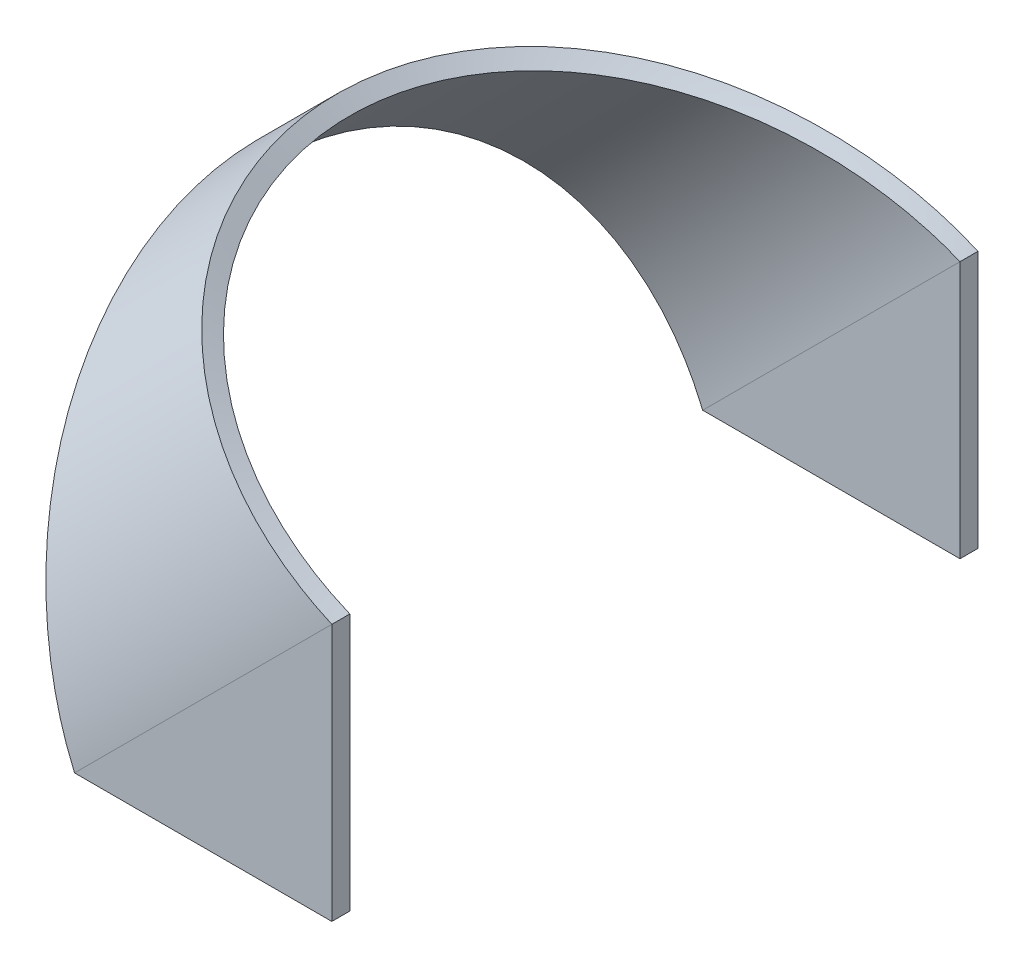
ISO-10303-21;
HEADER;
FILE_DESCRIPTION(('STEP AP214'),'2;1');
FILE_NAME('part.step','',(''),(''),'','','');
FILE_SCHEMA(('AUTOMOTIVE_DESIGN { 1 0 10303 214 1 1 1 1 }'));
ENDSEC;
DATA;
#1=APPLICATION_CONTEXT('core data for automotive mechanical design processes');
#2=APPLICATION_PROTOCOL_DEFINITION('international standard','automotive_design',2000,#1);
#3=PRODUCT_CONTEXT('',#1,'mechanical');
#4=PRODUCT('Part','Part','',(#3));
#5=PRODUCT_RELATED_PRODUCT_CATEGORY('part','',(#4));
#6=PRODUCT_DEFINITION_FORMATION('','',#4);
#7=PRODUCT_DEFINITION_CONTEXT('part definition',#1,'design');
#8=PRODUCT_DEFINITION('design','',#6,#7);
#9=PRODUCT_DEFINITION_SHAPE('','',#8);
#10=(LENGTH_UNIT() NAMED_UNIT(*) SI_UNIT(.MILLI.,.METRE.));
#11=(NAMED_UNIT(*) PLANE_ANGLE_UNIT() SI_UNIT($,.RADIAN.));
#12=(NAMED_UNIT(*) SI_UNIT($,.STERADIAN.) SOLID_ANGLE_UNIT());
#13=UNCERTAINTY_MEASURE_WITH_UNIT(LENGTH_MEASURE(1.E-05),#10,'distance_accuracy_value','');
#14=(GEOMETRIC_REPRESENTATION_CONTEXT(3) GLOBAL_UNCERTAINTY_ASSIGNED_CONTEXT((#13)) GLOBAL_UNIT_ASSIGNED_CONTEXT((#10,
#11,#12)) REPRESENTATION_CONTEXT('',''));
#15=CARTESIAN_POINT('',(0.,0.,0.));
#16=DIRECTION('',(0.,0.,1.));
#17=DIRECTION('',(1.,0.,0.));
#18=AXIS2_PLACEMENT_3D('',#15,#16,#17);
#19=CARTESIAN_POINT('',(-14.3061626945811,0.,23.5009137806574));
#20=DIRECTION('',(0.,1.,0.));
#21=DIRECTION('',(1.,0.,0.));
#22=AXIS2_PLACEMENT_3D('',#19,#20,#21);
#23=PLANE('',#22);
#24=CARTESIAN_POINT('',(-14.306162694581,0.,-17.9630248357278));
#25=CARTESIAN_POINT('',(-14.306162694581,0.,-16.9630248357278));
#26=B_SPLINE_CURVE_WITH_KNOTS('',1,(#24,#25),.UNSPECIFIED.,.F.,.F.,(2,2),(0.,1.),.UNSPECIFIED.);
#27=CARTESIAN_POINT('',(-14.306162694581,0.,-16.9630248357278));
#28=VERTEX_POINT('',#27);
#29=CARTESIAN_POINT('',(-14.3061626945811,0.,-17.9630248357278));
#30=VERTEX_POINT('',#29);
#31=EDGE_CURVE('E287',#28,#30,#26,.F.);
#32=ORIENTED_EDGE('',*,*,#31,.T.);
#33=DIRECTION('',(1.,0.,0.));
#34=VECTOR('',#33,1.);
#35=CARTESIAN_POINT('',(-14.3061626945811,0.,-17.9630248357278));
#36=LINE('',#35,#34);
#37=CARTESIAN_POINT('',(0.,0.,-17.9630248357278));
#38=VERTEX_POINT('',#37);
#39=EDGE_CURVE('E294',#30,#38,#36,.T.);
#40=ORIENTED_EDGE('',*,*,#39,.T.);
#41=DIRECTION('',(0.,0.,-1.));
#42=VECTOR('',#41,1.);
#43=CARTESIAN_POINT('',(0.,0.,23.5009137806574));
#44=LINE('',#43,#42);
#45=CARTESIAN_POINT('',(0.,0.,-16.9630248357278));
#46=VERTEX_POINT('',#45);
#47=EDGE_CURVE('E293',#46,#38,#44,.T.);
#48=ORIENTED_EDGE('',*,*,#47,.F.);
#49=DIRECTION('',(1.,0.,0.));
#50=VECTOR('',#49,1.);
#51=CARTESIAN_POINT('',(-14.3061626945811,0.,-16.9630248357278));
#52=LINE('',#51,#50);
#53=EDGE_CURVE('E13',#28,#46,#52,.T.);
#54=ORIENTED_EDGE('',*,*,#53,.F.);
#55=EDGE_LOOP('',(#32,#40,#48,#54));
#56=FACE_BOUND('',#55,.T.);
#57=ADVANCED_FACE('F37',(#56),#23,.F.);
#58=CARTESIAN_POINT('',(0.,0.,-17.9630248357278));
#59=DIRECTION('',(0.,0.,1.));
#60=DIRECTION('',(-1.,0.,0.));
#61=AXIS2_PLACEMENT_3D('',#58,#59,#60);
#62=PLANE('',#61);
#63=DIRECTION('',(0.,1.,0.));
#64=VECTOR('',#63,1.);
#65=CARTESIAN_POINT('',(0.,0.,-17.9630248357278));
#66=LINE('',#65,#64);
#67=CARTESIAN_POINT('',(0.,14.3061626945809,-17.9630248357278));
#68=VERTEX_POINT('',#67);
#69=EDGE_CURVE('E279',#38,#68,#66,.T.);
#70=ORIENTED_EDGE('',*,*,#69,.F.);
#71=ORIENTED_EDGE('',*,*,#39,.F.);
#72=DIRECTION('',(0.707106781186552,0.707106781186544,0.));
#73=VECTOR('',#72,1.);
#74=CARTESIAN_POINT('',(0.,14.3061626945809,-17.9630248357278));
#75=LINE('',#74,#73);
#76=EDGE_CURVE('E126',#30,#68,#75,.T.);
#77=ORIENTED_EDGE('',*,*,#76,.T.);
#78=EDGE_LOOP('',(#70,#71,#77));
#79=FACE_BOUND('',#78,.T.);
#80=ADVANCED_FACE('F256',(#79),#62,.F.);
#81=CARTESIAN_POINT('',(0.,0.,23.5009137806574));
#82=DIRECTION('',(-1.,0.,0.));
#83=DIRECTION('',(0.,1.,0.));
#84=AXIS2_PLACEMENT_3D('',#81,#82,#83);
#85=PLANE('',#84);
#86=ORIENTED_EDGE('',*,*,#47,.T.);
#87=ORIENTED_EDGE('',*,*,#69,.T.);
#88=CARTESIAN_POINT('',(1.01308428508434E-13,14.3061626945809,-16.9630248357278));
#89=CARTESIAN_POINT('',(1.06217147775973E-13,14.3061626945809,-17.9630248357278));
#90=B_SPLINE_CURVE_WITH_KNOTS('',1,(#88,#89),.UNSPECIFIED.,.F.,.F.,(2,2),(0.,1.),.UNSPECIFIED.);
#91=CARTESIAN_POINT('',(1.01308428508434E-13,14.3061626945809,-16.9630248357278));
#92=VERTEX_POINT('',#91);
#93=EDGE_CURVE('E274',#92,#68,#90,.T.);
#94=ORIENTED_EDGE('',*,*,#93,.F.);
#95=DIRECTION('',(0.,1.,0.));
#96=VECTOR('',#95,1.);
#97=CARTESIAN_POINT('',(0.,0.,-16.9630248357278));
#98=LINE('',#97,#96);
#99=EDGE_CURVE('E48',#46,#92,#98,.T.);
#100=ORIENTED_EDGE('',*,*,#99,.F.);
#101=EDGE_LOOP('',(#86,#87,#94,#100));
#102=FACE_BOUND('',#101,.T.);
#103=ADVANCED_FACE('F286',(#102),#85,.F.);
#104=CARTESIAN_POINT('',(0.,0.,-16.9630248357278));
#105=DIRECTION('',(0.,0.,1.));
#106=DIRECTION('',(-1.,0.,0.));
#107=AXIS2_PLACEMENT_3D('',#104,#105,#106);
#108=PLANE('',#107);
#109=ORIENTED_EDGE('',*,*,#99,.T.);
#110=DIRECTION('',(0.707106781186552,0.707106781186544,0.));
#111=VECTOR('',#110,1.);
#112=CARTESIAN_POINT('',(-14.3061626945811,0.,-16.9630248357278));
#113=LINE('',#112,#111);
#114=EDGE_CURVE('E272',#28,#92,#113,.T.);
#115=ORIENTED_EDGE('',*,*,#114,.F.);
#116=ORIENTED_EDGE('',*,*,#53,.T.);
#117=EDGE_LOOP('',(#109,#115,#116));
#118=FACE_BOUND('',#117,.T.);
#119=ADVANCED_FACE('F39',(#118),#108,.T.);
#120=CARTESIAN_POINT('',(0.,0.,16.9630248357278));
#121=DIRECTION('',(0.,0.,-1.));
#122=DIRECTION('',(-1.,0.,0.));
#123=AXIS2_PLACEMENT_3D('',#120,#121,#122);
#124=PLANE('',#123);
#125=DIRECTION('',(0.,1.,0.));
#126=VECTOR('',#125,1.);
#127=CARTESIAN_POINT('',(0.,0.,16.9630248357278));
#128=LINE('',#127,#126);
#129=CARTESIAN_POINT('',(0.,0.,16.9630248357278));
#130=VERTEX_POINT('',#129);
#131=CARTESIAN_POINT('',(0.,14.3061626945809,16.9630248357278));
#132=VERTEX_POINT('',#131);
#133=EDGE_CURVE('E104',#130,#132,#128,.T.);
#134=ORIENTED_EDGE('',*,*,#133,.F.);
#135=DIRECTION('',(1.,0.,0.));
#136=VECTOR('',#135,1.);
#137=CARTESIAN_POINT('',(-14.3061626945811,0.,16.9630248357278));
#138=LINE('',#137,#136);
#139=CARTESIAN_POINT('',(-14.3061626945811,0.,16.9630248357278));
#140=VERTEX_POINT('',#139);
#141=EDGE_CURVE('E224',#140,#130,#138,.T.);
#142=ORIENTED_EDGE('',*,*,#141,.F.);
#143=DIRECTION('',(0.707106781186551,0.707106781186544,0.));
#144=VECTOR('',#143,1.);
#145=CARTESIAN_POINT('',(-14.3061626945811,0.,16.9630248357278));
#146=LINE('',#145,#144);
#147=EDGE_CURVE('E223',#132,#140,#146,.F.);
#148=ORIENTED_EDGE('',*,*,#147,.F.);
#149=EDGE_LOOP('',(#134,#142,#148));
#150=FACE_BOUND('',#149,.T.);
#151=ADVANCED_FACE('F250',(#150),#124,.T.);
#152=CARTESIAN_POINT('',(0.,0.,-23.5009137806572));
#153=DIRECTION('',(1.,0.,0.));
#154=DIRECTION('',(0.,1.,0.));
#155=AXIS2_PLACEMENT_3D('',#152,#153,#154);
#156=PLANE('',#155);
#157=DIRECTION('',(0.,1.,0.));
#158=VECTOR('',#157,1.);
#159=CARTESIAN_POINT('',(0.,0.,17.9630248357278));
#160=LINE('',#159,#158);
#161=CARTESIAN_POINT('',(0.,0.,17.9630248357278));
#162=VERTEX_POINT('',#161);
#163=CARTESIAN_POINT('',(0.,14.3061626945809,17.9630248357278));
#164=VERTEX_POINT('',#163);
#165=EDGE_CURVE('E108',#162,#164,#160,.T.);
#166=ORIENTED_EDGE('',*,*,#165,.F.);
#167=DIRECTION('',(0.,0.,1.));
#168=VECTOR('',#167,1.);
#169=CARTESIAN_POINT('',(0.,0.,-23.5009137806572));
#170=LINE('',#169,#168);
#171=EDGE_CURVE('E101',#130,#162,#170,.T.);
#172=ORIENTED_EDGE('',*,*,#171,.F.);
#173=ORIENTED_EDGE('',*,*,#133,.T.);
#174=CARTESIAN_POINT('',(0.,14.306162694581,17.9630248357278));
#175=CARTESIAN_POINT('',(0.,14.306162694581,16.9630248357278));
#176=B_SPLINE_CURVE_WITH_KNOTS('',1,(#174,#175),.UNSPECIFIED.,.F.,.F.,(2,2),(0.,1.),.UNSPECIFIED.);
#177=EDGE_CURVE('E120',#132,#164,#176,.F.);
#178=ORIENTED_EDGE('',*,*,#177,.T.);
#179=EDGE_LOOP('',(#166,#172,#173,#178));
#180=FACE_BOUND('',#179,.T.);
#181=ADVANCED_FACE('F240',(#180),#156,.T.);
#182=CARTESIAN_POINT('',(-14.3061626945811,0.,-23.5009137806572));
#183=DIRECTION('',(0.,-1.,0.));
#184=DIRECTION('',(0.,0.,-1.));
#185=AXIS2_PLACEMENT_3D('',#182,#183,#184);
#186=PLANE('',#185);
#187=DIRECTION('',(1.,0.,0.));
#188=VECTOR('',#187,1.);
#189=CARTESIAN_POINT('',(-14.3061626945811,0.,17.9630248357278));
#190=LINE('',#189,#188);
#191=CARTESIAN_POINT('',(-14.3061626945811,0.,17.9630248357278));
#192=VERTEX_POINT('',#191);
#193=EDGE_CURVE('E92',#192,#162,#190,.T.);
#194=ORIENTED_EDGE('',*,*,#193,.F.);
#195=CARTESIAN_POINT('',(-14.3061626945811,0.,16.9630248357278));
#196=CARTESIAN_POINT('',(-14.3061626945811,0.,17.9630248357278));
#197=B_SPLINE_CURVE_WITH_KNOTS('',1,(#195,#196),.UNSPECIFIED.,.F.,.F.,(2,2),(0.,1.),.UNSPECIFIED.);
#198=EDGE_CURVE('E97',#140,#192,#197,.T.);
#199=ORIENTED_EDGE('',*,*,#198,.F.);
#200=ORIENTED_EDGE('',*,*,#141,.T.);
#201=ORIENTED_EDGE('',*,*,#171,.T.);
#202=EDGE_LOOP('',(#194,#199,#200,#201));
#203=FACE_BOUND('',#202,.T.);
#204=ADVANCED_FACE('F94',(#203),#186,.T.);
#205=CARTESIAN_POINT('',(0.,0.,17.9630248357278));
#206=DIRECTION('',(0.,0.,-1.));
#207=DIRECTION('',(-1.,0.,0.));
#208=AXIS2_PLACEMENT_3D('',#205,#206,#207);
#209=PLANE('',#208);
#210=ORIENTED_EDGE('',*,*,#165,.T.);
#211=DIRECTION('',(0.707106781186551,0.707106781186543,0.));
#212=VECTOR('',#211,1.);
#213=CARTESIAN_POINT('',(0.,14.3061626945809,17.9630248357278));
#214=LINE('',#213,#212);
#215=EDGE_CURVE('E105',#192,#164,#214,.T.);
#216=ORIENTED_EDGE('',*,*,#215,.F.);
#217=ORIENTED_EDGE('',*,*,#193,.T.);
#218=EDGE_LOOP('',(#210,#216,#217));
#219=FACE_BOUND('',#218,.T.);
#220=ADVANCED_FACE('F107',(#219),#209,.F.);
#221=CARTESIAN_POINT('',(1.06217147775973E-13,14.3061626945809,-17.9630248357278));
#222=CARTESIAN_POINT('',(-0.742959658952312,14.6313279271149,-17.9630248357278));
#223=CARTESIAN_POINT('',(-1.39177251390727,14.9157274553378,-17.9161414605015));
#224=CARTESIAN_POINT('',(-2.2221188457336,15.2790887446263,-17.8226328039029));
#225=CARTESIAN_POINT('',(-2.47512090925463,15.3897258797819,-17.7874609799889));
#226=CARTESIAN_POINT('',(-2.81912638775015,15.5401290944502,-17.7333129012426));
#227=CARTESIAN_POINT('',(-2.92788084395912,15.5876736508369,-17.7150227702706));
#228=CARTESIAN_POINT('',(-3.08217800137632,15.6551422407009,-17.6877216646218));
#229=CARTESIAN_POINT('',(-3.13213804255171,15.6769904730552,-17.6786430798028));
#230=CARTESIAN_POINT('',(-3.20487470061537,15.7088059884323,-17.6651147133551));
#231=CARTESIAN_POINT('',(-3.22875302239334,15.7192516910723,-17.660620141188));
#232=CARTESIAN_POINT('',(-3.26402032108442,15.7346817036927,-17.6539073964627));
#233=CARTESIAN_POINT('',(-3.27568439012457,15.739785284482,-17.6516746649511));
#234=CARTESIAN_POINT('',(-3.29304303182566,15.7473811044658,-17.6483336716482));
#235=CARTESIAN_POINT('',(-3.29880633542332,15.7499031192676,-17.6472213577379));
#236=CARTESIAN_POINT('',(-3.30741693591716,15.7536712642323,-17.6455550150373));
#237=CARTESIAN_POINT('',(-3.31028141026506,15.7549248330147,-17.644999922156));
#238=CARTESIAN_POINT('',(-3.31456953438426,15.7568014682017,-17.6441678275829));
#239=CARTESIAN_POINT('',(-3.31599747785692,15.7574263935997,-17.6438905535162));
#240=CARTESIAN_POINT('',(-3.31885050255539,15.7586750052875,-17.6433361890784));
#241=CARTESIAN_POINT('',(-3.31933625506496,15.7588875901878,-17.6432418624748));
#242=CARTESIAN_POINT('',(-3.92662183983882,16.0246688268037,-17.5250832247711));
#243=CARTESIAN_POINT('',(-4.49767672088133,16.2747811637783,-17.3806679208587));
#244=CARTESIAN_POINT('',(-5.30253449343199,16.6270746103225,-17.137466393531));
#245=CARTESIAN_POINT('',(-5.56221705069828,16.7407106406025,-17.0519554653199));
#246=CARTESIAN_POINT('',(-5.93885802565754,16.9054941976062,-16.9185750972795));
#247=CARTESIAN_POINT('',(-6.06225872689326,16.9594778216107,-16.8732616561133));
#248=CARTESIAN_POINT('',(-6.24415023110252,17.0390468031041,-16.8041963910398));
#249=CARTESIAN_POINT('',(-6.30424585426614,17.0653354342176,-16.7809920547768));
#250=CARTESIAN_POINT('',(-6.39358860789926,17.1044184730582,-16.745934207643));
#251=CARTESIAN_POINT('',(-6.42323608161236,17.1173878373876,-16.7342063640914));
#252=CARTESIAN_POINT('',(-6.46750735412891,17.1367546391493,-16.7165545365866));
#253=CARTESIAN_POINT('',(-6.48223112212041,17.1431956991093,-16.7106605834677));
#254=CARTESIAN_POINT('',(-6.50426681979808,17.1528355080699,-16.7018049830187));
#255=CARTESIAN_POINT('',(-6.51160372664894,17.1560451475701,-16.6988506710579));
#256=CARTESIAN_POINT('',(-6.52259660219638,17.1608541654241,-16.6944155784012));
#257=CARTESIAN_POINT('',(-6.52625881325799,17.1624562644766,-16.692936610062));
#258=CARTESIAN_POINT('',(-6.53357907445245,17.1656586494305,-16.6899774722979));
#259=CARTESIAN_POINT('',(-6.53656191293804,17.1669635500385,-16.6887707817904));
#260=CARTESIAN_POINT('',(-7.09528434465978,17.4113882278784,-16.4624731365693));
#261=CARTESIAN_POINT('',(-7.62367704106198,17.642734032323,-16.2153306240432));
#262=CARTESIAN_POINT('',(-8.37658018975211,17.972288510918,-15.8189579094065));
#263=CARTESIAN_POINT('',(-8.62094325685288,18.0792389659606,-15.6825516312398));
#264=CARTESIAN_POINT('',(-8.97757504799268,18.2353072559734,-15.4724937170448));
#265=CARTESIAN_POINT('',(-9.09480069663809,18.2866043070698,-15.4015659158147));
#266=CARTESIAN_POINT('',(-9.26816548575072,18.3624650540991,-15.2939294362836));
#267=CARTESIAN_POINT('',(-9.32554149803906,18.387571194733,-15.2578431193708));
#268=CARTESIAN_POINT('',(-9.41098787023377,18.4249599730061,-15.2034169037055));
#269=CARTESIAN_POINT('',(-9.43936705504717,18.4373778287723,-15.1852253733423));
#270=CARTESIAN_POINT('',(-9.48178153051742,18.4559371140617,-15.1578656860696));
#271=CARTESIAN_POINT('',(-9.49589397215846,18.4621122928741,-15.1487337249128));
#272=CARTESIAN_POINT('',(-9.51702407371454,18.4713582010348,-15.1350179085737));
#273=CARTESIAN_POINT('',(-9.52406101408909,18.4744373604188,-15.1304429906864));
#274=CARTESIAN_POINT('',(-9.53812204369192,18.4805900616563,-15.1212872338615));
#275=CARTESIAN_POINT('',(-9.54434507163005,18.4833130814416,-15.117229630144));
#276=CARTESIAN_POINT('',(-10.0525622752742,18.705694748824,-14.7852735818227));
#277=CARTESIAN_POINT('',(-10.5273768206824,18.9135776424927,-14.4387823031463));
#278=CARTESIAN_POINT('',(-11.200749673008,19.2083126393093,-13.896163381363));
#279=CARTESIAN_POINT('',(-11.418739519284,19.3037164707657,-13.7114729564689));
#280=CARTESIAN_POINT('',(-11.7360229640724,19.4425607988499,-13.4294958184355));
#281=CARTESIAN_POINT('',(-11.8401676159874,19.4881323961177,-13.3346795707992));
#282=CARTESIAN_POINT('',(-11.993963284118,19.5554284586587,-13.1913148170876));
#283=CARTESIAN_POINT('',(-12.0448249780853,19.5776836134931,-13.1433364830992));
#284=CARTESIAN_POINT('',(-12.1205128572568,19.6108016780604,-13.0710956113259));
#285=CARTESIAN_POINT('',(-12.1456413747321,19.6217969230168,-13.0469697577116));
#286=CARTESIAN_POINT('',(-12.1831830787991,19.6382237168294,-13.0107140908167));
#287=CARTESIAN_POINT('',(-12.1956718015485,19.6436883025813,-12.9986177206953));
#288=CARTESIAN_POINT('',(-12.2143671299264,19.6518686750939,-12.9804566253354));
#289=CARTESIAN_POINT('',(-12.2205926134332,19.6545927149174,-12.974400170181));
#290=CARTESIAN_POINT('',(-12.2330309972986,19.6600352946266,-12.9622817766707));
#291=CARTESIAN_POINT('',(-12.2385491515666,19.6624498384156,-12.9568986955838));
#292=CARTESIAN_POINT('',(-13.1288240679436,20.0520023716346,-12.0869843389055));
#293=CARTESIAN_POINT('',(-13.9035097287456,20.3917568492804,-11.1493359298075));
#294=CARTESIAN_POINT('',(-14.8985486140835,20.8272634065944,-9.67597356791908));
#295=CARTESIAN_POINT('',(-15.2024835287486,20.9601649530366,-9.17367090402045));
#296=CARTESIAN_POINT('',(-15.6169840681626,21.1413315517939,-8.40865127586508));
#297=CARTESIAN_POINT('',(-15.7482551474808,21.1986940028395,-8.15171387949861));
#298=CARTESIAN_POINT('',(-15.9348835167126,21.2802634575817,-7.76403096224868));
#299=CARTESIAN_POINT('',(-15.9953801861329,21.3067078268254,-7.63442362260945));
#300=CARTESIAN_POINT('',(-16.0835664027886,21.345266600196,-7.43951836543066));
#301=CARTESIAN_POINT('',(-16.1125353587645,21.3579349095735,-7.37446755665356));
#302=CARTESIAN_POINT('',(-16.1553505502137,21.3766618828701,-7.27677703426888));
#303=CARTESIAN_POINT('',(-16.1695159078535,21.3828582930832,-7.24419447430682));
#304=CARTESIAN_POINT('',(-16.1906045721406,21.3920842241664,-7.19529320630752));
#305=CARTESIAN_POINT('',(-16.1976075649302,21.3951480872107,-7.17898821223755));
#306=CARTESIAN_POINT('',(-16.208072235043,21.3997267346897,-7.15452400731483));
#307=CARTESIAN_POINT('',(-16.2115538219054,21.4012500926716,-7.14636815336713));
#308=CARTESIAN_POINT('',(-16.2185037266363,21.4042910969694,-7.13005423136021));
#309=CARTESIAN_POINT('',(-16.2216718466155,21.4056773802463,-7.12260372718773));
#310=CARTESIAN_POINT('',(-16.7069547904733,21.6180314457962,-5.9787959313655));
#311=CARTESIAN_POINT('',(-17.0690860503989,21.7770530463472,-4.80115334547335));
#312=CARTESIAN_POINT('',(-17.5506628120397,21.9878174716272,-2.41275131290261));
#313=CARTESIAN_POINT('',(-17.6701320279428,22.0395840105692,-1.2020282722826));
#314=CARTESIAN_POINT('',(-17.6701312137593,22.0395848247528,1.20202827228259));
#315=CARTESIAN_POINT('',(-17.5506670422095,21.9878236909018,2.41269503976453));
#316=CARTESIAN_POINT('',(-17.1894900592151,21.8297545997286,4.20399303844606));
#317=CARTESIAN_POINT('',(-17.0388235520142,21.7637162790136,4.796948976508));
#318=CARTESIAN_POINT('',(-16.7675920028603,21.6448153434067,5.6752904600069));
#319=CARTESIAN_POINT('',(-16.6696466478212,21.6018782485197,5.9662214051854));
#320=CARTESIAN_POINT('',(-16.5114835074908,21.532574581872,6.39922883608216));
#321=CARTESIAN_POINT('',(-16.4568885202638,21.5086572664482,6.54299979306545));
#322=CARTESIAN_POINT('',(-16.3721944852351,21.4715665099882,6.75773199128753));
#323=CARTESIAN_POINT('',(-16.3434962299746,21.4590004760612,6.82915535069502));
#324=CARTESIAN_POINT('',(-16.299749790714,21.4398490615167,6.93604970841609));
#325=CARTESIAN_POINT('',(-16.2850511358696,21.4334148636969,6.97164104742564));
#326=CARTESIAN_POINT('',(-16.2628285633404,21.4236881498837,7.02496668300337));
#327=CARTESIAN_POINT('',(-16.2553919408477,21.4204333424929,7.04273166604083));
#328=CARTESIAN_POINT('',(-16.2441933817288,21.4155322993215,7.06936364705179));
#329=CARTESIAN_POINT('',(-16.2404532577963,21.4138954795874,7.07823839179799));
#330=CARTESIAN_POINT('',(-16.2329584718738,21.410615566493,7.09598269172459));
#331=CARTESIAN_POINT('',(-16.2289029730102,21.408840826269,7.10556132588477));
#332=CARTESIAN_POINT('',(-15.7824220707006,21.2134598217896,8.15792641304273));
#333=CARTESIAN_POINT('',(-15.2303726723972,20.9724982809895,9.18460184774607));
#334=CARTESIAN_POINT('',(-14.2353504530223,20.537009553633,10.6579799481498));
#335=CARTESIAN_POINT('',(-13.87591697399,20.3795708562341,11.1379404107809));
#336=CARTESIAN_POINT('',(-13.2953641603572,20.1252356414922,11.8356334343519));
#337=CARTESIAN_POINT('',(-13.0949511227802,20.0374327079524,12.0644870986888));
#338=CARTESIAN_POINT('',(-12.7840651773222,19.9012682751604,12.4014928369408));
#339=CARTESIAN_POINT('',(-12.6787258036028,19.8551371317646,12.5127821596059));
#340=CARTESIAN_POINT('',(-12.5181633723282,19.7848386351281,12.6780576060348));
#341=CARTESIAN_POINT('',(-12.4642170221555,19.7612221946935,12.732872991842));
#342=CARTESIAN_POINT('',(-12.3826609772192,19.7255239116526,12.8146701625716));
#343=CARTESIAN_POINT('',(-12.355369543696,19.7135788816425,12.8418649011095));
#344=CARTESIAN_POINT('',(-12.3142735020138,19.695593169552,12.8825491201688));
#345=CARTESIAN_POINT('',(-12.3005483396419,19.6895865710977,12.8960925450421));
#346=CARTESIAN_POINT('',(-12.2799209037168,19.6805596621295,12.9163805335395));
#347=CARTESIAN_POINT('',(-12.2730384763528,19.6775478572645,12.9231386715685));
#348=CARTESIAN_POINT('',(-12.2592603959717,19.6715185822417,12.9366458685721));
#349=CARTESIAN_POINT('',(-12.2516614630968,19.6681933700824,12.944082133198));
#350=CARTESIAN_POINT('',(-11.84872754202,19.4918770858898,13.3378065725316));
#351=CARTESIAN_POINT('',(-11.4259839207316,19.3069119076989,13.7146128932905));
#352=CARTESIAN_POINT('',(-10.7526388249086,19.0122053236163,14.2572657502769));
#353=CARTESIAN_POINT('',(-10.5216581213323,18.9110992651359,14.4343854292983));
#354=CARTESIAN_POINT('',(-10.1654191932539,18.7551650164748,14.6935918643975));
#355=CARTESIAN_POINT('',(-10.0450453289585,18.7024748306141,14.7789148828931));
#356=CARTESIAN_POINT('',(-9.86205097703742,18.6223791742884,14.9051750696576));
#357=CARTESIAN_POINT('',(-9.80064729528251,18.5955039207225,14.9469743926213));
#358=CARTESIAN_POINT('',(-9.70793465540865,18.5549272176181,15.0092289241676));
#359=CARTESIAN_POINT('',(-9.67692925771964,18.5413576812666,15.0299063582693));
#360=CARTESIAN_POINT('',(-9.63026955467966,18.5209375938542,15.0608097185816));
#361=CARTESIAN_POINT('',(-9.61469105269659,18.5141199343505,15.071092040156));
#362=CARTESIAN_POINT('',(-9.59128542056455,18.5038770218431,15.0864871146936));
#363=CARTESIAN_POINT('',(-9.5834772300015,18.5004599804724,15.0916140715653));
#364=CARTESIAN_POINT('',(-9.56784822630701,18.4936204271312,15.1018584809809));
#365=CARTESIAN_POINT('',(-9.55920677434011,18.4898387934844,15.1075119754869));
#366=CARTESIAN_POINT('',(-9.10378533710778,18.2905407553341,15.4049936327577));
#367=CARTESIAN_POINT('',(-8.62868490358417,18.082647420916,15.6861837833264));
#368=CARTESIAN_POINT('',(-7.8757960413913,17.7531052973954,16.0826182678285));
#369=CARTESIAN_POINT('',(-7.61813448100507,17.640315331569,16.2105305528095));
#370=CARTESIAN_POINT('',(-7.22164496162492,17.4667672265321,16.3950157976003));
#371=CARTESIAN_POINT('',(-7.08781616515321,17.408191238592,16.4552799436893));
#372=CARTESIAN_POINT('',(-6.8845862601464,17.3192490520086,16.5436970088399));
#373=CARTESIAN_POINT('',(-6.81642854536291,17.2894219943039,16.5728394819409));
#374=CARTESIAN_POINT('',(-6.71357217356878,17.2444137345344,16.6160415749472));
#375=CARTESIAN_POINT('',(-6.6791834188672,17.2293663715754,16.6303570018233));
#376=CARTESIAN_POINT('',(-6.62744559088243,17.2067286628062,16.6517001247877));
#377=CARTESIAN_POINT('',(-6.61017386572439,17.1991716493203,16.6587928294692));
#378=CARTESIAN_POINT('',(-6.58422763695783,17.1878194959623,16.6693991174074));
#379=CARTESIAN_POINT('',(-6.57557245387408,17.1840326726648,16.6729290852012));
#380=CARTESIAN_POINT('',(-6.56258002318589,17.1783482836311,16.6782158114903));
#381=CARTESIAN_POINT('',(-6.55824760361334,17.1764527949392,16.6799766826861));
#382=CARTESIAN_POINT('',(-6.5495795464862,17.1726604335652,16.6834956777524));
#383=CARTESIAN_POINT('',(-6.54456317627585,17.1704657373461,16.6855295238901));
#384=CARTESIAN_POINT('',(-6.07287293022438,16.9640991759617,16.8765817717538));
#385=CARTESIAN_POINT('',(-5.57072711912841,16.7444416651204,17.0564362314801));
#386=CARTESIAN_POINT('',(-4.76586625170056,16.3921453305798,17.2996331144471));
#387=CARTESIAN_POINT('',(-4.48898411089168,16.2709233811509,17.3762515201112));
#388=CARTESIAN_POINT('',(-4.06083382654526,16.0834714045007,17.4828665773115));
#389=CARTESIAN_POINT('',(-3.91598018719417,16.0200518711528,17.5170185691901));
#390=CARTESIAN_POINT('',(-3.69551193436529,15.9235367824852,17.5659537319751));
#391=CARTESIAN_POINT('',(-3.62149128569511,15.8911341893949,17.5818832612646));
#392=CARTESIAN_POINT('',(-3.50966628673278,15.8421867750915,17.6051771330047));
#393=CARTESIAN_POINT('',(-3.47225895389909,15.8258137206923,17.6128416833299));
#394=CARTESIAN_POINT('',(-3.41594984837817,15.8011686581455,17.6241849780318));
#395=CARTESIAN_POINT('',(-3.39714712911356,15.7929393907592,17.6279404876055));
#396=CARTESIAN_POINT('',(-3.36889357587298,15.7805741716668,17.6335349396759));
#397=CARTESIAN_POINT('',(-3.35946747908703,15.7764488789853,17.6353932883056));
#398=CARTESIAN_POINT('',(-3.34531597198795,15.7702556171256,17.6381710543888));
#399=CARTESIAN_POINT('',(-3.34059674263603,15.7681903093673,17.6390953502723));
#400=CARTESIAN_POINT('',(-3.33351480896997,15.7650910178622,17.640479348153));
#401=CARTESIAN_POINT('',(-3.33115364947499,15.7640576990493,17.6409402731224));
#402=CARTESIAN_POINT('',(-3.32643030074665,15.7619906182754,17.6418613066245));
#403=CARTESIAN_POINT('',(-3.32313439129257,15.7605482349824,17.6425030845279));
#404=CARTESIAN_POINT('',(-2.95588555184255,15.5998301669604,17.7139568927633));
#405=CARTESIAN_POINT('',(-2.49684616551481,15.3993164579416,17.7917607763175));
#406=CARTESIAN_POINT('',(-1.38970532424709,14.9148240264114,17.9163072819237));
#407=CARTESIAN_POINT('',(-0.741577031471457,14.6307223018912,17.9630248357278));
#408=CARTESIAN_POINT('',(0.,14.306162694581,17.9630248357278));
#409=CARTESIAN_POINT('',(1.01308428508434E-13,14.3061626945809,-16.9630248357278));
#410=CARTESIAN_POINT('',(-0.71322582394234,14.6015956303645,-16.9630248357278));
#411=CARTESIAN_POINT('',(-1.33606537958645,14.860020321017,-16.9187514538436));
#412=CARTESIAN_POINT('',(-2.13318491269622,15.1901548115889,-16.8304484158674));
#413=CARTESIAN_POINT('',(-2.37606509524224,15.2906700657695,-16.7972346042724));
#414=CARTESIAN_POINT('',(-2.70630872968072,15.4273114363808,-16.7461009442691));
#415=CARTESIAN_POINT('',(-2.81071260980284,15.4705054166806,-16.7288290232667));
#416=CARTESIAN_POINT('',(-2.95883692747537,15.5318011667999,-16.7030477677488));
#417=CARTESIAN_POINT('',(-3.00679818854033,15.5516506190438,-16.6944745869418));
#418=CARTESIAN_POINT('',(-3.07662464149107,15.580555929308,-16.6816993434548));
#419=CARTESIAN_POINT('',(-3.09954755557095,15.5900462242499,-16.6774549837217));
#420=CARTESIAN_POINT('',(-3.1334036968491,15.6040650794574,-16.6711159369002));
#421=CARTESIAN_POINT('',(-3.14460103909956,15.608701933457,-16.6690075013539));
#422=CARTESIAN_POINT('',(-3.16126507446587,15.615603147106,-16.6658525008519));
#423=CARTESIAN_POINT('',(-3.16679775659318,15.6178945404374,-16.6648021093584));
#424=CARTESIAN_POINT('',(-3.17506379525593,15.6213181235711,-16.6632285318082));
#425=CARTESIAN_POINT('',(-3.17781364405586,15.6224570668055,-16.6627043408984));
#426=CARTESIAN_POINT('',(-3.18193017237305,15.6241621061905,-16.6619185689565));
#427=CARTESIAN_POINT('',(-3.1833009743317,15.6247298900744,-16.6616567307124));
#428=CARTESIAN_POINT('',(-3.18603983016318,15.6258643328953,-16.6611332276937));
#429=CARTESIAN_POINT('',(-3.1865061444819,15.6260574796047,-16.6610441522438));
#430=CARTESIAN_POINT('',(-3.76948995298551,15.8675369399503,-16.5494633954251));
#431=CARTESIAN_POINT('',(-4.31768768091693,16.0947921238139,-16.4130876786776));
#432=CARTESIAN_POINT('',(-5.0903362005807,16.4148763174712,-16.183425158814));
#433=CARTESIAN_POINT('',(-5.33962745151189,16.5181210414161,-16.1026746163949));
#434=CARTESIAN_POINT('',(-5.70119789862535,16.667834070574,-15.9767195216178));
#435=CARTESIAN_POINT('',(-5.81966111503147,16.7168802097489,-15.9339286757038));
#436=CARTESIAN_POINT('',(-5.99427487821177,16.7891714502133,-15.8687082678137));
#437=CARTESIAN_POINT('',(-6.05196599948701,16.8130555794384,-15.8467957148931));
#438=CARTESIAN_POINT('',(-6.13773402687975,16.8485638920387,-15.813689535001));
#439=CARTESIAN_POINT('',(-6.16619526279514,16.8603470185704,-15.8026145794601));
#440=CARTESIAN_POINT('',(-6.20869517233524,16.8779424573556,-15.7859454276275));
#441=CARTESIAN_POINT('',(-6.22282981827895,16.8837943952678,-15.7803795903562));
#442=CARTESIAN_POINT('',(-6.24398382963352,16.8925525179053,-15.772016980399));
#443=CARTESIAN_POINT('',(-6.25102717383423,16.8954685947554,-15.7692271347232));
#444=CARTESIAN_POINT('',(-6.26158020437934,16.899837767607,-15.7650389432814));
#445=CARTESIAN_POINT('',(-6.26509588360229,16.9012933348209,-15.7636423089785));
#446=CARTESIAN_POINT('',(-6.27212324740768,16.9042028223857,-15.7608479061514));
#447=CARTESIAN_POINT('',(-6.27498673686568,16.9053883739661,-15.7597083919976));
#448=CARTESIAN_POINT('',(-6.81135360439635,17.127457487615,-15.5460087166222));
#449=CARTESIAN_POINT('',(-7.31859901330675,17.3376560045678,-15.3126246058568));
#450=CARTESIAN_POINT('',(-8.04137200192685,17.6370803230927,-14.9383179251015));
#451=CARTESIAN_POINT('',(-8.27595627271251,17.7342519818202,-14.8095053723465));
#452=CARTESIAN_POINT('',(-8.61831707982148,17.8760492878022,-14.6111413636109));
#453=CARTESIAN_POINT('',(-8.73085190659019,17.9226555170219,-14.5441621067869));
#454=CARTESIAN_POINT('',(-8.89727951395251,17.9915790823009,-14.4425177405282));
#455=CARTESIAN_POINT('',(-8.95235963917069,18.0143893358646,-14.4084403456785));
#456=CARTESIAN_POINT('',(-9.03438690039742,18.0483590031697,-14.3570440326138));
#457=CARTESIAN_POINT('',(-9.06163050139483,18.0596412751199,-14.3398652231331));
#458=CARTESIAN_POINT('',(-9.1023477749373,18.0765033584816,-14.3140286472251));
#459=CARTESIAN_POINT('',(-9.11589551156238,18.0821138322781,-14.3054050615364));
#460=CARTESIAN_POINT('',(-9.13618009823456,18.0905142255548,-14.2924528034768));
#461=CARTESIAN_POINT('',(-9.14293545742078,18.0933118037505,-14.2881325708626));
#462=CARTESIAN_POINT('',(-9.15643383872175,18.0989018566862,-14.2794865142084));
#463=CARTESIAN_POINT('',(-9.16240785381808,18.1013758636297,-14.2756547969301));
#464=CARTESIAN_POINT('',(-9.65028887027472,18.3034213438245,-13.9621787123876));
#465=CARTESIAN_POINT('',(-10.1061005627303,18.4923013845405,-13.6349765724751));
#466=CARTESIAN_POINT('',(-10.7525261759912,18.7600891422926,-13.1225651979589));
#467=CARTESIAN_POINT('',(-10.9617927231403,18.8467696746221,-12.9481564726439));
#468=CARTESIAN_POINT('',(-11.2663798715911,18.9729177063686,-12.6818769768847));
#469=CARTESIAN_POINT('',(-11.366357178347,19.0143219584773,-12.5923391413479));
#470=CARTESIAN_POINT('',(-11.5139987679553,19.075463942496,-12.4569554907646));
#471=CARTESIAN_POINT('',(-11.5628252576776,19.0956838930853,-12.4116481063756));
#472=CARTESIAN_POINT('',(-11.6354845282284,19.125773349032,-12.3434288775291));
#473=CARTESIAN_POINT('',(-11.6596075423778,19.1357630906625,-12.3206461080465));
#474=CARTESIAN_POINT('',(-11.6956470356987,19.150687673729,-12.2864087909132));
#475=CARTESIAN_POINT('',(-11.7076360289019,19.1556525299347,-12.2749858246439));
#476=CARTESIAN_POINT('',(-11.7255832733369,19.1630848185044,-12.2578357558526));
#477=CARTESIAN_POINT('',(-11.7315596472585,19.1655597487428,-12.2521164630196));
#478=CARTESIAN_POINT('',(-11.7435003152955,19.1705046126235,-12.2406726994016));
#479=CARTESIAN_POINT('',(-11.7487976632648,19.1726983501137,-12.2355892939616));
#480=CARTESIAN_POINT('',(-12.6034486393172,19.5266269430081,-11.4141029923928));
#481=CARTESIAN_POINT('',(-13.3471139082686,19.8353610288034,-10.5286533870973));
#482=CARTESIAN_POINT('',(-14.3023336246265,20.2310484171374,-9.13731297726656));
#483=CARTESIAN_POINT('',(-14.5941092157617,20.3517906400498,-8.66297345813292));
#484=CARTESIAN_POINT('',(-14.9920293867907,20.516376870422,-7.94054240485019));
#485=CARTESIAN_POINT('',(-15.1180498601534,20.5684887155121,-7.69790869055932));
#486=CARTESIAN_POINT('',(-15.2972129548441,20.6425928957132,-7.33180804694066));
#487=CARTESIAN_POINT('',(-15.3552896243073,20.6666172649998,-7.20941593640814));
#488=CARTESIAN_POINT('',(-15.4399478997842,20.7016480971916,-7.02536103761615));
#489=CARTESIAN_POINT('',(-15.4677578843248,20.7131574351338,-6.96393160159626));
#490=CARTESIAN_POINT('',(-15.5088600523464,20.7301713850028,-6.87167950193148));
#491=CARTESIAN_POINT('',(-15.5224586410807,20.7358010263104,-6.84091081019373));
#492=CARTESIAN_POINT('',(-15.5427034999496,20.7441831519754,-6.79473187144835));
#493=CARTESIAN_POINT('',(-15.5494262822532,20.7469668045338,-6.77933457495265));
#494=CARTESIAN_POINT('',(-15.5594722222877,20.7511267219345,-6.75623229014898));
#495=CARTESIAN_POINT('',(-15.5628144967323,20.7525107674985,-6.74853047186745));
#496=CARTESIAN_POINT('',(-15.5694863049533,20.7552736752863,-6.73312474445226));
#497=CARTESIAN_POINT('',(-15.5725276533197,20.7565331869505,-6.72608900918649));
#498=CARTESIAN_POINT('',(-16.038391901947,20.9494685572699,-5.64595689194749));
#499=CARTESIAN_POINT('',(-16.386016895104,21.0939838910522,-4.53387356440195));
#500=CARTESIAN_POINT('',(-16.8483223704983,21.2854770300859,-2.27843366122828));
#501=CARTESIAN_POINT('',(-16.9630252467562,21.3324772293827,-1.13511146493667));
#502=CARTESIAN_POINT('',(-16.9630244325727,21.3324780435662,1.13511146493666));
#503=CARTESIAN_POINT('',(-16.8483263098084,21.2854829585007,2.27838052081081));
#504=CARTESIAN_POINT('',(-16.5016025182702,21.1418670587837,3.96995711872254));
#505=CARTESIAN_POINT('',(-16.3569679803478,21.0818607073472,4.52990325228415));
#506=CARTESIAN_POINT('',(-16.0965957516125,20.973819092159,5.35934754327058));
#507=CARTESIAN_POINT('',(-16.0025718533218,20.9348034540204,5.63408238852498));
#508=CARTESIAN_POINT('',(-15.8507402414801,20.8718313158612,6.04298433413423));
#509=CARTESIAN_POINT('',(-15.7983306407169,20.8500993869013,6.17875157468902));
#510=CARTESIAN_POINT('',(-15.7170264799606,20.8163985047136,6.38152965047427));
#511=CARTESIAN_POINT('',(-15.6894768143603,20.8049810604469,6.44897687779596));
#512=CARTESIAN_POINT('',(-15.6474811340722,20.7875804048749,6.54992043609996));
#513=CARTESIAN_POINT('',(-15.6333707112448,20.7817344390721,6.58353040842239));
#514=CARTESIAN_POINT('',(-15.6120374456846,20.772897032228,6.63388741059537));
#515=CARTESIAN_POINT('',(-15.6048984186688,20.769939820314,6.65066341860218));
#516=CARTESIAN_POINT('',(-15.594147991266,20.7654869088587,6.67581279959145));
#517=CARTESIAN_POINT('',(-15.5905575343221,20.7639997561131,6.68419348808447));
#518=CARTESIAN_POINT('',(-15.5833626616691,20.7610197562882,6.70094996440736));
#519=CARTESIAN_POINT('',(-15.579469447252,20.7594073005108,6.70999535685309));
#520=CARTESIAN_POINT('',(-15.150854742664,20.581892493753,7.70377537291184));
#521=CARTESIAN_POINT('',(-14.6208787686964,20.3630043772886,8.67329587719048));
#522=CARTESIAN_POINT('',(-13.665674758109,19.9673338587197,10.0646511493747));
#523=CARTESIAN_POINT('',(-13.3206283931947,19.8242822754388,10.5178922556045));
#524=CARTESIAN_POINT('',(-12.763314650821,19.5931861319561,11.1767447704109));
#525=CARTESIAN_POINT('',(-12.5709240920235,19.5134056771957,11.3928581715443));
#526=CARTESIAN_POINT('',(-12.2724817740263,19.3896848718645,11.7111028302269));
#527=CARTESIAN_POINT('',(-12.1713585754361,19.3477699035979,11.8161966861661));
#528=CARTESIAN_POINT('',(-12.0172221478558,19.2838974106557,11.9722712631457));
#529=CARTESIAN_POINT('',(-11.9654347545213,19.2624399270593,12.0240350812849));
#530=CARTESIAN_POINT('',(-11.8871424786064,19.2300054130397,12.1012786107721));
#531=CARTESIAN_POINT('',(-11.8609431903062,19.2191525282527,12.1269594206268));
#532=CARTESIAN_POINT('',(-11.8214916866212,19.2028113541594,12.1653787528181));
#533=CARTESIAN_POINT('',(-11.8083157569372,19.197353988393,12.1781682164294));
#534=CARTESIAN_POINT('',(-11.7885137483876,19.1891525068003,12.1973267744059));
#535=CARTESIAN_POINT('',(-11.7819067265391,19.1864161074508,12.2037086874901));
#536=CARTESIAN_POINT('',(-11.7686799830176,19.1809381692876,12.216463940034));
#537=CARTESIAN_POINT('',(-11.7613851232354,19.1779170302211,12.2234862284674));
#538=CARTESIAN_POINT('',(-11.3745746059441,19.017724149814,12.5952920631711));
#539=CARTESIAN_POINT('',(-10.9687465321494,18.8496745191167,12.951121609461));
#540=CARTESIAN_POINT('',(-10.3223471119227,18.5819136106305,13.4635650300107));
#541=CARTESIAN_POINT('',(-10.1006100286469,18.4900511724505,13.6308244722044));
#542=CARTESIAN_POINT('',(-9.75862741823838,18.3483732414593,13.8756009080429));
#543=CARTESIAN_POINT('',(-9.64307078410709,18.3005002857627,13.9561740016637));
#544=CARTESIAN_POINT('',(-9.46739953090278,18.2277277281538,14.0754052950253));
#545=CARTESIAN_POINT('',(-9.40845308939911,18.2033097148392,14.1148776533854));
#546=CARTESIAN_POINT('',(-9.31945055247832,18.1664431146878,14.1736664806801));
#547=CARTESIAN_POINT('',(-9.28968589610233,18.1541143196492,14.1931928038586));
#548=CARTESIAN_POINT('',(-9.24489335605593,18.1355613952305,14.2223757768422));
#549=CARTESIAN_POINT('',(-9.22993825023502,18.129367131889,14.2320856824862));
#550=CARTESIAN_POINT('',(-9.20746922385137,18.1200608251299,14.2466237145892));
#551=CARTESIAN_POINT('',(-9.19997348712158,18.1169562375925,14.2514652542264));
#552=CARTESIAN_POINT('',(-9.18496989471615,18.1107420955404,14.2611393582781));
#553=CARTESIAN_POINT('',(-9.17667423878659,18.1073062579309,14.2664781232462));
#554=CARTESIAN_POINT('',(-8.73947688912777,17.926232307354,14.5473990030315));
#555=CARTESIAN_POINT('',(-8.28338755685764,17.7373500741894,14.8129353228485));
#556=CARTESIAN_POINT('',(-7.56062811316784,17.437937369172,15.1873003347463));
#557=CARTESIAN_POINT('',(-7.3132780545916,17.3354589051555,15.3080917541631));
#558=CARTESIAN_POINT('',(-6.93265550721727,17.1777777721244,15.4823067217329));
#559=CARTESIAN_POINT('',(-6.80418228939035,17.1245573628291,15.5392159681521));
#560=CARTESIAN_POINT('',(-6.60908498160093,17.0437477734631,15.6227108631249));
#561=CARTESIAN_POINT('',(-6.54365466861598,17.0166481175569,15.6502309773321));
#562=CARTESIAN_POINT('',(-6.44491410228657,16.9757556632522,15.6910280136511));
#563=CARTESIAN_POINT('',(-6.41190139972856,16.9620843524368,15.7045465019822));
#564=CARTESIAN_POINT('',(-6.36223381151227,16.941516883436,15.7247014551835));
#565=CARTESIAN_POINT('',(-6.34565319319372,16.9346509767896,15.7313993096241));
#566=CARTESIAN_POINT('',(-6.32074516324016,16.9243370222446,15.7414151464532));
#567=CARTESIAN_POINT('',(-6.31243630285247,16.9208965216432,15.7447486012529));
#568=CARTESIAN_POINT('',(-6.29996374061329,16.9157320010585,15.7497410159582));
#569=CARTESIAN_POINT('',(-6.2958046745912,16.9140098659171,15.7514038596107));
#570=CARTESIAN_POINT('',(-6.28748345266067,16.9105643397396,15.7547269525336));
#571=CARTESIAN_POINT('',(-6.28266780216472,16.9085703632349,15.7566475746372));
#572=CARTESIAN_POINT('',(-5.82985123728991,16.7210774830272,15.937063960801));
#573=CARTESIAN_POINT('',(-5.34779678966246,16.5215113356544,16.1069059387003));
#574=CARTESIAN_POINT('',(-4.57514534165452,16.2014244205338,16.3365640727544));
#575=CARTESIAN_POINT('',(-4.30934441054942,16.0912836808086,16.4089171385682));
#576=CARTESIAN_POINT('',(-3.89832938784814,15.9209669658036,16.5095969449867));
#577=CARTESIAN_POINT('',(-3.75927302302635,15.863344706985,16.5418476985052));
#578=CARTESIAN_POINT('',(-3.54762798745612,15.775652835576,16.5880586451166));
#579=CARTESIAN_POINT('',(-3.4765696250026,15.7462125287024,16.6031013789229));
#580=CARTESIAN_POINT('',(-3.36921971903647,15.7017402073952,16.6250984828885));
#581=CARTESIAN_POINT('',(-3.33330936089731,15.6868641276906,16.6323363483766));
#582=CARTESIAN_POINT('',(-3.27925361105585,15.6644724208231,16.6430481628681));
#583=CARTESIAN_POINT('',(-3.26120332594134,15.656995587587,16.6465946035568));
#584=CARTESIAN_POINT('',(-3.23408039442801,15.6457609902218,16.6518776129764));
#585=CARTESIAN_POINT('',(-3.22503149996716,15.6420128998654,16.6536325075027));
#586=CARTESIAN_POINT('',(-3.21144628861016,15.6363859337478,16.6562556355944));
#587=CARTESIAN_POINT('',(-3.20691590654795,15.6345094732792,16.657128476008));
#588=CARTESIAN_POINT('',(-3.20011736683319,15.6316935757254,16.6584354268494));
#589=CARTESIAN_POINT('',(-3.19785069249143,15.6307547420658,16.6588706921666));
#590=CARTESIAN_POINT('',(-3.19331635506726,15.6288766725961,16.6597404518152));
#591=CARTESIAN_POINT('',(-3.19015233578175,15.6275661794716,16.6603465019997));
#592=CARTESIAN_POINT('',(-2.8375994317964,15.4815440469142,16.7278224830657));
#593=CARTESIAN_POINT('',(-2.39691867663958,15.2993889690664,16.8012950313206));
#594=CARTESIAN_POINT('',(-1.33408087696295,14.8591995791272,16.918908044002));
#595=CARTESIAN_POINT('',(-0.711898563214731,14.6010453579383,16.9630248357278));
#596=CARTESIAN_POINT('',(0.,14.306162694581,16.9630248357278));
#597=B_SPLINE_SURFACE_WITH_KNOTS('',1,3,((#221,#222,#223,#224,#225,#226,#227,#228,#229,#230,
#231,#232,#233,#234,#235,#236,#237,#238,#239,#240,#241,#242,#243,#244,#245,#246,#247,#248,#249,
#250,#251,#252,#253,#254,#255,#256,#257,#258,#259,#260,#261,#262,#263,#264,#265,#266,#267,#268,
#269,#270,#271,#272,#273,#274,#275,#276,#277,#278,#279,#280,#281,#282,#283,#284,#285,#286,#287,
#288,#289,#290,#291,#292,#293,#294,#295,#296,#297,#298,#299,#300,#301,#302,#303,#304,#305,#306,
#307,#308,#309,#310,#311,#312,#313,#314,#315,#316,#317,#318,#319,#320,#321,#322,#323,#324,#325,
#326,#327,#328,#329,#330,#331,#332,#333,#334,#335,#336,#337,#338,#339,#340,#341,#342,#343,#344,
#345,#346,#347,#348,#349,#350,#351,#352,#353,#354,#355,#356,#357,#358,#359,#360,#361,#362,#363,
#364,#365,#366,#367,#368,#369,#370,#371,#372,#373,#374,#375,#376,#377,#378,#379,#380,#381,#382,
#383,#384,#385,#386,#387,#388,#389,#390,#391,#392,#393,#394,#395,#396,#397,#398,#399,#400,#401,
#402,#403,#404,#405,#406,#407,#408),(#409,#410,#411,#412,#413,#414,#415,#416,#417,#418,#419,
#420,#421,#422,#423,#424,#425,#426,#427,#428,#429,#430,#431,#432,#433,#434,#435,#436,#437,#438,
#439,#440,#441,#442,#443,#444,#445,#446,#447,#448,#449,#450,#451,#452,#453,#454,#455,#456,#457,
#458,#459,#460,#461,#462,#463,#464,#465,#466,#467,#468,#469,#470,#471,#472,#473,#474,#475,#476,
#477,#478,#479,#480,#481,#482,#483,#484,#485,#486,#487,#488,#489,#490,#491,#492,#493,#494,#495,
#496,#497,#498,#499,#500,#501,#502,#503,#504,#505,#506,#507,#508,#509,#510,#511,#512,#513,#514,
#515,#516,#517,#518,#519,#520,#521,#522,#523,#524,#525,#526,#527,#528,#529,#530,#531,#532,#533,
#534,#535,#536,#537,#538,#539,#540,#541,#542,#543,#544,#545,#546,#547,#548,#549,#550,#551,#552,
#553,#554,#555,#556,#557,#558,#559,#560,#561,#562,#563,#564,#565,#566,#567,#568,#569,#570,#571,
#572,#573,#574,#575,#576,#577,#578,#579,#580,#581,#582,#583,#584,#585,#586,#587,#588,#589,#590,
#591,#592,#593,#594,#595,#596)),.UNSPECIFIED.,.F.,.F.,.F.,(2,2),(4,2,2,2,2,2,2,2,2,2,2,2,2,2,2,
2,2,2,2,2,2,2,2,2,2,2,2,2,2,2,2,2,2,2,2,2,2,2,2,2,2,2,2,2,2,2,2,2,2,2,2,2,2,2,2,2,2,2,2,2,2,2,2,
2,2,2,2,2,2,2,2,2,2,2,2,2,2,2,2,2,2,2,2,2,2,2,2,2,2,2,2,2,2,4),(0.,1.),(0.,0.03125,0.046875,
0.0546875,0.05859375,0.060546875,0.0615234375,0.06201171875,0.062255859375,0.0623779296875,
0.0625,0.09375,0.109375,0.1171875,0.12109375,0.123046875,0.1240234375,0.12451171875,
0.124755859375,0.125,0.15625,0.171875,0.1796875,0.18359375,0.185546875,0.1865234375,
0.18701171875,0.1875,0.21875,0.234375,0.2421875,0.24609375,0.248046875,0.2490234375,
0.24951171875,0.25,0.3125,0.34375,0.359375,0.3671875,0.37109375,0.373046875,0.3740234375,
0.37451171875,0.375,0.4375,0.5,0.5625,0.59375,0.609375,0.6171875,0.62109375,0.623046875,
0.6240234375,0.62451171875,0.625,0.6875,0.71875,0.734375,0.7421875,0.74609375,0.748046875,
0.7490234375,0.74951171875,0.75,0.78125,0.796875,0.8046875,0.80859375,0.810546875,0.8115234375,
0.81201171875,0.8125,0.84375,0.859375,0.8671875,0.87109375,0.873046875,0.8740234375,
0.87451171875,0.874755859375,0.875,0.90625,0.921875,0.9296875,0.93359375,0.935546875,
0.9365234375,0.93701171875,0.937255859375,0.9373779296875,0.9375,0.96875,1.),.UNSPECIFIED.);
#598=CARTESIAN_POINT('',(0.,14.306162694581,16.9630248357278));
#599=CARTESIAN_POINT('',(-0.711898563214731,14.6010453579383,16.9630248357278));
#600=CARTESIAN_POINT('',(-1.33408087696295,14.8591995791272,16.918908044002));
#601=CARTESIAN_POINT('',(-2.39691867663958,15.2993889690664,16.8012950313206));
#602=CARTESIAN_POINT('',(-2.8375994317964,15.4815440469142,16.7278224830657));
#603=CARTESIAN_POINT('',(-3.19015233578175,15.6275661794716,16.6603465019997));
#604=CARTESIAN_POINT('',(-3.19331635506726,15.6288766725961,16.6597404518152));
#605=CARTESIAN_POINT('',(-3.19785069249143,15.6307547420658,16.6588706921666));
#606=CARTESIAN_POINT('',(-3.20011736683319,15.6316935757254,16.6584354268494));
#607=CARTESIAN_POINT('',(-3.20691590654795,15.6345094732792,16.657128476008));
#608=CARTESIAN_POINT('',(-3.21144628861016,15.6363859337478,16.6562556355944));
#609=CARTESIAN_POINT('',(-3.22503149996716,15.6420128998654,16.6536325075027));
#610=CARTESIAN_POINT('',(-3.23408039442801,15.6457609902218,16.6518776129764));
#611=CARTESIAN_POINT('',(-3.26120332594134,15.656995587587,16.6465946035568));
#612=CARTESIAN_POINT('',(-3.27925361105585,15.6644724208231,16.6430481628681));
#613=CARTESIAN_POINT('',(-3.33330936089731,15.6868641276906,16.6323363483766));
#614=CARTESIAN_POINT('',(-3.36921971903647,15.7017402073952,16.6250984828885));
#615=CARTESIAN_POINT('',(-3.4765696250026,15.7462125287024,16.6031013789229));
#616=CARTESIAN_POINT('',(-3.54762798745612,15.775652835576,16.5880586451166));
#617=CARTESIAN_POINT('',(-3.75927302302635,15.863344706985,16.5418476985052));
#618=CARTESIAN_POINT('',(-3.89832938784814,15.9209669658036,16.5095969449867));
#619=CARTESIAN_POINT('',(-4.30934441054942,16.0912836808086,16.4089171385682));
#620=CARTESIAN_POINT('',(-4.57514534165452,16.2014244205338,16.3365640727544));
#621=CARTESIAN_POINT('',(-5.34779678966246,16.5215113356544,16.1069059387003));
#622=CARTESIAN_POINT('',(-5.82985123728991,16.7210774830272,15.937063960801));
#623=CARTESIAN_POINT('',(-6.28266780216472,16.9085703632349,15.7566475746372));
#624=CARTESIAN_POINT('',(-6.28748345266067,16.9105643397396,15.7547269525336));
#625=CARTESIAN_POINT('',(-6.2958046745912,16.9140098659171,15.7514038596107));
#626=CARTESIAN_POINT('',(-6.29996374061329,16.9157320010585,15.7497410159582));
#627=CARTESIAN_POINT('',(-6.31243630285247,16.9208965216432,15.7447486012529));
#628=CARTESIAN_POINT('',(-6.32074516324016,16.9243370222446,15.7414151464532));
#629=CARTESIAN_POINT('',(-6.34565319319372,16.9346509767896,15.7313993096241));
#630=CARTESIAN_POINT('',(-6.36223381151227,16.941516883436,15.7247014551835));
#631=CARTESIAN_POINT('',(-6.41190139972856,16.9620843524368,15.7045465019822));
#632=CARTESIAN_POINT('',(-6.44491410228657,16.9757556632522,15.6910280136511));
#633=CARTESIAN_POINT('',(-6.54365466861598,17.0166481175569,15.6502309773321));
#634=CARTESIAN_POINT('',(-6.60908498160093,17.0437477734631,15.6227108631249));
#635=CARTESIAN_POINT('',(-6.80418228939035,17.1245573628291,15.5392159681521));
#636=CARTESIAN_POINT('',(-6.93265550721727,17.1777777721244,15.4823067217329));
#637=CARTESIAN_POINT('',(-7.3132780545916,17.3354589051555,15.3080917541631));
#638=CARTESIAN_POINT('',(-7.56062811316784,17.437937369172,15.1873003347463));
#639=CARTESIAN_POINT('',(-8.28338755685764,17.7373500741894,14.8129353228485));
#640=CARTESIAN_POINT('',(-8.73947688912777,17.926232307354,14.5473990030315));
#641=CARTESIAN_POINT('',(-9.17667423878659,18.1073062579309,14.2664781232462));
#642=CARTESIAN_POINT('',(-9.18496989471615,18.1107420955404,14.2611393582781));
#643=CARTESIAN_POINT('',(-9.19997348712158,18.1169562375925,14.2514652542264));
#644=CARTESIAN_POINT('',(-9.20746922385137,18.1200608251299,14.2466237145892));
#645=CARTESIAN_POINT('',(-9.22993825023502,18.129367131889,14.2320856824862));
#646=CARTESIAN_POINT('',(-9.24489335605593,18.1355613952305,14.2223757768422));
#647=CARTESIAN_POINT('',(-9.28968589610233,18.1541143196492,14.1931928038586));
#648=CARTESIAN_POINT('',(-9.31945055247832,18.1664431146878,14.1736664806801));
#649=CARTESIAN_POINT('',(-9.40845308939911,18.2033097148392,14.1148776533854));
#650=CARTESIAN_POINT('',(-9.46739953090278,18.2277277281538,14.0754052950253));
#651=CARTESIAN_POINT('',(-9.64307078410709,18.3005002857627,13.9561740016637));
#652=CARTESIAN_POINT('',(-9.75862741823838,18.3483732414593,13.8756009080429));
#653=CARTESIAN_POINT('',(-10.1006100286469,18.4900511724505,13.6308244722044));
#654=CARTESIAN_POINT('',(-10.3223471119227,18.5819136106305,13.4635650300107));
#655=CARTESIAN_POINT('',(-10.9687465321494,18.8496745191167,12.951121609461));
#656=CARTESIAN_POINT('',(-11.3745746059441,19.017724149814,12.5952920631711));
#657=CARTESIAN_POINT('',(-11.7613851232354,19.1779170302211,12.2234862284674));
#658=CARTESIAN_POINT('',(-11.7686799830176,19.1809381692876,12.216463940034));
#659=CARTESIAN_POINT('',(-11.7819067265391,19.1864161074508,12.2037086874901));
#660=CARTESIAN_POINT('',(-11.7885137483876,19.1891525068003,12.1973267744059));
#661=CARTESIAN_POINT('',(-11.8083157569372,19.197353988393,12.1781682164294));
#662=CARTESIAN_POINT('',(-11.8214916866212,19.2028113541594,12.1653787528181));
#663=CARTESIAN_POINT('',(-11.8609431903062,19.2191525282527,12.1269594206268));
#664=CARTESIAN_POINT('',(-11.8871424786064,19.2300054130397,12.1012786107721));
#665=CARTESIAN_POINT('',(-11.9654347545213,19.2624399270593,12.0240350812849));
#666=CARTESIAN_POINT('',(-12.0172221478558,19.2838974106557,11.9722712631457));
#667=CARTESIAN_POINT('',(-12.1713585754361,19.3477699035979,11.8161966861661));
#668=CARTESIAN_POINT('',(-12.2724817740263,19.3896848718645,11.7111028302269));
#669=CARTESIAN_POINT('',(-12.5709240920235,19.5134056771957,11.3928581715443));
#670=CARTESIAN_POINT('',(-12.763314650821,19.5931861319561,11.1767447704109));
#671=CARTESIAN_POINT('',(-13.3206283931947,19.8242822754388,10.5178922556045));
#672=CARTESIAN_POINT('',(-13.665674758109,19.9673338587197,10.0646511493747));
#673=CARTESIAN_POINT('',(-14.6208787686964,20.3630043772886,8.67329587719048));
#674=CARTESIAN_POINT('',(-15.150854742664,20.581892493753,7.70377537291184));
#675=CARTESIAN_POINT('',(-15.579469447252,20.7594073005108,6.70999535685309));
#676=CARTESIAN_POINT('',(-15.5833626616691,20.7610197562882,6.70094996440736));
#677=CARTESIAN_POINT('',(-15.5905575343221,20.7639997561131,6.68419348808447));
#678=CARTESIAN_POINT('',(-15.594147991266,20.7654869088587,6.67581279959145));
#679=CARTESIAN_POINT('',(-15.6048984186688,20.769939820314,6.65066341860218));
#680=CARTESIAN_POINT('',(-15.6120374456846,20.772897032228,6.63388741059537));
#681=CARTESIAN_POINT('',(-15.6333707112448,20.7817344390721,6.58353040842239));
#682=CARTESIAN_POINT('',(-15.6474811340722,20.7875804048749,6.54992043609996));
#683=CARTESIAN_POINT('',(-15.6894768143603,20.8049810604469,6.44897687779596));
#684=CARTESIAN_POINT('',(-15.7170264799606,20.8163985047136,6.38152965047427));
#685=CARTESIAN_POINT('',(-15.7983306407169,20.8500993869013,6.17875157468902));
#686=CARTESIAN_POINT('',(-15.8507402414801,20.8718313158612,6.04298433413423));
#687=CARTESIAN_POINT('',(-16.0025718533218,20.9348034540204,5.63408238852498));
#688=CARTESIAN_POINT('',(-16.0965957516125,20.973819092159,5.35934754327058));
#689=CARTESIAN_POINT('',(-16.3569679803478,21.0818607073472,4.52990325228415));
#690=CARTESIAN_POINT('',(-16.5016025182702,21.1418670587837,3.96995711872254));
#691=CARTESIAN_POINT('',(-16.8483263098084,21.2854829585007,2.27838052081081));
#692=CARTESIAN_POINT('',(-16.9630244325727,21.3324780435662,1.13511146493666));
#693=CARTESIAN_POINT('',(-16.9630252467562,21.3324772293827,-1.13511146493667));
#694=CARTESIAN_POINT('',(-16.8483223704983,21.2854770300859,-2.27843366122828));
#695=CARTESIAN_POINT('',(-16.386016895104,21.0939838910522,-4.53387356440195));
#696=CARTESIAN_POINT('',(-16.038391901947,20.9494685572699,-5.64595689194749));
#697=CARTESIAN_POINT('',(-15.5725276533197,20.7565331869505,-6.72608900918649));
#698=CARTESIAN_POINT('',(-15.5694863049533,20.7552736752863,-6.73312474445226));
#699=CARTESIAN_POINT('',(-15.5628144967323,20.7525107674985,-6.74853047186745));
#700=CARTESIAN_POINT('',(-15.5594722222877,20.7511267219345,-6.75623229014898));
#701=CARTESIAN_POINT('',(-15.5494262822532,20.7469668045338,-6.77933457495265));
#702=CARTESIAN_POINT('',(-15.5427034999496,20.7441831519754,-6.79473187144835));
#703=CARTESIAN_POINT('',(-15.5224586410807,20.7358010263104,-6.84091081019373));
#704=CARTESIAN_POINT('',(-15.5088600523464,20.7301713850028,-6.87167950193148));
#705=CARTESIAN_POINT('',(-15.4677578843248,20.7131574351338,-6.96393160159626));
#706=CARTESIAN_POINT('',(-15.4399478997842,20.7016480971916,-7.02536103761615));
#707=CARTESIAN_POINT('',(-15.3552896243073,20.6666172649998,-7.20941593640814));
#708=CARTESIAN_POINT('',(-15.2972129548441,20.6425928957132,-7.33180804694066));
#709=CARTESIAN_POINT('',(-15.1180498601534,20.5684887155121,-7.69790869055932));
#710=CARTESIAN_POINT('',(-14.9920293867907,20.516376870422,-7.94054240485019));
#711=CARTESIAN_POINT('',(-14.5941092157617,20.3517906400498,-8.66297345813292));
#712=CARTESIAN_POINT('',(-14.3023336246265,20.2310484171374,-9.13731297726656));
#713=CARTESIAN_POINT('',(-13.3471139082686,19.8353610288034,-10.5286533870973));
#714=CARTESIAN_POINT('',(-12.6034486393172,19.5266269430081,-11.4141029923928));
#715=CARTESIAN_POINT('',(-11.7487976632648,19.1726983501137,-12.2355892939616));
#716=CARTESIAN_POINT('',(-11.7435003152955,19.1705046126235,-12.2406726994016));
#717=CARTESIAN_POINT('',(-11.7315596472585,19.1655597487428,-12.2521164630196));
#718=CARTESIAN_POINT('',(-11.7255832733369,19.1630848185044,-12.2578357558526));
#719=CARTESIAN_POINT('',(-11.7076360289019,19.1556525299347,-12.2749858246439));
#720=CARTESIAN_POINT('',(-11.6956470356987,19.150687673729,-12.2864087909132));
#721=CARTESIAN_POINT('',(-11.6596075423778,19.1357630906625,-12.3206461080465));
#722=CARTESIAN_POINT('',(-11.6354845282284,19.125773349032,-12.3434288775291));
#723=CARTESIAN_POINT('',(-11.5628252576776,19.0956838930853,-12.4116481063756));
#724=CARTESIAN_POINT('',(-11.5139987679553,19.075463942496,-12.4569554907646));
#725=CARTESIAN_POINT('',(-11.366357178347,19.0143219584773,-12.5923391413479));
#726=CARTESIAN_POINT('',(-11.2663798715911,18.9729177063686,-12.6818769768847));
#727=CARTESIAN_POINT('',(-10.9617927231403,18.8467696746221,-12.9481564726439));
#728=CARTESIAN_POINT('',(-10.7525261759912,18.7600891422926,-13.1225651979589));
#729=CARTESIAN_POINT('',(-10.1061005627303,18.4923013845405,-13.6349765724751));
#730=CARTESIAN_POINT('',(-9.65028887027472,18.3034213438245,-13.9621787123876));
#731=CARTESIAN_POINT('',(-9.16240785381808,18.1013758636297,-14.2756547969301));
#732=CARTESIAN_POINT('',(-9.15643383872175,18.0989018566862,-14.2794865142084));
#733=CARTESIAN_POINT('',(-9.14293545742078,18.0933118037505,-14.2881325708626));
#734=CARTESIAN_POINT('',(-9.13618009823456,18.0905142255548,-14.2924528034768));
#735=CARTESIAN_POINT('',(-9.11589551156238,18.0821138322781,-14.3054050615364));
#736=CARTESIAN_POINT('',(-9.1023477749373,18.0765033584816,-14.3140286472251));
#737=CARTESIAN_POINT('',(-9.06163050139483,18.0596412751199,-14.3398652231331));
#738=CARTESIAN_POINT('',(-9.03438690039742,18.0483590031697,-14.3570440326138));
#739=CARTESIAN_POINT('',(-8.95235963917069,18.0143893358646,-14.4084403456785));
#740=CARTESIAN_POINT('',(-8.89727951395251,17.9915790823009,-14.4425177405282));
#741=CARTESIAN_POINT('',(-8.73085190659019,17.9226555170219,-14.5441621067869));
#742=CARTESIAN_POINT('',(-8.61831707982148,17.8760492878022,-14.6111413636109));
#743=CARTESIAN_POINT('',(-8.27595627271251,17.7342519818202,-14.8095053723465));
#744=CARTESIAN_POINT('',(-8.04137200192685,17.6370803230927,-14.9383179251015));
#745=CARTESIAN_POINT('',(-7.31859901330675,17.3376560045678,-15.3126246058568));
#746=CARTESIAN_POINT('',(-6.81135360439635,17.127457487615,-15.5460087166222));
#747=CARTESIAN_POINT('',(-6.27498673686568,16.9053883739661,-15.7597083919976));
#748=CARTESIAN_POINT('',(-6.27212324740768,16.9042028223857,-15.7608479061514));
#749=CARTESIAN_POINT('',(-6.26509588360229,16.9012933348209,-15.7636423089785));
#750=CARTESIAN_POINT('',(-6.26158020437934,16.899837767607,-15.7650389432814));
#751=CARTESIAN_POINT('',(-6.25102717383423,16.8954685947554,-15.7692271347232));
#752=CARTESIAN_POINT('',(-6.24398382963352,16.8925525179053,-15.772016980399));
#753=CARTESIAN_POINT('',(-6.22282981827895,16.8837943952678,-15.7803795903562));
#754=CARTESIAN_POINT('',(-6.20869517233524,16.8779424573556,-15.7859454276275));
#755=CARTESIAN_POINT('',(-6.16619526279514,16.8603470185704,-15.8026145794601));
#756=CARTESIAN_POINT('',(-6.13773402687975,16.8485638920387,-15.813689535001));
#757=CARTESIAN_POINT('',(-6.05196599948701,16.8130555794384,-15.8467957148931));
#758=CARTESIAN_POINT('',(-5.99427487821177,16.7891714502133,-15.8687082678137));
#759=CARTESIAN_POINT('',(-5.81966111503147,16.7168802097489,-15.9339286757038));
#760=CARTESIAN_POINT('',(-5.70119789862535,16.667834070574,-15.9767195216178));
#761=CARTESIAN_POINT('',(-5.33962745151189,16.5181210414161,-16.1026746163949));
#762=CARTESIAN_POINT('',(-5.0903362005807,16.4148763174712,-16.183425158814));
#763=CARTESIAN_POINT('',(-4.31768768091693,16.0947921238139,-16.4130876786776));
#764=CARTESIAN_POINT('',(-3.76948995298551,15.8675369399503,-16.5494633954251));
#765=CARTESIAN_POINT('',(-3.1865061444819,15.6260574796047,-16.6610441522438));
#766=CARTESIAN_POINT('',(-3.18603983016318,15.6258643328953,-16.6611332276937));
#767=CARTESIAN_POINT('',(-3.1833009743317,15.6247298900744,-16.6616567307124));
#768=CARTESIAN_POINT('',(-3.18193017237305,15.6241621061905,-16.6619185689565));
#769=CARTESIAN_POINT('',(-3.17781364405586,15.6224570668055,-16.6627043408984));
#770=CARTESIAN_POINT('',(-3.17506379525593,15.6213181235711,-16.6632285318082));
#771=CARTESIAN_POINT('',(-3.16679775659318,15.6178945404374,-16.6648021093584));
#772=CARTESIAN_POINT('',(-3.16126507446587,15.615603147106,-16.6658525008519));
#773=CARTESIAN_POINT('',(-3.14460103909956,15.608701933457,-16.6690075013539));
#774=CARTESIAN_POINT('',(-3.1334036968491,15.6040650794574,-16.6711159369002));
#775=CARTESIAN_POINT('',(-3.09954755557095,15.5900462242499,-16.6774549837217));
#776=CARTESIAN_POINT('',(-3.07662464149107,15.580555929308,-16.6816993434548));
#777=CARTESIAN_POINT('',(-3.00679818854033,15.5516506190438,-16.6944745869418));
#778=CARTESIAN_POINT('',(-2.95883692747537,15.5318011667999,-16.7030477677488));
#779=CARTESIAN_POINT('',(-2.81071260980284,15.4705054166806,-16.7288290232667));
#780=CARTESIAN_POINT('',(-2.70630872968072,15.4273114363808,-16.7461009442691));
#781=CARTESIAN_POINT('',(-2.37606509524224,15.2906700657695,-16.7972346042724));
#782=CARTESIAN_POINT('',(-2.13318491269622,15.1901548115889,-16.8304484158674));
#783=CARTESIAN_POINT('',(-1.33606537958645,14.860020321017,-16.9187514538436));
#784=CARTESIAN_POINT('',(-0.71322582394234,14.6015956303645,-16.9630248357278));
#785=CARTESIAN_POINT('',(1.01308428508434E-13,14.3061626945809,-16.9630248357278));
#786=B_SPLINE_CURVE_WITH_KNOTS('',3,(#598,#599,#600,#601,#602,#603,#604,#605,#606,#607,#608,
#609,#610,#611,#612,#613,#614,#615,#616,#617,#618,#619,#620,#621,#622,#623,#624,#625,#626,#627,
#628,#629,#630,#631,#632,#633,#634,#635,#636,#637,#638,#639,#640,#641,#642,#643,#644,#645,#646,
#647,#648,#649,#650,#651,#652,#653,#654,#655,#656,#657,#658,#659,#660,#661,#662,#663,#664,#665,
#666,#667,#668,#669,#670,#671,#672,#673,#674,#675,#676,#677,#678,#679,#680,#681,#682,#683,#684,
#685,#686,#687,#688,#689,#690,#691,#692,#693,#694,#695,#696,#697,#698,#699,#700,#701,#702,#703,
#704,#705,#706,#707,#708,#709,#710,#711,#712,#713,#714,#715,#716,#717,#718,#719,#720,#721,#722,
#723,#724,#725,#726,#727,#728,#729,#730,#731,#732,#733,#734,#735,#736,#737,#738,#739,#740,#741,
#742,#743,#744,#745,#746,#747,#748,#749,#750,#751,#752,#753,#754,#755,#756,#757,#758,#759,#760,
#761,#762,#763,#764,#765,#766,#767,#768,#769,#770,#771,#772,#773,#774,#775,#776,#777,#778,#779,
#780,#781,#782,#783,#784,#785),.UNSPECIFIED.,.F.,.F.,(4,2,2,2,2,2,2,2,2,2,2,2,2,2,2,2,2,2,2,2,2,
2,2,2,2,2,2,2,2,2,2,2,2,2,2,2,2,2,2,2,2,2,2,2,2,2,2,2,2,2,2,2,2,2,2,2,2,2,2,2,2,2,2,2,2,2,2,2,2,
2,2,2,2,2,2,2,2,2,2,2,2,2,2,2,2,2,2,2,2,2,2,2,2,4),(0.,0.03125,0.0625,0.0626220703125,
0.062744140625,0.06298828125,0.0634765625,0.064453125,0.06640625,0.0703125,0.078125,0.09375,
0.125,0.125244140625,0.12548828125,0.1259765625,0.126953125,0.12890625,0.1328125,0.140625,
0.15625,0.1875,0.18798828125,0.1884765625,0.189453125,0.19140625,0.1953125,0.203125,0.21875,
0.25,0.25048828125,0.2509765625,0.251953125,0.25390625,0.2578125,0.265625,0.28125,0.3125,0.375,
0.37548828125,0.3759765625,0.376953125,0.37890625,0.3828125,0.390625,0.40625,0.4375,0.5,0.5625,
0.625,0.62548828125,0.6259765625,0.626953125,0.62890625,0.6328125,0.640625,0.65625,0.6875,0.75,
0.75048828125,0.7509765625,0.751953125,0.75390625,0.7578125,0.765625,0.78125,0.8125,
0.81298828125,0.8134765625,0.814453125,0.81640625,0.8203125,0.828125,0.84375,0.875,
0.875244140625,0.87548828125,0.8759765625,0.876953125,0.87890625,0.8828125,0.890625,0.90625,
0.9375,0.9376220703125,0.937744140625,0.93798828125,0.9384765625,0.939453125,0.94140625,
0.9453125,0.953125,0.96875,1.),.UNSPECIFIED.);
#787=EDGE_CURVE('E164',#92,#132,#786,.F.);
#788=CARTESIAN_POINT('',(1.06217147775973E-13,14.3061626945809,-17.9630248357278));
#789=CARTESIAN_POINT('',(-0.742959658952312,14.6313279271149,-17.9630248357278));
#790=CARTESIAN_POINT('',(-1.39177251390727,14.9157274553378,-17.9161414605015));
#791=CARTESIAN_POINT('',(-2.2221188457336,15.2790887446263,-17.8226328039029));
#792=CARTESIAN_POINT('',(-2.47512090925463,15.3897258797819,-17.7874609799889));
#793=CARTESIAN_POINT('',(-2.81912638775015,15.5401290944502,-17.7333129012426));
#794=CARTESIAN_POINT('',(-2.92788084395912,15.5876736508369,-17.7150227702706));
#795=CARTESIAN_POINT('',(-3.08217800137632,15.6551422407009,-17.6877216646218));
#796=CARTESIAN_POINT('',(-3.13213804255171,15.6769904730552,-17.6786430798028));
#797=CARTESIAN_POINT('',(-3.20487470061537,15.7088059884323,-17.6651147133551));
#798=CARTESIAN_POINT('',(-3.22875302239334,15.7192516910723,-17.660620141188));
#799=CARTESIAN_POINT('',(-3.26402032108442,15.7346817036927,-17.6539073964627));
#800=CARTESIAN_POINT('',(-3.27568439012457,15.739785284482,-17.6516746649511));
#801=CARTESIAN_POINT('',(-3.29304303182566,15.7473811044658,-17.6483336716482));
#802=CARTESIAN_POINT('',(-3.29880633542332,15.7499031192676,-17.6472213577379));
#803=CARTESIAN_POINT('',(-3.30741693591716,15.7536712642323,-17.6455550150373));
#804=CARTESIAN_POINT('',(-3.31028141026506,15.7549248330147,-17.644999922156));
#805=CARTESIAN_POINT('',(-3.31456953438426,15.7568014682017,-17.6441678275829));
#806=CARTESIAN_POINT('',(-3.31599747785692,15.7574263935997,-17.6438905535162));
#807=CARTESIAN_POINT('',(-3.31885050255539,15.7586750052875,-17.6433361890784));
#808=CARTESIAN_POINT('',(-3.31933625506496,15.7588875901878,-17.6432418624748));
#809=CARTESIAN_POINT('',(-3.92662183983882,16.0246688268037,-17.5250832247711));
#810=CARTESIAN_POINT('',(-4.49767672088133,16.2747811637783,-17.3806679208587));
#811=CARTESIAN_POINT('',(-5.30253449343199,16.6270746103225,-17.137466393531));
#812=CARTESIAN_POINT('',(-5.56221705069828,16.7407106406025,-17.0519554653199));
#813=CARTESIAN_POINT('',(-5.93885802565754,16.9054941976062,-16.9185750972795));
#814=CARTESIAN_POINT('',(-6.06225872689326,16.9594778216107,-16.8732616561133));
#815=CARTESIAN_POINT('',(-6.24415023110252,17.0390468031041,-16.8041963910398));
#816=CARTESIAN_POINT('',(-6.30424585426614,17.0653354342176,-16.7809920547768));
#817=CARTESIAN_POINT('',(-6.39358860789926,17.1044184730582,-16.745934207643));
#818=CARTESIAN_POINT('',(-6.42323608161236,17.1173878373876,-16.7342063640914));
#819=CARTESIAN_POINT('',(-6.46750735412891,17.1367546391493,-16.7165545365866));
#820=CARTESIAN_POINT('',(-6.48223112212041,17.1431956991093,-16.7106605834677));
#821=CARTESIAN_POINT('',(-6.50426681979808,17.1528355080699,-16.7018049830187));
#822=CARTESIAN_POINT('',(-6.51160372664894,17.1560451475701,-16.6988506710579));
#823=CARTESIAN_POINT('',(-6.52259660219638,17.1608541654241,-16.6944155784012));
#824=CARTESIAN_POINT('',(-6.52625881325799,17.1624562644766,-16.692936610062));
#825=CARTESIAN_POINT('',(-6.53357907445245,17.1656586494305,-16.6899774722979));
#826=CARTESIAN_POINT('',(-6.53656191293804,17.1669635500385,-16.6887707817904));
#827=CARTESIAN_POINT('',(-7.09528434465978,17.4113882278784,-16.4624731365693));
#828=CARTESIAN_POINT('',(-7.62367704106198,17.642734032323,-16.2153306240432));
#829=CARTESIAN_POINT('',(-8.37658018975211,17.972288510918,-15.8189579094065));
#830=CARTESIAN_POINT('',(-8.62094325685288,18.0792389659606,-15.6825516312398));
#831=CARTESIAN_POINT('',(-8.97757504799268,18.2353072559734,-15.4724937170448));
#832=CARTESIAN_POINT('',(-9.09480069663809,18.2866043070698,-15.4015659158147));
#833=CARTESIAN_POINT('',(-9.26816548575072,18.3624650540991,-15.2939294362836));
#834=CARTESIAN_POINT('',(-9.32554149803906,18.387571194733,-15.2578431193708));
#835=CARTESIAN_POINT('',(-9.41098787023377,18.4249599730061,-15.2034169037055));
#836=CARTESIAN_POINT('',(-9.43936705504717,18.4373778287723,-15.1852253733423));
#837=CARTESIAN_POINT('',(-9.48178153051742,18.4559371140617,-15.1578656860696));
#838=CARTESIAN_POINT('',(-9.49589397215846,18.4621122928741,-15.1487337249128));
#839=CARTESIAN_POINT('',(-9.51702407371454,18.4713582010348,-15.1350179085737));
#840=CARTESIAN_POINT('',(-9.52406101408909,18.4744373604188,-15.1304429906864));
#841=CARTESIAN_POINT('',(-9.53812204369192,18.4805900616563,-15.1212872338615));
#842=CARTESIAN_POINT('',(-9.54434507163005,18.4833130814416,-15.117229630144));
#843=CARTESIAN_POINT('',(-10.0525622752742,18.705694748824,-14.7852735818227));
#844=CARTESIAN_POINT('',(-10.5273768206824,18.9135776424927,-14.4387823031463));
#845=CARTESIAN_POINT('',(-11.200749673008,19.2083126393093,-13.896163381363));
#846=CARTESIAN_POINT('',(-11.418739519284,19.3037164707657,-13.7114729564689));
#847=CARTESIAN_POINT('',(-11.7360229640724,19.4425607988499,-13.4294958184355));
#848=CARTESIAN_POINT('',(-11.8401676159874,19.4881323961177,-13.3346795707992));
#849=CARTESIAN_POINT('',(-11.993963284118,19.5554284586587,-13.1913148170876));
#850=CARTESIAN_POINT('',(-12.0448249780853,19.5776836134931,-13.1433364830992));
#851=CARTESIAN_POINT('',(-12.1205128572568,19.6108016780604,-13.0710956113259));
#852=CARTESIAN_POINT('',(-12.1456413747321,19.6217969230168,-13.0469697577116));
#853=CARTESIAN_POINT('',(-12.1831830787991,19.6382237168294,-13.0107140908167));
#854=CARTESIAN_POINT('',(-12.1956718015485,19.6436883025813,-12.9986177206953));
#855=CARTESIAN_POINT('',(-12.2143671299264,19.6518686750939,-12.9804566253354));
#856=CARTESIAN_POINT('',(-12.2205926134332,19.6545927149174,-12.974400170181));
#857=CARTESIAN_POINT('',(-12.2330309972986,19.6600352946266,-12.9622817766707));
#858=CARTESIAN_POINT('',(-12.2385491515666,19.6624498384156,-12.9568986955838));
#859=CARTESIAN_POINT('',(-13.1288240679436,20.0520023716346,-12.0869843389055));
#860=CARTESIAN_POINT('',(-13.9035097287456,20.3917568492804,-11.1493359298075));
#861=CARTESIAN_POINT('',(-14.8985486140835,20.8272634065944,-9.67597356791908));
#862=CARTESIAN_POINT('',(-15.2024835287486,20.9601649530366,-9.17367090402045));
#863=CARTESIAN_POINT('',(-15.6169840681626,21.1413315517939,-8.40865127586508));
#864=CARTESIAN_POINT('',(-15.7482551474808,21.1986940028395,-8.15171387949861));
#865=CARTESIAN_POINT('',(-15.9348835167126,21.2802634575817,-7.76403096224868));
#866=CARTESIAN_POINT('',(-15.9953801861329,21.3067078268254,-7.63442362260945));
#867=CARTESIAN_POINT('',(-16.0835664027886,21.345266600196,-7.43951836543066));
#868=CARTESIAN_POINT('',(-16.1125353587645,21.3579349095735,-7.37446755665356));
#869=CARTESIAN_POINT('',(-16.1553505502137,21.3766618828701,-7.27677703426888));
#870=CARTESIAN_POINT('',(-16.1695159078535,21.3828582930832,-7.24419447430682));
#871=CARTESIAN_POINT('',(-16.1906045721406,21.3920842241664,-7.19529320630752));
#872=CARTESIAN_POINT('',(-16.1976075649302,21.3951480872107,-7.17898821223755));
#873=CARTESIAN_POINT('',(-16.208072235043,21.3997267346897,-7.15452400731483));
#874=CARTESIAN_POINT('',(-16.2115538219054,21.4012500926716,-7.14636815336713));
#875=CARTESIAN_POINT('',(-16.2185037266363,21.4042910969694,-7.13005423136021));
#876=CARTESIAN_POINT('',(-16.2216718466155,21.4056773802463,-7.12260372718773));
#877=CARTESIAN_POINT('',(-16.7069547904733,21.6180314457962,-5.9787959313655));
#878=CARTESIAN_POINT('',(-17.0690860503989,21.7770530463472,-4.80115334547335));
#879=CARTESIAN_POINT('',(-17.5506628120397,21.9878174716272,-2.41275131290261));
#880=CARTESIAN_POINT('',(-17.6701320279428,22.0395840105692,-1.2020282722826));
#881=CARTESIAN_POINT('',(-17.6701312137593,22.0395848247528,1.20202827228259));
#882=CARTESIAN_POINT('',(-17.5506670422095,21.9878236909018,2.41269503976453));
#883=CARTESIAN_POINT('',(-17.1894900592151,21.8297545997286,4.20399303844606));
#884=CARTESIAN_POINT('',(-17.0388235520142,21.7637162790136,4.796948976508));
#885=CARTESIAN_POINT('',(-16.7675920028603,21.6448153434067,5.6752904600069));
#886=CARTESIAN_POINT('',(-16.6696466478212,21.6018782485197,5.9662214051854));
#887=CARTESIAN_POINT('',(-16.5114835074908,21.532574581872,6.39922883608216));
#888=CARTESIAN_POINT('',(-16.4568885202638,21.5086572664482,6.54299979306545));
#889=CARTESIAN_POINT('',(-16.3721944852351,21.4715665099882,6.75773199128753));
#890=CARTESIAN_POINT('',(-16.3434962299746,21.4590004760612,6.82915535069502));
#891=CARTESIAN_POINT('',(-16.299749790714,21.4398490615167,6.93604970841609));
#892=CARTESIAN_POINT('',(-16.2850511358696,21.4334148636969,6.97164104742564));
#893=CARTESIAN_POINT('',(-16.2628285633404,21.4236881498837,7.02496668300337));
#894=CARTESIAN_POINT('',(-16.2553919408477,21.4204333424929,7.04273166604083));
#895=CARTESIAN_POINT('',(-16.2441933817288,21.4155322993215,7.06936364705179));
#896=CARTESIAN_POINT('',(-16.2404532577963,21.4138954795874,7.07823839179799));
#897=CARTESIAN_POINT('',(-16.2329584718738,21.410615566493,7.09598269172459));
#898=CARTESIAN_POINT('',(-16.2289029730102,21.408840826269,7.10556132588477));
#899=CARTESIAN_POINT('',(-15.7824220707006,21.2134598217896,8.15792641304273));
#900=CARTESIAN_POINT('',(-15.2303726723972,20.9724982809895,9.18460184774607));
#901=CARTESIAN_POINT('',(-14.2353504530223,20.537009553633,10.6579799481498));
#902=CARTESIAN_POINT('',(-13.87591697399,20.3795708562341,11.1379404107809));
#903=CARTESIAN_POINT('',(-13.2953641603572,20.1252356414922,11.8356334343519));
#904=CARTESIAN_POINT('',(-13.0949511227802,20.0374327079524,12.0644870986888));
#905=CARTESIAN_POINT('',(-12.7840651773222,19.9012682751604,12.4014928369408));
#906=CARTESIAN_POINT('',(-12.6787258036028,19.8551371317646,12.5127821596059));
#907=CARTESIAN_POINT('',(-12.5181633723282,19.7848386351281,12.6780576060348));
#908=CARTESIAN_POINT('',(-12.4642170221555,19.7612221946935,12.732872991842));
#909=CARTESIAN_POINT('',(-12.3826609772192,19.7255239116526,12.8146701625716));
#910=CARTESIAN_POINT('',(-12.355369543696,19.7135788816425,12.8418649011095));
#911=CARTESIAN_POINT('',(-12.3142735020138,19.695593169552,12.8825491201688));
#912=CARTESIAN_POINT('',(-12.3005483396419,19.6895865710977,12.8960925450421));
#913=CARTESIAN_POINT('',(-12.2799209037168,19.6805596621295,12.9163805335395));
#914=CARTESIAN_POINT('',(-12.2730384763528,19.6775478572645,12.9231386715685));
#915=CARTESIAN_POINT('',(-12.2592603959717,19.6715185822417,12.9366458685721));
#916=CARTESIAN_POINT('',(-12.2516614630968,19.6681933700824,12.944082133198));
#917=CARTESIAN_POINT('',(-11.84872754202,19.4918770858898,13.3378065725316));
#918=CARTESIAN_POINT('',(-11.4259839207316,19.3069119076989,13.7146128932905));
#919=CARTESIAN_POINT('',(-10.7526388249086,19.0122053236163,14.2572657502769));
#920=CARTESIAN_POINT('',(-10.5216581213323,18.9110992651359,14.4343854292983));
#921=CARTESIAN_POINT('',(-10.1654191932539,18.7551650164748,14.6935918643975));
#922=CARTESIAN_POINT('',(-10.0450453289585,18.7024748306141,14.7789148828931));
#923=CARTESIAN_POINT('',(-9.86205097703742,18.6223791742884,14.9051750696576));
#924=CARTESIAN_POINT('',(-9.80064729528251,18.5955039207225,14.9469743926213));
#925=CARTESIAN_POINT('',(-9.70793465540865,18.5549272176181,15.0092289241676));
#926=CARTESIAN_POINT('',(-9.67692925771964,18.5413576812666,15.0299063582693));
#927=CARTESIAN_POINT('',(-9.63026955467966,18.5209375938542,15.0608097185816));
#928=CARTESIAN_POINT('',(-9.61469105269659,18.5141199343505,15.071092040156));
#929=CARTESIAN_POINT('',(-9.59128542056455,18.5038770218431,15.0864871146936));
#930=CARTESIAN_POINT('',(-9.5834772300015,18.5004599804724,15.0916140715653));
#931=CARTESIAN_POINT('',(-9.56784822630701,18.4936204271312,15.1018584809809));
#932=CARTESIAN_POINT('',(-9.55920677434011,18.4898387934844,15.1075119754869));
#933=CARTESIAN_POINT('',(-9.10378533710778,18.2905407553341,15.4049936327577));
#934=CARTESIAN_POINT('',(-8.62868490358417,18.082647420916,15.6861837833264));
#935=CARTESIAN_POINT('',(-7.8757960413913,17.7531052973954,16.0826182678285));
#936=CARTESIAN_POINT('',(-7.61813448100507,17.640315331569,16.2105305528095));
#937=CARTESIAN_POINT('',(-7.22164496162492,17.4667672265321,16.3950157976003));
#938=CARTESIAN_POINT('',(-7.08781616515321,17.408191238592,16.4552799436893));
#939=CARTESIAN_POINT('',(-6.8845862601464,17.3192490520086,16.5436970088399));
#940=CARTESIAN_POINT('',(-6.81642854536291,17.2894219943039,16.5728394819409));
#941=CARTESIAN_POINT('',(-6.71357217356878,17.2444137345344,16.6160415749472));
#942=CARTESIAN_POINT('',(-6.6791834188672,17.2293663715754,16.6303570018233));
#943=CARTESIAN_POINT('',(-6.62744559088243,17.2067286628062,16.6517001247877));
#944=CARTESIAN_POINT('',(-6.61017386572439,17.1991716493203,16.6587928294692));
#945=CARTESIAN_POINT('',(-6.58422763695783,17.1878194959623,16.6693991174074));
#946=CARTESIAN_POINT('',(-6.57557245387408,17.1840326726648,16.6729290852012));
#947=CARTESIAN_POINT('',(-6.56258002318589,17.1783482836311,16.6782158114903));
#948=CARTESIAN_POINT('',(-6.55824760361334,17.1764527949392,16.6799766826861));
#949=CARTESIAN_POINT('',(-6.5495795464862,17.1726604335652,16.6834956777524));
#950=CARTESIAN_POINT('',(-6.54456317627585,17.1704657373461,16.6855295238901));
#951=CARTESIAN_POINT('',(-6.07287293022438,16.9640991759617,16.8765817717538));
#952=CARTESIAN_POINT('',(-5.57072711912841,16.7444416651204,17.0564362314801));
#953=CARTESIAN_POINT('',(-4.76586625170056,16.3921453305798,17.2996331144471));
#954=CARTESIAN_POINT('',(-4.48898411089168,16.2709233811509,17.3762515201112));
#955=CARTESIAN_POINT('',(-4.06083382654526,16.0834714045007,17.4828665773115));
#956=CARTESIAN_POINT('',(-3.91598018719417,16.0200518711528,17.5170185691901));
#957=CARTESIAN_POINT('',(-3.69551193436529,15.9235367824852,17.5659537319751));
#958=CARTESIAN_POINT('',(-3.62149128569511,15.8911341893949,17.5818832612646));
#959=CARTESIAN_POINT('',(-3.50966628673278,15.8421867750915,17.6051771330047));
#960=CARTESIAN_POINT('',(-3.47225895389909,15.8258137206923,17.6128416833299));
#961=CARTESIAN_POINT('',(-3.41594984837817,15.8011686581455,17.6241849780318));
#962=CARTESIAN_POINT('',(-3.39714712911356,15.7929393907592,17.6279404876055));
#963=CARTESIAN_POINT('',(-3.36889357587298,15.7805741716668,17.6335349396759));
#964=CARTESIAN_POINT('',(-3.35946747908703,15.7764488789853,17.6353932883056));
#965=CARTESIAN_POINT('',(-3.34531597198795,15.7702556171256,17.6381710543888));
#966=CARTESIAN_POINT('',(-3.34059674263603,15.7681903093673,17.6390953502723));
#967=CARTESIAN_POINT('',(-3.33351480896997,15.7650910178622,17.640479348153));
#968=CARTESIAN_POINT('',(-3.33115364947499,15.7640576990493,17.6409402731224));
#969=CARTESIAN_POINT('',(-3.32643030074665,15.7619906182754,17.6418613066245));
#970=CARTESIAN_POINT('',(-3.32313439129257,15.7605482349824,17.6425030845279));
#971=CARTESIAN_POINT('',(-2.95588555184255,15.5998301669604,17.7139568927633));
#972=CARTESIAN_POINT('',(-2.49684616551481,15.3993164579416,17.7917607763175));
#973=CARTESIAN_POINT('',(-1.38970532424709,14.9148240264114,17.9163072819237));
#974=CARTESIAN_POINT('',(-0.741577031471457,14.6307223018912,17.9630248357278));
#975=CARTESIAN_POINT('',(0.,14.306162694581,17.9630248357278));
#976=B_SPLINE_CURVE_WITH_KNOTS('',3,(#788,#789,#790,#791,#792,#793,#794,#795,#796,#797,#798,
#799,#800,#801,#802,#803,#804,#805,#806,#807,#808,#809,#810,#811,#812,#813,#814,#815,#816,#817,
#818,#819,#820,#821,#822,#823,#824,#825,#826,#827,#828,#829,#830,#831,#832,#833,#834,#835,#836,
#837,#838,#839,#840,#841,#842,#843,#844,#845,#846,#847,#848,#849,#850,#851,#852,#853,#854,#855,
#856,#857,#858,#859,#860,#861,#862,#863,#864,#865,#866,#867,#868,#869,#870,#871,#872,#873,#874,
#875,#876,#877,#878,#879,#880,#881,#882,#883,#884,#885,#886,#887,#888,#889,#890,#891,#892,#893,
#894,#895,#896,#897,#898,#899,#900,#901,#902,#903,#904,#905,#906,#907,#908,#909,#910,#911,#912,
#913,#914,#915,#916,#917,#918,#919,#920,#921,#922,#923,#924,#925,#926,#927,#928,#929,#930,#931,
#932,#933,#934,#935,#936,#937,#938,#939,#940,#941,#942,#943,#944,#945,#946,#947,#948,#949,#950,
#951,#952,#953,#954,#955,#956,#957,#958,#959,#960,#961,#962,#963,#964,#965,#966,#967,#968,#969,
#970,#971,#972,#973,#974,#975),.UNSPECIFIED.,.F.,.F.,(4,2,2,2,2,2,2,2,2,2,2,2,2,2,2,2,2,2,2,2,2,
2,2,2,2,2,2,2,2,2,2,2,2,2,2,2,2,2,2,2,2,2,2,2,2,2,2,2,2,2,2,2,2,2,2,2,2,2,2,2,2,2,2,2,2,2,2,2,2,
2,2,2,2,2,2,2,2,2,2,2,2,2,2,2,2,2,2,2,2,2,2,2,2,4),(0.,0.03125,0.046875,0.0546875,0.05859375,
0.060546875,0.0615234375,0.06201171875,0.062255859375,0.0623779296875,0.0625,0.09375,0.109375,
0.1171875,0.12109375,0.123046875,0.1240234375,0.12451171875,0.124755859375,0.125,0.15625,
0.171875,0.1796875,0.18359375,0.185546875,0.1865234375,0.18701171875,0.1875,0.21875,0.234375,
0.2421875,0.24609375,0.248046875,0.2490234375,0.24951171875,0.25,0.3125,0.34375,0.359375,
0.3671875,0.37109375,0.373046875,0.3740234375,0.37451171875,0.375,0.4375,0.5,0.5625,0.59375,
0.609375,0.6171875,0.62109375,0.623046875,0.6240234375,0.62451171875,0.625,0.6875,0.71875,
0.734375,0.7421875,0.74609375,0.748046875,0.7490234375,0.74951171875,0.75,0.78125,0.796875,
0.8046875,0.80859375,0.810546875,0.8115234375,0.81201171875,0.8125,0.84375,0.859375,0.8671875,
0.87109375,0.873046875,0.8740234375,0.87451171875,0.874755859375,0.875,0.90625,0.921875,
0.9296875,0.93359375,0.935546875,0.9365234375,0.93701171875,0.937255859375,0.9373779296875,
0.9375,0.96875,1.),.UNSPECIFIED.);
#977=EDGE_CURVE('E57',#68,#164,#976,.T.);
#978=ORIENTED_EDGE('',*,*,#177,.F.);
#979=ORIENTED_EDGE('',*,*,#787,.F.);
#980=ORIENTED_EDGE('',*,*,#93,.T.);
#981=ORIENTED_EDGE('',*,*,#977,.T.);
#982=EDGE_LOOP('',(#978,#979,#980,#981));
#983=FACE_BOUND('',#982,.T.);
#984=ADVANCED_FACE('F146',(#983),#597,.F.);
#985=CARTESIAN_POINT('',(-14.3061626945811,0.,17.9630248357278));
#986=CARTESIAN_POINT('',(-14.6313279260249,0.742959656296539,17.9630248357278));
#987=CARTESIAN_POINT('',(-14.9157274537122,1.39177250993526,17.9161414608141));
#988=CARTESIAN_POINT('',(-15.2790887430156,2.22211884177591,17.822632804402));
#989=CARTESIAN_POINT('',(-15.3897258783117,2.47512090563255,17.7874609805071));
#990=CARTESIAN_POINT('',(-15.5401290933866,2.81912638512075,17.7333129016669));
#991=CARTESIAN_POINT('',(-15.5876736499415,2.92788084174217,17.7150227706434));
#992=CARTESIAN_POINT('',(-15.655142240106,3.08217799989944,17.687721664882));
#993=CARTESIAN_POINT('',(-15.6769904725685,3.13213804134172,17.6786430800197));
#994=CARTESIAN_POINT('',(-15.7088059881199,3.20487469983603,17.6651147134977));
#995=CARTESIAN_POINT('',(-15.71925169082,3.22875302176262,17.6606201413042));
#996=CARTESIAN_POINT('',(-15.7346817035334,3.26402032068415,17.6539073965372));
#997=CARTESIAN_POINT('',(-15.7397852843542,3.27568438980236,17.6516746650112));
#998=CARTESIAN_POINT('',(-15.7473811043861,3.29304303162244,17.6483336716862));
#999=CARTESIAN_POINT('',(-15.7499031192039,3.29880633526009,17.6472213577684));
#1000=CARTESIAN_POINT('',(-15.7536712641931,3.30741693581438,17.6455550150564));
#1001=CARTESIAN_POINT('',(-15.7549248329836,3.3102814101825,17.6449999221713));
#1002=CARTESIAN_POINT('',(-15.7568014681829,3.31456953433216,17.6441678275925));
#1003=CARTESIAN_POINT('',(-15.757426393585,3.31599747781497,17.6438905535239));
#1004=CARTESIAN_POINT('',(-15.758675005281,3.31885050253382,17.6433361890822));
#1005=CARTESIAN_POINT('',(-15.7588875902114,3.31933625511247,17.6432418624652));
#1006=CARTESIAN_POINT('',(-16.0246688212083,3.92662182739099,17.525083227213));
#1007=CARTESIAN_POINT('',(-16.2747811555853,4.49767670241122,17.3806679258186));
#1008=CARTESIAN_POINT('',(-16.6270746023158,5.30253447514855,17.1374663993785));
#1009=CARTESIAN_POINT('',(-16.7407106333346,5.56221703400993,17.0519554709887));
#1010=CARTESIAN_POINT('',(-16.9054941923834,5.93885801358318,16.9185751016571));
#1011=CARTESIAN_POINT('',(-16.9594778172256,6.06225871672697,16.8732616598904));
#1012=CARTESIAN_POINT('',(-17.0390468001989,6.24415022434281,16.8041963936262));
#1013=CARTESIAN_POINT('',(-17.065335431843,6.3042458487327,16.7809920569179));
#1014=CARTESIAN_POINT('',(-17.1044184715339,6.39358860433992,16.7459342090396));
#1015=CARTESIAN_POINT('',(-17.1173878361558,6.42323607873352,16.7342063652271));
#1016=CARTESIAN_POINT('',(-17.1367546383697,6.46750735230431,16.7165545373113));
#1017=CARTESIAN_POINT('',(-17.1431956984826,6.48223112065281,16.7106605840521));
#1018=CARTESIAN_POINT('',(-17.152835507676,6.50426681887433,16.7018049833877));
#1019=CARTESIAN_POINT('',(-17.1560451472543,6.51160372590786,16.6988506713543));
#1020=CARTESIAN_POINT('',(-17.1608541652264,6.52259660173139,16.6944155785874));
#1021=CARTESIAN_POINT('',(-17.1624562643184,6.52625881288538,16.6929366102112));
#1022=CARTESIAN_POINT('',(-17.1656586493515,6.53357907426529,16.6899774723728));
#1023=CARTESIAN_POINT('',(-17.1669635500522,6.53656191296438,16.6887707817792));
#1024=CARTESIAN_POINT('',(-17.4113882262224,7.09528434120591,16.4624731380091));
#1025=CARTESIAN_POINT('',(-17.6427340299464,7.62367703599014,16.2153306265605));
#1026=CARTESIAN_POINT('',(-17.9722885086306,8.3765801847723,15.8189579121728));
#1027=CARTESIAN_POINT('',(-18.0792389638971,8.62094325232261,15.6825516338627));
#1028=CARTESIAN_POINT('',(-18.2353072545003,8.97757504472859,15.472493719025));
#1029=CARTESIAN_POINT('',(-18.286604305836,9.09480069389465,15.4015659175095));
#1030=CARTESIAN_POINT('',(-18.3624650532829,9.26816548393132,15.2939294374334));
#1031=CARTESIAN_POINT('',(-18.3875711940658,9.3255414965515,15.2578431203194));
#1032=CARTESIAN_POINT('',(-18.4249599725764,9.41098786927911,15.203416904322));
#1033=CARTESIAN_POINT('',(-18.4373778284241,9.43936705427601,15.185225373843));
#1034=CARTESIAN_POINT('',(-18.4559371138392,9.48178153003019,15.1578656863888));
#1035=CARTESIAN_POINT('',(-18.4621122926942,9.49589397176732,15.1487337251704));
#1036=CARTESIAN_POINT('',(-18.4713582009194,9.5170240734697,15.1350179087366));
#1037=CARTESIAN_POINT('',(-18.474437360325,9.52406101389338,15.1304429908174));
#1038=CARTESIAN_POINT('',(-18.4805900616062,9.5381220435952,15.1212872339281));
#1039=CARTESIAN_POINT('',(-18.4833130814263,9.54434507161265,15.1172296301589));
#1040=CARTESIAN_POINT('',(-18.7056947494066,10.0525622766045,14.7852735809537));
#1041=CARTESIAN_POINT('',(-18.9135776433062,10.527376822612,14.4387823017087));
#1042=CARTESIAN_POINT('',(-19.2083126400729,11.2007496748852,13.8961633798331));
#1043=CARTESIAN_POINT('',(-19.3037164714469,11.4187395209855,13.7114729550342));
#1044=CARTESIAN_POINT('',(-19.4425607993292,11.7360229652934,13.4294958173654));
#1045=CARTESIAN_POINT('',(-19.4881323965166,11.840167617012,13.3346795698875));
#1046=CARTESIAN_POINT('',(-19.5554284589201,11.9939632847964,13.1913148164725));
#1047=CARTESIAN_POINT('',(-19.5776836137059,12.0448249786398,13.1433364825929));
#1048=CARTESIAN_POINT('',(-19.6108016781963,12.1205128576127,13.0710956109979));
#1049=CARTESIAN_POINT('',(-19.6217969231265,12.1456413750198,13.0469697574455));
#1050=CARTESIAN_POINT('',(-19.6382237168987,12.1831830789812,13.0107140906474));
#1051=CARTESIAN_POINT('',(-19.6436883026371,12.195671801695,12.9986177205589));
#1052=CARTESIAN_POINT('',(-19.651868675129,12.2143671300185,12.9804566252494));
#1053=CARTESIAN_POINT('',(-19.6545927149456,12.2205926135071,12.9744001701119));
#1054=CARTESIAN_POINT('',(-19.6600352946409,12.2330309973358,12.9622817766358));
#1055=CARTESIAN_POINT('',(-19.6624498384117,12.23854915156,12.956898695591));
#1056=CARTESIAN_POINT('',(-20.0520023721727,13.1288240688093,12.0869843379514));
#1057=CARTESIAN_POINT('',(-20.3917568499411,13.9035097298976,11.1493359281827));
#1058=CARTESIAN_POINT('',(-20.8272634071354,14.8985486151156,9.67597356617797));
#1059=CARTESIAN_POINT('',(-20.9601649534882,15.2024835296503,9.17367090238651));
#1060=CARTESIAN_POINT('',(-21.1413315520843,15.6169840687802,8.40865127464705));
#1061=CARTESIAN_POINT('',(-21.1986940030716,15.748255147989,8.15171387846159));
#1062=CARTESIAN_POINT('',(-21.2802634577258,15.9348835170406,7.76403096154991));
#1063=CARTESIAN_POINT('',(-21.3067078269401,15.9953801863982,7.63442362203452));
#1064=CARTESIAN_POINT('',(-21.3452666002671,16.0835664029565,7.43951836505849));
#1065=CARTESIAN_POINT('',(-21.3579349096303,16.1125353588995,7.37446755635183));
#1066=CARTESIAN_POINT('',(-21.3766618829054,16.1553505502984,7.27677703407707));
#1067=CARTESIAN_POINT('',(-21.3828582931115,16.1695159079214,7.24419447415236));
#1068=CARTESIAN_POINT('',(-21.3920842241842,16.1906045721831,7.19529320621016));
#1069=CARTESIAN_POINT('',(-21.395148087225,16.1976075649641,7.17898821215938));
#1070=CARTESIAN_POINT('',(-21.3997267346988,16.2080722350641,7.15452400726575));
#1071=CARTESIAN_POINT('',(-21.4012500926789,16.2115538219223,7.1463681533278));
#1072=CARTESIAN_POINT('',(-21.4042910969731,16.2185037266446,7.13005423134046));
#1073=CARTESIAN_POINT('',(-21.4056773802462,16.2216718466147,7.12260372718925));
#1074=CARTESIAN_POINT('',(-21.6180314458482,16.7069547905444,5.97879593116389));
#1075=CARTESIAN_POINT('',(-21.7770530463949,17.0690860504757,4.80115334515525));
#1076=CARTESIAN_POINT('',(-21.987817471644,17.5506628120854,2.41275131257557));
#1077=CARTESIAN_POINT('',(-22.0395840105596,17.6701320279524,1.20202827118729));
#1078=CARTESIAN_POINT('',(-22.0395848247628,17.6701312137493,-1.20202827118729));
#1079=CARTESIAN_POINT('',(-21.9878236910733,17.5506670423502,-2.41269503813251));
#1080=CARTESIAN_POINT('',(-21.8297546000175,17.1894900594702,-4.20399303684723));
#1081=CARTESIAN_POINT('',(-21.7637162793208,17.0388235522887,-4.79694897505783));
#1082=CARTESIAN_POINT('',(-21.644815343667,16.767592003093,-5.67529045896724));
#1083=CARTESIAN_POINT('',(-21.601878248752,16.6696466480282,-5.9662214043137));
#1084=CARTESIAN_POINT('',(-21.5325745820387,16.5114835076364,-6.3992288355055));
#1085=CARTESIAN_POINT('',(-21.5086572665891,16.4568885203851,-6.54299979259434));
#1086=CARTESIAN_POINT('',(-21.4715665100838,16.3721944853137,-6.75773199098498));
#1087=CARTESIAN_POINT('',(-21.4590004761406,16.3434962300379,-6.82915535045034));
#1088=CARTESIAN_POINT('',(-21.4398490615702,16.2997497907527,-6.93604970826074));
#1089=CARTESIAN_POINT('',(-21.4334148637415,16.2850511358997,-6.97164104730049));
#1090=CARTESIAN_POINT('',(-21.4236881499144,16.2628285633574,-7.02496668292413));
#1091=CARTESIAN_POINT('',(-21.4204333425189,16.2553919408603,-7.04273166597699));
#1092=CARTESIAN_POINT('',(-21.4155322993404,16.2441933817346,-7.0693636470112));
#1093=CARTESIAN_POINT('',(-21.4138954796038,16.2404532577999,-7.07823839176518));
#1094=CARTESIAN_POINT('',(-21.4106155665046,16.2329584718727,-7.09598269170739));
#1095=CARTESIAN_POINT('',(-21.4088408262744,16.2289029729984,-7.1055613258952));
#1096=CARTESIAN_POINT('',(-21.213459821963,15.7824220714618,-8.15792641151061));
#1097=CARTESIAN_POINT('',(-20.9724982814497,15.2303726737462,-9.18460184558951));
#1098=CARTESIAN_POINT('',(-20.5370095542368,14.2353504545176,-10.6579799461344));
#1099=CARTESIAN_POINT('',(-20.3795708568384,13.8759169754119,-11.1379404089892));
#1100=CARTESIAN_POINT('',(-20.125235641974,13.2953641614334,-11.8356334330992));
#1101=CARTESIAN_POINT('',(-20.0374327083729,13.0949511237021,-12.0644870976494));
#1102=CARTESIAN_POINT('',(-19.9012682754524,12.784065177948,-12.4014928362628));
#1103=CARTESIAN_POINT('',(-19.8551371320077,12.6787258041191,-12.5127821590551));
#1104=CARTESIAN_POINT('',(-19.784838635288,12.5181633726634,-12.678057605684));
#1105=CARTESIAN_POINT('',(-19.761222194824,12.4642170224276,-12.7328729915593));
#1106=CARTESIAN_POINT('',(-19.7255239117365,12.3826609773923,-12.8146701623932));
#1107=CARTESIAN_POINT('',(-19.7135788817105,12.3553695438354,-12.8418649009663));
#1108=CARTESIAN_POINT('',(-19.6955931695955,12.3142735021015,-12.8825491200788));
#1109=CARTESIAN_POINT('',(-19.6895865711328,12.3005483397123,-12.8960925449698));
#1110=CARTESIAN_POINT('',(-19.680559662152,12.2799209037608,-12.9163805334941));
#1111=CARTESIAN_POINT('',(-19.6775478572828,12.2730384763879,-12.9231386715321));
#1112=CARTESIAN_POINT('',(-19.6715185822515,12.259260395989,-12.9366458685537));
#1113=CARTESIAN_POINT('',(-19.6681933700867,12.2516614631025,-12.9440821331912));
#1114=CARTESIAN_POINT('',(-19.491877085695,11.848727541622,-13.3378065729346));
#1115=CARTESIAN_POINT('',(-19.3069119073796,11.4259839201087,-13.7146128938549));
#1116=CARTESIAN_POINT('',(-19.0122053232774,10.7526388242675,-14.2572657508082));
#1117=CARTESIAN_POINT('',(-18.9110992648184,10.5216581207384,-14.434385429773));
#1118=CARTESIAN_POINT('',(-18.7551650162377,10.1654191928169,-14.693591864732));
#1119=CARTESIAN_POINT('',(-18.7024748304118,10.0450453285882,-14.7789148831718));
#1120=CARTESIAN_POINT('',(-18.6223791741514,9.86205097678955,-14.9051750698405));
#1121=CARTESIAN_POINT('',(-18.5955039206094,9.80064729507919,-14.9469743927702));
#1122=CARTESIAN_POINT('',(-18.554927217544,9.70793465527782,-15.0092289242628));
#1123=CARTESIAN_POINT('',(-18.541357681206,9.67692925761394,-15.0299063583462));
#1124=CARTESIAN_POINT('',(-18.5209375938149,9.63026955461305,-15.0608097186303));
#1125=CARTESIAN_POINT('',(-18.5141199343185,9.61469105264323,-15.0710920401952));
#1126=CARTESIAN_POINT('',(-18.503877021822,9.59128542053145,-15.0864871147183));
#1127=CARTESIAN_POINT('',(-18.5004599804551,9.58347722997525,-15.0916140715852));
#1128=CARTESIAN_POINT('',(-18.4936204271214,9.56784822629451,-15.1018584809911));
#1129=CARTESIAN_POINT('',(-18.4898387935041,9.55920677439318,-15.1075119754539));
#1130=CARTESIAN_POINT('',(-18.2905407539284,9.10378533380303,-15.4049936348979));
#1131=CARTESIAN_POINT('',(-18.0826474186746,8.62868489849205,-15.6861837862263));
#1132=CARTESIAN_POINT('',(-17.7531052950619,7.87579603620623,-16.0826182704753));
#1133=CARTESIAN_POINT('',(-17.6403153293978,7.61813447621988,-16.2105305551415));
#1134=CARTESIAN_POINT('',(-17.4667672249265,7.22164495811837,-16.3950157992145));
#1135=CARTESIAN_POINT('',(-17.4081912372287,7.08781616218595,-16.4552799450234));
#1136=CARTESIAN_POINT('',(-17.3192490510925,6.88458625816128,-16.5436970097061));
#1137=CARTESIAN_POINT('',(-17.2894219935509,6.81642854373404,-16.5728394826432));
#1138=CARTESIAN_POINT('',(-17.2444137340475,6.71357217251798,-16.6160415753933));
#1139=CARTESIAN_POINT('',(-17.2293663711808,6.67918341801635,-16.6303570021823));
#1140=CARTESIAN_POINT('',(-17.2067286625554,6.62744559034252,-16.6517001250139));
#1141=CARTESIAN_POINT('',(-17.1991716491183,6.61017386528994,-16.6587928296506));
#1142=CARTESIAN_POINT('',(-17.1878194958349,6.58422763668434,-16.6693991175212));
#1143=CARTESIAN_POINT('',(-17.1840326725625,6.5755724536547,-16.6729290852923));
#1144=CARTESIAN_POINT('',(-17.1783482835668,6.56258002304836,-16.6782158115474));
#1145=CARTESIAN_POINT('',(-17.1764527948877,6.55824760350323,-16.6799766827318));
#1146=CARTESIAN_POINT('',(-17.1726604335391,6.54957954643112,-16.6834956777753));
#1147=CARTESIAN_POINT('',(-17.1704657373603,6.54456317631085,-16.6855295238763));
#1148=CARTESIAN_POINT('',(-16.964099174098,6.07287292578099,-16.876581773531));
#1149=CARTESIAN_POINT('',(-16.7444416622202,5.57072711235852,-17.0564362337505));
#1150=CARTESIAN_POINT('',(-16.3921453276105,4.76586624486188,-17.2996331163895));
#1151=CARTESIAN_POINT('',(-16.2709233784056,4.4889841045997,-17.3762515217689));
#1152=CARTESIAN_POINT('',(-16.0834714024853,4.06083382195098,-17.48286657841));
#1153=CARTESIAN_POINT('',(-16.0200518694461,3.91598018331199,-17.5170185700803));
#1154=CARTESIAN_POINT('',(-15.9235367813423,3.69551193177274,-17.565953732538));
#1155=CARTESIAN_POINT('',(-15.8911341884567,3.62149128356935,-17.581883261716));
#1156=CARTESIAN_POINT('',(-15.8421867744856,3.50966628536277,-17.6051771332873));
#1157=CARTESIAN_POINT('',(-15.8258137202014,3.47225895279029,-17.612841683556));
#1158=CARTESIAN_POINT('',(-15.8011686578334,3.41594984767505,-17.6241849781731));
#1159=CARTESIAN_POINT('',(-15.7929393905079,3.39714712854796,-17.6279404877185));
#1160=CARTESIAN_POINT('',(-15.7805741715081,3.36889357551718,-17.6335349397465));
#1161=CARTESIAN_POINT('',(-15.7764488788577,3.35946747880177,-17.6353932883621));
#1162=CARTESIAN_POINT('',(-15.7702556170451,3.34531597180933,-17.6381710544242));
#1163=CARTESIAN_POINT('',(-15.7681903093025,3.34059674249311,-17.6390953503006));
#1164=CARTESIAN_POINT('',(-15.7650910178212,3.3335148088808,-17.6404793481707));
#1165=CARTESIAN_POINT('',(-15.7640576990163,3.33115364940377,-17.6409402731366));
#1166=CARTESIAN_POINT('',(-15.7619906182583,3.32643030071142,-17.6418613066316));
#1167=CARTESIAN_POINT('',(-15.7605482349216,3.32313439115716,-17.6425030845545));
#1168=CARTESIAN_POINT('',(-15.5998301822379,2.95588558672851,-17.7139568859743));
#1169=CARTESIAN_POINT('',(-15.3993164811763,2.49684621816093,-17.791760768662));
#1170=CARTESIAN_POINT('',(-14.914824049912,1.38970537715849,-17.9163072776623));
#1171=CARTESIAN_POINT('',(-14.6307223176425,0.74157706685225,-17.9630248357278));
#1172=CARTESIAN_POINT('',(-14.306162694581,0.,-17.9630248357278));
#1173=CARTESIAN_POINT('',(-14.3061626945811,0.,16.9630248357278));
#1174=CARTESIAN_POINT('',(-14.6015956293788,0.713225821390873,16.9630248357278));
#1175=CARTESIAN_POINT('',(-14.8600203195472,1.33606537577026,16.9187514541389));
#1176=CARTESIAN_POINT('',(-15.1901548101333,2.13318490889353,16.8304484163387));
#1177=CARTESIAN_POINT('',(-15.290670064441,2.3760650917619,16.7972346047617));
#1178=CARTESIAN_POINT('',(-15.42731143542,2.70630872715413,16.7461009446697));
#1179=CARTESIAN_POINT('',(-15.4705054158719,2.81071260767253,16.7288290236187));
#1180=CARTESIAN_POINT('',(-15.5318011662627,2.95883692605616,16.7030477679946));
#1181=CARTESIAN_POINT('',(-15.5516506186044,3.00679818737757,16.6944745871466));
#1182=CARTESIAN_POINT('',(-15.580555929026,3.07662464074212,16.6816993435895));
#1183=CARTESIAN_POINT('',(-15.5900462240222,3.09954755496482,16.6774549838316));
#1184=CARTESIAN_POINT('',(-15.6040650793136,3.1334036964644,16.6711159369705));
#1185=CARTESIAN_POINT('',(-15.6087019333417,3.14460103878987,16.6690075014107));
#1186=CARTESIAN_POINT('',(-15.6156031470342,3.16126507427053,16.6658525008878));
#1187=CARTESIAN_POINT('',(-15.6178945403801,3.16679775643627,16.6648021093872));
#1188=CARTESIAN_POINT('',(-15.6213181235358,3.1750637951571,16.6632285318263));
#1189=CARTESIAN_POINT('',(-15.6224570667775,3.17781364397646,16.6627043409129));
#1190=CARTESIAN_POINT('',(-15.6241621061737,3.18193017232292,16.6619185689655));
#1191=CARTESIAN_POINT('',(-15.6247298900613,3.18330097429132,16.6616567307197));
#1192=CARTESIAN_POINT('',(-15.6258643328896,3.18603983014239,16.6611332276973));
#1193=CARTESIAN_POINT('',(-15.6260574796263,3.18650614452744,16.6610441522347));
#1194=CARTESIAN_POINT('',(-15.8675369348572,3.76948994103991,16.5494633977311));
#1195=CARTESIAN_POINT('',(-16.0947921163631,4.31768766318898,16.4130876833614));
#1196=CARTESIAN_POINT('',(-16.4148763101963,5.09033618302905,16.1834251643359));
#1197=CARTESIAN_POINT('',(-16.518121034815,5.33962743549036,16.1026746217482));
#1198=CARTESIAN_POINT('',(-16.6678340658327,5.70119788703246,15.9767195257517));
#1199=CARTESIAN_POINT('',(-16.7168802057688,5.81966110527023,15.9339286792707));
#1200=CARTESIAN_POINT('',(-16.7891714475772,5.99427487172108,15.868708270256));
#1201=CARTESIAN_POINT('',(-16.8130555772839,6.05196599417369,15.846795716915));
#1202=CARTESIAN_POINT('',(-16.8485638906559,6.13773402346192,15.8136895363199));
#1203=CARTESIAN_POINT('',(-16.860347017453,6.16619526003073,15.8026145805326));
#1204=CARTESIAN_POINT('',(-16.8779424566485,6.20869517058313,15.7859454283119));
#1205=CARTESIAN_POINT('',(-16.8837943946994,6.22282981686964,15.7803795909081));
#1206=CARTESIAN_POINT('',(-16.8925525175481,6.24398382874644,15.7720169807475));
#1207=CARTESIAN_POINT('',(-16.895468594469,6.25102717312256,15.7692271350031));
#1208=CARTESIAN_POINT('',(-16.8998377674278,6.2615802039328,15.7650389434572));
#1209=CARTESIAN_POINT('',(-16.9012933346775,6.26509588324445,15.7636423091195));
#1210=CARTESIAN_POINT('',(-16.9042028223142,6.27212324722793,15.7608479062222));
#1211=CARTESIAN_POINT('',(-16.9053883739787,6.2749867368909,15.7597083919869));
#1212=CARTESIAN_POINT('',(-17.1274574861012,6.81135360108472,15.5460087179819));
#1213=CARTESIAN_POINT('',(-17.3376560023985,7.31859900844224,15.312624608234));
#1214=CARTESIAN_POINT('',(-17.6370803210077,8.04137199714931,14.9383179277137));
#1215=CARTESIAN_POINT('',(-17.7342519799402,8.27595626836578,14.8095053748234));
#1216=CARTESIAN_POINT('',(-17.876049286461,8.61831707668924,14.6111413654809));
#1217=CARTESIAN_POINT('',(-17.9226555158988,8.73085190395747,14.5441621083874));
#1218=CARTESIAN_POINT('',(-17.9915790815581,8.89727951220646,14.442517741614));
#1219=CARTESIAN_POINT('',(-18.0143893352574,8.95235963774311,14.4084403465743));
#1220=CARTESIAN_POINT('',(-18.0483590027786,9.0343868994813,14.357044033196));
#1221=CARTESIAN_POINT('',(-18.0596412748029,9.06163050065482,14.3398652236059));
#1222=CARTESIAN_POINT('',(-18.0765033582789,9.10234777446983,14.3140286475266));
#1223=CARTESIAN_POINT('',(-18.082113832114,9.11589551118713,14.3054050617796));
#1224=CARTESIAN_POINT('',(-18.0905142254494,9.13618009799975,14.2924528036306));
#1225=CARTESIAN_POINT('',(-18.0933118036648,9.14293545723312,14.2881325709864));
#1226=CARTESIAN_POINT('',(-18.0989018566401,9.15643383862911,14.2794865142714));
#1227=CARTESIAN_POINT('',(-18.1013758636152,9.16240785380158,14.2756547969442));
#1228=CARTESIAN_POINT('',(-18.3034213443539,9.6502888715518,13.962178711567));
#1229=CARTESIAN_POINT('',(-18.4923013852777,10.1061005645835,13.6349765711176));
#1230=CARTESIAN_POINT('',(-18.7600891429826,10.7525261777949,13.1225651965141));
#1231=CARTESIAN_POINT('',(-18.846769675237,10.9617927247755,12.9481564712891));
#1232=CARTESIAN_POINT('',(-18.9729177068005,11.2663798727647,12.6818769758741));
#1233=CARTESIAN_POINT('',(-19.0143219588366,11.366357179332,12.5923391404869));
#1234=CARTESIAN_POINT('',(-19.0754639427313,11.5139987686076,12.4569554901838));
#1235=CARTESIAN_POINT('',(-19.0956838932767,11.5628252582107,12.4116481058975));
#1236=CARTESIAN_POINT('',(-19.1257733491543,11.6354845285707,12.3434288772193));
#1237=CARTESIAN_POINT('',(-19.1357630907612,11.6596075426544,12.3206461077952));
#1238=CARTESIAN_POINT('',(-19.1506876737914,11.6956470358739,12.2864087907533));
#1239=CARTESIAN_POINT('',(-19.1556525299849,11.7076360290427,12.2749858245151));
#1240=CARTESIAN_POINT('',(-19.163084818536,11.7255832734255,12.2578357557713));
#1241=CARTESIAN_POINT('',(-19.1655597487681,11.7315596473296,12.2521164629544));
#1242=CARTESIAN_POINT('',(-19.1705046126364,11.7435003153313,12.2406726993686));
#1243=CARTESIAN_POINT('',(-19.1726983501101,11.7487976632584,12.2355892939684));
#1244=CARTESIAN_POINT('',(-19.5266269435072,12.6034486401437,11.4141029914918));
#1245=CARTESIAN_POINT('',(-19.8353610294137,13.3471139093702,10.5286533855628));
#1246=CARTESIAN_POINT('',(-20.2310484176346,14.3023336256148,9.13731297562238));
#1247=CARTESIAN_POINT('',(-20.3517906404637,14.5941092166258,8.66297345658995));
#1248=CARTESIAN_POINT('',(-20.5163768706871,14.992029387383,7.94054240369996));
#1249=CARTESIAN_POINT('',(-20.5684887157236,15.1180498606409,7.69790868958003));
#1250=CARTESIAN_POINT('',(-20.6425928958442,15.2972129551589,7.33180804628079));
#1251=CARTESIAN_POINT('',(-20.6666172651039,15.355289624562,7.20941593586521));
#1252=CARTESIAN_POINT('',(-20.7016480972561,15.4399478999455,7.0253610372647));
#1253=CARTESIAN_POINT('',(-20.7131574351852,15.4677578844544,6.96393160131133));
#1254=CARTESIAN_POINT('',(-20.7301713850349,15.5088600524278,6.87167950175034));
#1255=CARTESIAN_POINT('',(-20.735801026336,15.5224586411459,6.84091081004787));
#1256=CARTESIAN_POINT('',(-20.7441831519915,15.5427034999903,6.79473187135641));
#1257=CARTESIAN_POINT('',(-20.7469668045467,15.5494262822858,6.77933457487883));
#1258=CARTESIAN_POINT('',(-20.7511267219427,15.559472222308,6.75623229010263));
#1259=CARTESIAN_POINT('',(-20.7525107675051,15.5628144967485,6.74853047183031));
#1260=CARTESIAN_POINT('',(-20.7552736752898,15.5694863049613,6.73312474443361));
#1261=CARTESIAN_POINT('',(-20.7565331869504,15.572527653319,6.72608900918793));
#1262=CARTESIAN_POINT('',(-20.9494685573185,16.0383919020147,5.64595689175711));
#1263=CARTESIAN_POINT('',(-21.0939838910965,16.3860168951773,4.53387356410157));
#1264=CARTESIAN_POINT('',(-21.285477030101,16.8483223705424,2.27843366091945));
#1265=CARTESIAN_POINT('',(-21.3324772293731,16.9630252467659,1.13511146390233));
#1266=CARTESIAN_POINT('',(-21.3324780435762,16.9630244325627,-1.13511146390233));
#1267=CARTESIAN_POINT('',(-21.2854829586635,16.8483263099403,-2.27838051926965));
#1268=CARTESIAN_POINT('',(-21.1418670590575,16.5016025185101,-3.96995711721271));
#1269=CARTESIAN_POINT('',(-21.0818607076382,16.3569679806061,-4.5299032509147));
#1270=CARTESIAN_POINT('',(-20.9738190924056,16.0965957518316,-5.35934754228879));
#1271=CARTESIAN_POINT('',(-20.9348034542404,16.0025718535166,-5.6340823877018));
#1272=CARTESIAN_POINT('',(-20.8718313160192,15.850740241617,-6.04298433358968));
#1273=CARTESIAN_POINT('',(-20.8500993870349,15.7983306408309,-6.17875157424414));
#1274=CARTESIAN_POINT('',(-20.8163985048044,15.7170264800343,-6.38152965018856));
#1275=CARTESIAN_POINT('',(-20.8049810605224,15.6894768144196,-6.44897687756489));
#1276=CARTESIAN_POINT('',(-20.7875804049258,15.6474811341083,-6.54992043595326));
#1277=CARTESIAN_POINT('',(-20.7817344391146,15.6333707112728,-6.5835304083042));
#1278=CARTESIAN_POINT('',(-20.7728970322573,15.6120374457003,-6.63388741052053));
#1279=CARTESIAN_POINT('',(-20.7699398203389,15.6048984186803,-6.65066341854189));
#1280=CARTESIAN_POINT('',(-20.7654869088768,15.5941479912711,-6.67581279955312));
#1281=CARTESIAN_POINT('',(-20.763999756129,15.590557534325,-6.68419348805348));
#1282=CARTESIAN_POINT('',(-20.7610197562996,15.5833626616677,-6.70094996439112));
#1283=CARTESIAN_POINT('',(-20.7594073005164,15.5794694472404,-6.70999535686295));
#1284=CARTESIAN_POINT('',(-20.5818924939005,15.1508547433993,-7.70377537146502));
#1285=CARTESIAN_POINT('',(-20.3630043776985,14.620878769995,-8.67329587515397));
#1286=CARTESIAN_POINT('',(-19.9673338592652,13.6656747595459,-10.0646511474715));
#1287=CARTESIAN_POINT('',(-19.8242822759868,13.3206283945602,-10.5178922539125));
#1288=CARTESIAN_POINT('',(-19.5931861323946,12.7633146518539,-11.1767447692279));
#1289=CARTESIAN_POINT('',(-19.5134056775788,12.570924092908,-11.3928581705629));
#1290=CARTESIAN_POINT('',(-19.3896848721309,12.2724817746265,-11.7111028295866));
#1291=CARTESIAN_POINT('',(-19.3477699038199,12.1713585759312,-11.816196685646));
#1292=CARTESIAN_POINT('',(-19.2838974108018,12.0172221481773,-11.9722712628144));
#1293=CARTESIAN_POINT('',(-19.2624399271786,11.9654347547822,-12.024035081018));
#1294=CARTESIAN_POINT('',(-19.2300054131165,11.8871424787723,-12.1012786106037));
#1295=CARTESIAN_POINT('',(-19.2191525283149,11.8609431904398,-12.1269594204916));
#1296=CARTESIAN_POINT('',(-19.2028113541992,11.8214916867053,-12.1653787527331));
#1297=CARTESIAN_POINT('',(-19.1973539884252,11.8083157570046,-12.1781682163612));
#1298=CARTESIAN_POINT('',(-19.189152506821,11.7885137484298,-12.1973267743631));
#1299=CARTESIAN_POINT('',(-19.1864161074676,11.7819067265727,-12.2037086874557));
#1300=CARTESIAN_POINT('',(-19.1809381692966,11.7686799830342,-12.2164639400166));
#1301=CARTESIAN_POINT('',(-19.1779170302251,11.7613851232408,-12.2234862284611));
#1302=CARTESIAN_POINT('',(-19.0177241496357,11.3745746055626,-12.5952920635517));
#1303=CARTESIAN_POINT('',(-18.8496745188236,10.9687465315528,-12.951121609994));
#1304=CARTESIAN_POINT('',(-18.5819136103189,10.322347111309,-13.4635650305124));
#1305=CARTESIAN_POINT('',(-18.4900511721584,10.1006100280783,-13.6308244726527));
#1306=CARTESIAN_POINT('',(-18.3483732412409,9.75862741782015,-13.8756009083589));
#1307=CARTESIAN_POINT('',(-18.3005002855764,9.64307078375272,-13.9561740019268));
#1308=CARTESIAN_POINT('',(-18.2277277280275,9.46739953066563,-14.0754052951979));
#1309=CARTESIAN_POINT('',(-18.2033097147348,9.4084530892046,-14.1148776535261));
#1310=CARTESIAN_POINT('',(-18.1664431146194,9.31945055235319,-14.17366648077));
#1311=CARTESIAN_POINT('',(-18.1541143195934,9.28968589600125,-14.1931928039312));
#1312=CARTESIAN_POINT('',(-18.1355613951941,9.24489335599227,-14.2223757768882));
#1313=CARTESIAN_POINT('',(-18.1293671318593,9.22993825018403,-14.2320856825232));
#1314=CARTESIAN_POINT('',(-18.1200608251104,9.20746922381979,-14.2466237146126));
#1315=CARTESIAN_POINT('',(-18.1169562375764,9.19997348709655,-14.2514652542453));
#1316=CARTESIAN_POINT('',(-18.1107420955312,9.18496989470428,-14.2611393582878));
#1317=CARTESIAN_POINT('',(-18.1073062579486,9.17667423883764,-14.266478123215));
#1318=CARTESIAN_POINT('',(-17.9262323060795,8.73947688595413,-14.5473990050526));
#1319=CARTESIAN_POINT('',(-17.7373500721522,8.28338755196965,-14.8129353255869));
#1320=CARTESIAN_POINT('',(-17.4379373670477,7.56062810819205,-15.1873003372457));
#1321=CARTESIAN_POINT('',(-17.3354589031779,7.31327805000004,-15.3080917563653));
#1322=CARTESIAN_POINT('',(-17.1777777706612,6.93265550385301,-15.4823067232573));
#1323=CARTESIAN_POINT('',(-17.1245573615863,6.80418228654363,-15.539215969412));
#1324=CARTESIAN_POINT('',(-17.0437477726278,6.60908497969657,-15.6227108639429));
#1325=CARTESIAN_POINT('',(-17.0166481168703,6.54365466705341,-15.6502309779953));
#1326=CARTESIAN_POINT('',(-16.9757556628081,6.44491410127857,-15.6910280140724));
#1327=CARTESIAN_POINT('',(-16.9620843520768,6.41190139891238,-15.7045465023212));
#1328=CARTESIAN_POINT('',(-16.9415168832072,6.36223381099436,-15.724701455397));
#1329=CARTESIAN_POINT('',(-16.9346509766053,6.34565319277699,-15.7313993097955));
#1330=CARTESIAN_POINT('',(-16.9243370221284,6.32074516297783,-15.7414151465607));
#1331=CARTESIAN_POINT('',(-16.9208965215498,6.31243630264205,-15.744748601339));
#1332=CARTESIAN_POINT('',(-16.9157320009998,6.29996374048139,-15.7497410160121));
#1333=CARTESIAN_POINT('',(-16.91400986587,6.2958046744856,-15.7514038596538));
#1334=CARTESIAN_POINT('',(-16.9105643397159,6.28748345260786,-15.7547269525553));
#1335=CARTESIAN_POINT('',(-16.9085703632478,6.28266780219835,-15.7566475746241));
#1336=CARTESIAN_POINT('',(-16.7210774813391,5.82985123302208,-15.9370639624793));
#1337=CARTESIAN_POINT('',(-16.5215113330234,5.34779678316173,-16.1069059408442));
#1338=CARTESIAN_POINT('',(-16.2014244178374,4.57514533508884,-16.3365640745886));
#1339=CARTESIAN_POINT('',(-16.0912836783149,4.30934440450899,-16.4089171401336));
#1340=CARTESIAN_POINT('',(-15.9209669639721,3.89832938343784,-16.509596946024));
#1341=CARTESIAN_POINT('',(-15.8633447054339,3.75927301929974,-16.5418476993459));
#1342=CARTESIAN_POINT('',(-15.7756528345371,3.54762798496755,-16.5880586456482));
#1343=CARTESIAN_POINT('',(-15.7462125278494,3.47656962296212,-16.6031013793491));
#1344=CARTESIAN_POINT('',(-15.7017402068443,3.36921971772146,-16.6250984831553));
#1345=CARTESIAN_POINT('',(-15.6868641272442,3.33330935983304,-16.6323363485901));
#1346=CARTESIAN_POINT('',(-15.6644724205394,3.279253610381,-16.6430481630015));
#1347=CARTESIAN_POINT('',(-15.6569955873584,3.26120332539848,-16.6465946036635));
#1348=CARTESIAN_POINT('',(-15.6457609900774,3.23408039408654,-16.6518776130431));
#1349=CARTESIAN_POINT('',(-15.6420128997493,3.22503149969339,-16.6536325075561));
#1350=CARTESIAN_POINT('',(-15.6363859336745,3.21144628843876,-16.6562556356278));
#1351=CARTESIAN_POINT('',(-15.6345094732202,3.2069159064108,-16.6571284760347));
#1352=CARTESIAN_POINT('',(-15.6316935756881,3.20011736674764,-16.6584354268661));
#1353=CARTESIAN_POINT('',(-15.6307547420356,3.19785069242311,-16.65887069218));
#1354=CARTESIAN_POINT('',(-15.6288766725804,3.19331635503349,-16.659740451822));
#1355=CARTESIAN_POINT('',(-15.6275661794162,3.1901523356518,-16.6603465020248));
#1356=CARTESIAN_POINT('',(-15.4815440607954,2.83759946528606,-16.7278224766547));
#1357=CARTESIAN_POINT('',(-15.2993889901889,2.39691872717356,-16.8012950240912));
#1358=CARTESIAN_POINT('',(-14.859199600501,1.33408092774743,-16.9189080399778));
#1359=CARTESIAN_POINT('',(-14.6010453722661,0.71189859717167,-16.9630248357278));
#1360=CARTESIAN_POINT('',(-14.306162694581,0.,-16.9630248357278));
#1361=B_SPLINE_SURFACE_WITH_KNOTS('',1,3,((#985,#986,#987,#988,#989,#990,#991,#992,#993,#994,
#995,#996,#997,#998,#999,#1000,#1001,#1002,#1003,#1004,#1005,#1006,#1007,#1008,#1009,#1010,
#1011,#1012,#1013,#1014,#1015,#1016,#1017,#1018,#1019,#1020,#1021,#1022,#1023,#1024,#1025,#1026,
#1027,#1028,#1029,#1030,#1031,#1032,#1033,#1034,#1035,#1036,#1037,#1038,#1039,#1040,#1041,#1042,
#1043,#1044,#1045,#1046,#1047,#1048,#1049,#1050,#1051,#1052,#1053,#1054,#1055,#1056,#1057,#1058,
#1059,#1060,#1061,#1062,#1063,#1064,#1065,#1066,#1067,#1068,#1069,#1070,#1071,#1072,#1073,#1074,
#1075,#1076,#1077,#1078,#1079,#1080,#1081,#1082,#1083,#1084,#1085,#1086,#1087,#1088,#1089,#1090,
#1091,#1092,#1093,#1094,#1095,#1096,#1097,#1098,#1099,#1100,#1101,#1102,#1103,#1104,#1105,#1106,
#1107,#1108,#1109,#1110,#1111,#1112,#1113,#1114,#1115,#1116,#1117,#1118,#1119,#1120,#1121,#1122,
#1123,#1124,#1125,#1126,#1127,#1128,#1129,#1130,#1131,#1132,#1133,#1134,#1135,#1136,#1137,#1138,
#1139,#1140,#1141,#1142,#1143,#1144,#1145,#1146,#1147,#1148,#1149,#1150,#1151,#1152,#1153,#1154,
#1155,#1156,#1157,#1158,#1159,#1160,#1161,#1162,#1163,#1164,#1165,#1166,#1167,#1168,#1169,#1170,
#1171,#1172),(#1173,#1174,#1175,#1176,#1177,#1178,#1179,#1180,#1181,#1182,#1183,#1184,#1185,
#1186,#1187,#1188,#1189,#1190,#1191,#1192,#1193,#1194,#1195,#1196,#1197,#1198,#1199,#1200,#1201,
#1202,#1203,#1204,#1205,#1206,#1207,#1208,#1209,#1210,#1211,#1212,#1213,#1214,#1215,#1216,#1217,
#1218,#1219,#1220,#1221,#1222,#1223,#1224,#1225,#1226,#1227,#1228,#1229,#1230,#1231,#1232,#1233,
#1234,#1235,#1236,#1237,#1238,#1239,#1240,#1241,#1242,#1243,#1244,#1245,#1246,#1247,#1248,#1249,
#1250,#1251,#1252,#1253,#1254,#1255,#1256,#1257,#1258,#1259,#1260,#1261,#1262,#1263,#1264,#1265,
#1266,#1267,#1268,#1269,#1270,#1271,#1272,#1273,#1274,#1275,#1276,#1277,#1278,#1279,#1280,#1281,
#1282,#1283,#1284,#1285,#1286,#1287,#1288,#1289,#1290,#1291,#1292,#1293,#1294,#1295,#1296,#1297,
#1298,#1299,#1300,#1301,#1302,#1303,#1304,#1305,#1306,#1307,#1308,#1309,#1310,#1311,#1312,#1313,
#1314,#1315,#1316,#1317,#1318,#1319,#1320,#1321,#1322,#1323,#1324,#1325,#1326,#1327,#1328,#1329,
#1330,#1331,#1332,#1333,#1334,#1335,#1336,#1337,#1338,#1339,#1340,#1341,#1342,#1343,#1344,#1345,
#1346,#1347,#1348,#1349,#1350,#1351,#1352,#1353,#1354,#1355,#1356,#1357,#1358,#1359,#1360)),
.UNSPECIFIED.,.F.,.F.,.F.,(2,2),(4,2,2,2,2,2,2,2,2,2,2,2,2,2,2,2,2,2,2,2,2,2,2,2,2,2,2,2,2,2,2,
2,2,2,2,2,2,2,2,2,2,2,2,2,2,2,2,2,2,2,2,2,2,2,2,2,2,2,2,2,2,2,2,2,2,2,2,2,2,2,2,2,2,2,2,2,2,2,2,
2,2,2,2,2,2,2,2,2,2,2,2,2,2,4),(0.,1.),(0.,0.03125,0.046875,0.0546875,0.05859375,0.060546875,
0.0615234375,0.06201171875,0.062255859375,0.0623779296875,0.0625,0.09375,0.109375,0.1171875,
0.12109375,0.123046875,0.1240234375,0.12451171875,0.124755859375,0.125,0.15625,0.171875,
0.1796875,0.18359375,0.185546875,0.1865234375,0.18701171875,0.1875,0.21875,0.234375,0.2421875,
0.24609375,0.248046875,0.2490234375,0.24951171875,0.25,0.3125,0.34375,0.359375,0.3671875,
0.37109375,0.373046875,0.3740234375,0.37451171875,0.375,0.4375,0.5,0.5625,0.59375,0.609375,
0.6171875,0.62109375,0.623046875,0.6240234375,0.62451171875,0.625,0.6875,0.71875,0.734375,
0.7421875,0.74609375,0.748046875,0.7490234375,0.74951171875,0.75,0.78125,0.796875,0.8046875,
0.80859375,0.810546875,0.8115234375,0.81201171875,0.8125,0.84375,0.859375,0.8671875,0.87109375,
0.873046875,0.8740234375,0.87451171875,0.874755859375,0.875,0.90625,0.921875,0.9296875,
0.93359375,0.935546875,0.9365234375,0.93701171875,0.937255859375,0.9373779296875,0.9375,0.96875,
1.),.UNSPECIFIED.);
#1362=CARTESIAN_POINT('',(-14.306162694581,0.,-16.9630248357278));
#1363=CARTESIAN_POINT('',(-14.6010453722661,0.71189859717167,-16.9630248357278));
#1364=CARTESIAN_POINT('',(-14.859199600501,1.33408092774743,-16.9189080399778));
#1365=CARTESIAN_POINT('',(-15.2993889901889,2.39691872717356,-16.8012950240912));
#1366=CARTESIAN_POINT('',(-15.4815440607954,2.83759946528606,-16.7278224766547));
#1367=CARTESIAN_POINT('',(-15.6275661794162,3.1901523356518,-16.6603465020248));
#1368=CARTESIAN_POINT('',(-15.6288766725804,3.19331635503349,-16.659740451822));
#1369=CARTESIAN_POINT('',(-15.6307547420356,3.19785069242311,-16.65887069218));
#1370=CARTESIAN_POINT('',(-15.6316935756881,3.20011736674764,-16.6584354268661));
#1371=CARTESIAN_POINT('',(-15.6345094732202,3.2069159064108,-16.6571284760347));
#1372=CARTESIAN_POINT('',(-15.6363859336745,3.21144628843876,-16.6562556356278));
#1373=CARTESIAN_POINT('',(-15.6420128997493,3.22503149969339,-16.6536325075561));
#1374=CARTESIAN_POINT('',(-15.6457609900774,3.23408039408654,-16.6518776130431));
#1375=CARTESIAN_POINT('',(-15.6569955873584,3.26120332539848,-16.6465946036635));
#1376=CARTESIAN_POINT('',(-15.6644724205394,3.279253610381,-16.6430481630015));
#1377=CARTESIAN_POINT('',(-15.6868641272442,3.33330935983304,-16.6323363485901));
#1378=CARTESIAN_POINT('',(-15.7017402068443,3.36921971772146,-16.6250984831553));
#1379=CARTESIAN_POINT('',(-15.7462125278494,3.47656962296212,-16.6031013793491));
#1380=CARTESIAN_POINT('',(-15.7756528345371,3.54762798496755,-16.5880586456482));
#1381=CARTESIAN_POINT('',(-15.8633447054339,3.75927301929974,-16.5418476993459));
#1382=CARTESIAN_POINT('',(-15.9209669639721,3.89832938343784,-16.509596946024));
#1383=CARTESIAN_POINT('',(-16.0912836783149,4.30934440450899,-16.4089171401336));
#1384=CARTESIAN_POINT('',(-16.2014244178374,4.57514533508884,-16.3365640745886));
#1385=CARTESIAN_POINT('',(-16.5215113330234,5.34779678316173,-16.1069059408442));
#1386=CARTESIAN_POINT('',(-16.7210774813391,5.82985123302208,-15.9370639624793));
#1387=CARTESIAN_POINT('',(-16.9085703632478,6.28266780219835,-15.7566475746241));
#1388=CARTESIAN_POINT('',(-16.9105643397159,6.28748345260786,-15.7547269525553));
#1389=CARTESIAN_POINT('',(-16.91400986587,6.2958046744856,-15.7514038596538));
#1390=CARTESIAN_POINT('',(-16.9157320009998,6.29996374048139,-15.7497410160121));
#1391=CARTESIAN_POINT('',(-16.9208965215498,6.31243630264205,-15.744748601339));
#1392=CARTESIAN_POINT('',(-16.9243370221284,6.32074516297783,-15.7414151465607));
#1393=CARTESIAN_POINT('',(-16.9346509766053,6.34565319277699,-15.7313993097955));
#1394=CARTESIAN_POINT('',(-16.9415168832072,6.36223381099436,-15.724701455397));
#1395=CARTESIAN_POINT('',(-16.9620843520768,6.41190139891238,-15.7045465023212));
#1396=CARTESIAN_POINT('',(-16.9757556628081,6.44491410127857,-15.6910280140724));
#1397=CARTESIAN_POINT('',(-17.0166481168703,6.54365466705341,-15.6502309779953));
#1398=CARTESIAN_POINT('',(-17.0437477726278,6.60908497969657,-15.6227108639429));
#1399=CARTESIAN_POINT('',(-17.1245573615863,6.80418228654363,-15.539215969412));
#1400=CARTESIAN_POINT('',(-17.1777777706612,6.93265550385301,-15.4823067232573));
#1401=CARTESIAN_POINT('',(-17.3354589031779,7.31327805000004,-15.3080917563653));
#1402=CARTESIAN_POINT('',(-17.4379373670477,7.56062810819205,-15.1873003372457));
#1403=CARTESIAN_POINT('',(-17.7373500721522,8.28338755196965,-14.8129353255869));
#1404=CARTESIAN_POINT('',(-17.9262323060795,8.73947688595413,-14.5473990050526));
#1405=CARTESIAN_POINT('',(-18.1073062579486,9.17667423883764,-14.266478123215));
#1406=CARTESIAN_POINT('',(-18.1107420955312,9.18496989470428,-14.2611393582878));
#1407=CARTESIAN_POINT('',(-18.1169562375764,9.19997348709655,-14.2514652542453));
#1408=CARTESIAN_POINT('',(-18.1200608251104,9.20746922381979,-14.2466237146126));
#1409=CARTESIAN_POINT('',(-18.1293671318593,9.22993825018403,-14.2320856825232));
#1410=CARTESIAN_POINT('',(-18.1355613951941,9.24489335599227,-14.2223757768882));
#1411=CARTESIAN_POINT('',(-18.1541143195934,9.28968589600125,-14.1931928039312));
#1412=CARTESIAN_POINT('',(-18.1664431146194,9.31945055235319,-14.17366648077));
#1413=CARTESIAN_POINT('',(-18.2033097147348,9.4084530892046,-14.1148776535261));
#1414=CARTESIAN_POINT('',(-18.2277277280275,9.46739953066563,-14.0754052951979));
#1415=CARTESIAN_POINT('',(-18.3005002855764,9.64307078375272,-13.9561740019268));
#1416=CARTESIAN_POINT('',(-18.3483732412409,9.75862741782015,-13.8756009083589));
#1417=CARTESIAN_POINT('',(-18.4900511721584,10.1006100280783,-13.6308244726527));
#1418=CARTESIAN_POINT('',(-18.5819136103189,10.322347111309,-13.4635650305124));
#1419=CARTESIAN_POINT('',(-18.8496745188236,10.9687465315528,-12.951121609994));
#1420=CARTESIAN_POINT('',(-19.0177241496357,11.3745746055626,-12.5952920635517));
#1421=CARTESIAN_POINT('',(-19.1779170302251,11.7613851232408,-12.2234862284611));
#1422=CARTESIAN_POINT('',(-19.1809381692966,11.7686799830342,-12.2164639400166));
#1423=CARTESIAN_POINT('',(-19.1864161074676,11.7819067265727,-12.2037086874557));
#1424=CARTESIAN_POINT('',(-19.189152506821,11.7885137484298,-12.1973267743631));
#1425=CARTESIAN_POINT('',(-19.1973539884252,11.8083157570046,-12.1781682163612));
#1426=CARTESIAN_POINT('',(-19.2028113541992,11.8214916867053,-12.1653787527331));
#1427=CARTESIAN_POINT('',(-19.2191525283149,11.8609431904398,-12.1269594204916));
#1428=CARTESIAN_POINT('',(-19.2300054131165,11.8871424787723,-12.1012786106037));
#1429=CARTESIAN_POINT('',(-19.2624399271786,11.9654347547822,-12.024035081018));
#1430=CARTESIAN_POINT('',(-19.2838974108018,12.0172221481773,-11.9722712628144));
#1431=CARTESIAN_POINT('',(-19.3477699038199,12.1713585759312,-11.816196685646));
#1432=CARTESIAN_POINT('',(-19.3896848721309,12.2724817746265,-11.7111028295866));
#1433=CARTESIAN_POINT('',(-19.5134056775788,12.570924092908,-11.3928581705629));
#1434=CARTESIAN_POINT('',(-19.5931861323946,12.7633146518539,-11.1767447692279));
#1435=CARTESIAN_POINT('',(-19.8242822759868,13.3206283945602,-10.5178922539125));
#1436=CARTESIAN_POINT('',(-19.9673338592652,13.6656747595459,-10.0646511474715));
#1437=CARTESIAN_POINT('',(-20.3630043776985,14.620878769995,-8.67329587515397));
#1438=CARTESIAN_POINT('',(-20.5818924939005,15.1508547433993,-7.70377537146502));
#1439=CARTESIAN_POINT('',(-20.7594073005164,15.5794694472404,-6.70999535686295));
#1440=CARTESIAN_POINT('',(-20.7610197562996,15.5833626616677,-6.70094996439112));
#1441=CARTESIAN_POINT('',(-20.763999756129,15.590557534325,-6.68419348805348));
#1442=CARTESIAN_POINT('',(-20.7654869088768,15.5941479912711,-6.67581279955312));
#1443=CARTESIAN_POINT('',(-20.7699398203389,15.6048984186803,-6.65066341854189));
#1444=CARTESIAN_POINT('',(-20.7728970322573,15.6120374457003,-6.63388741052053));
#1445=CARTESIAN_POINT('',(-20.7817344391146,15.6333707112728,-6.5835304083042));
#1446=CARTESIAN_POINT('',(-20.7875804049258,15.6474811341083,-6.54992043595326));
#1447=CARTESIAN_POINT('',(-20.8049810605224,15.6894768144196,-6.44897687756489));
#1448=CARTESIAN_POINT('',(-20.8163985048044,15.7170264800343,-6.38152965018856));
#1449=CARTESIAN_POINT('',(-20.8500993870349,15.7983306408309,-6.17875157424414));
#1450=CARTESIAN_POINT('',(-20.8718313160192,15.850740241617,-6.04298433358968));
#1451=CARTESIAN_POINT('',(-20.9348034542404,16.0025718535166,-5.6340823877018));
#1452=CARTESIAN_POINT('',(-20.9738190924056,16.0965957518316,-5.35934754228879));
#1453=CARTESIAN_POINT('',(-21.0818607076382,16.3569679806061,-4.5299032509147));
#1454=CARTESIAN_POINT('',(-21.1418670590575,16.5016025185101,-3.96995711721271));
#1455=CARTESIAN_POINT('',(-21.2854829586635,16.8483263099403,-2.27838051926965));
#1456=CARTESIAN_POINT('',(-21.3324780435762,16.9630244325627,-1.13511146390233));
#1457=CARTESIAN_POINT('',(-21.3324772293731,16.9630252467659,1.13511146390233));
#1458=CARTESIAN_POINT('',(-21.285477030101,16.8483223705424,2.27843366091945));
#1459=CARTESIAN_POINT('',(-21.0939838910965,16.3860168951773,4.53387356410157));
#1460=CARTESIAN_POINT('',(-20.9494685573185,16.0383919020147,5.64595689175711));
#1461=CARTESIAN_POINT('',(-20.7565331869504,15.572527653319,6.72608900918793));
#1462=CARTESIAN_POINT('',(-20.7552736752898,15.5694863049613,6.73312474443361));
#1463=CARTESIAN_POINT('',(-20.7525107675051,15.5628144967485,6.74853047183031));
#1464=CARTESIAN_POINT('',(-20.7511267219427,15.559472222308,6.75623229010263));
#1465=CARTESIAN_POINT('',(-20.7469668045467,15.5494262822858,6.77933457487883));
#1466=CARTESIAN_POINT('',(-20.7441831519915,15.5427034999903,6.79473187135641));
#1467=CARTESIAN_POINT('',(-20.735801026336,15.5224586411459,6.84091081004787));
#1468=CARTESIAN_POINT('',(-20.7301713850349,15.5088600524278,6.87167950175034));
#1469=CARTESIAN_POINT('',(-20.7131574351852,15.4677578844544,6.96393160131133));
#1470=CARTESIAN_POINT('',(-20.7016480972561,15.4399478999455,7.0253610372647));
#1471=CARTESIAN_POINT('',(-20.6666172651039,15.355289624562,7.20941593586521));
#1472=CARTESIAN_POINT('',(-20.6425928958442,15.2972129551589,7.33180804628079));
#1473=CARTESIAN_POINT('',(-20.5684887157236,15.1180498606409,7.69790868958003));
#1474=CARTESIAN_POINT('',(-20.5163768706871,14.992029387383,7.94054240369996));
#1475=CARTESIAN_POINT('',(-20.3517906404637,14.5941092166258,8.66297345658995));
#1476=CARTESIAN_POINT('',(-20.2310484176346,14.3023336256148,9.13731297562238));
#1477=CARTESIAN_POINT('',(-19.8353610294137,13.3471139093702,10.5286533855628));
#1478=CARTESIAN_POINT('',(-19.5266269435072,12.6034486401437,11.4141029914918));
#1479=CARTESIAN_POINT('',(-19.1726983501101,11.7487976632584,12.2355892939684));
#1480=CARTESIAN_POINT('',(-19.1705046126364,11.7435003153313,12.2406726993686));
#1481=CARTESIAN_POINT('',(-19.1655597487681,11.7315596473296,12.2521164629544));
#1482=CARTESIAN_POINT('',(-19.163084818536,11.7255832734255,12.2578357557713));
#1483=CARTESIAN_POINT('',(-19.1556525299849,11.7076360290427,12.2749858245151));
#1484=CARTESIAN_POINT('',(-19.1506876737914,11.6956470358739,12.2864087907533));
#1485=CARTESIAN_POINT('',(-19.1357630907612,11.6596075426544,12.3206461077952));
#1486=CARTESIAN_POINT('',(-19.1257733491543,11.6354845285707,12.3434288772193));
#1487=CARTESIAN_POINT('',(-19.0956838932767,11.5628252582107,12.4116481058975));
#1488=CARTESIAN_POINT('',(-19.0754639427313,11.5139987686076,12.4569554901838));
#1489=CARTESIAN_POINT('',(-19.0143219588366,11.366357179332,12.5923391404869));
#1490=CARTESIAN_POINT('',(-18.9729177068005,11.2663798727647,12.6818769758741));
#1491=CARTESIAN_POINT('',(-18.846769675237,10.9617927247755,12.9481564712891));
#1492=CARTESIAN_POINT('',(-18.7600891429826,10.7525261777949,13.1225651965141));
#1493=CARTESIAN_POINT('',(-18.4923013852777,10.1061005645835,13.6349765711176));
#1494=CARTESIAN_POINT('',(-18.3034213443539,9.6502888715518,13.962178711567));
#1495=CARTESIAN_POINT('',(-18.1013758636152,9.16240785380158,14.2756547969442));
#1496=CARTESIAN_POINT('',(-18.0989018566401,9.15643383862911,14.2794865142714));
#1497=CARTESIAN_POINT('',(-18.0933118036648,9.14293545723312,14.2881325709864));
#1498=CARTESIAN_POINT('',(-18.0905142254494,9.13618009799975,14.2924528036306));
#1499=CARTESIAN_POINT('',(-18.082113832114,9.11589551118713,14.3054050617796));
#1500=CARTESIAN_POINT('',(-18.0765033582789,9.10234777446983,14.3140286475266));
#1501=CARTESIAN_POINT('',(-18.0596412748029,9.06163050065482,14.3398652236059));
#1502=CARTESIAN_POINT('',(-18.0483590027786,9.0343868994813,14.357044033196));
#1503=CARTESIAN_POINT('',(-18.0143893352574,8.95235963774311,14.4084403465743));
#1504=CARTESIAN_POINT('',(-17.9915790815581,8.89727951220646,14.442517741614));
#1505=CARTESIAN_POINT('',(-17.9226555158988,8.73085190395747,14.5441621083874));
#1506=CARTESIAN_POINT('',(-17.876049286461,8.61831707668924,14.6111413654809));
#1507=CARTESIAN_POINT('',(-17.7342519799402,8.27595626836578,14.8095053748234));
#1508=CARTESIAN_POINT('',(-17.6370803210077,8.04137199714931,14.9383179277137));
#1509=CARTESIAN_POINT('',(-17.3376560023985,7.31859900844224,15.312624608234));
#1510=CARTESIAN_POINT('',(-17.1274574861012,6.81135360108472,15.5460087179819));
#1511=CARTESIAN_POINT('',(-16.9053883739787,6.2749867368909,15.7597083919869));
#1512=CARTESIAN_POINT('',(-16.9042028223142,6.27212324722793,15.7608479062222));
#1513=CARTESIAN_POINT('',(-16.9012933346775,6.26509588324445,15.7636423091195));
#1514=CARTESIAN_POINT('',(-16.8998377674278,6.2615802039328,15.7650389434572));
#1515=CARTESIAN_POINT('',(-16.895468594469,6.25102717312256,15.7692271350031));
#1516=CARTESIAN_POINT('',(-16.8925525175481,6.24398382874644,15.7720169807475));
#1517=CARTESIAN_POINT('',(-16.8837943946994,6.22282981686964,15.7803795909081));
#1518=CARTESIAN_POINT('',(-16.8779424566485,6.20869517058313,15.7859454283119));
#1519=CARTESIAN_POINT('',(-16.860347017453,6.16619526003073,15.8026145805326));
#1520=CARTESIAN_POINT('',(-16.8485638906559,6.13773402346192,15.8136895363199));
#1521=CARTESIAN_POINT('',(-16.8130555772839,6.05196599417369,15.846795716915));
#1522=CARTESIAN_POINT('',(-16.7891714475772,5.99427487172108,15.868708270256));
#1523=CARTESIAN_POINT('',(-16.7168802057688,5.81966110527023,15.9339286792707));
#1524=CARTESIAN_POINT('',(-16.6678340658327,5.70119788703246,15.9767195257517));
#1525=CARTESIAN_POINT('',(-16.518121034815,5.33962743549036,16.1026746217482));
#1526=CARTESIAN_POINT('',(-16.4148763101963,5.09033618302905,16.1834251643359));
#1527=CARTESIAN_POINT('',(-16.0947921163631,4.31768766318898,16.4130876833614));
#1528=CARTESIAN_POINT('',(-15.8675369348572,3.76948994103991,16.5494633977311));
#1529=CARTESIAN_POINT('',(-15.6260574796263,3.18650614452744,16.6610441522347));
#1530=CARTESIAN_POINT('',(-15.6258643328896,3.18603983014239,16.6611332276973));
#1531=CARTESIAN_POINT('',(-15.6247298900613,3.18330097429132,16.6616567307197));
#1532=CARTESIAN_POINT('',(-15.6241621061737,3.18193017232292,16.6619185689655));
#1533=CARTESIAN_POINT('',(-15.6224570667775,3.17781364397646,16.6627043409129));
#1534=CARTESIAN_POINT('',(-15.6213181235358,3.1750637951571,16.6632285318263));
#1535=CARTESIAN_POINT('',(-15.6178945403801,3.16679775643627,16.6648021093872));
#1536=CARTESIAN_POINT('',(-15.6156031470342,3.16126507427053,16.6658525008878));
#1537=CARTESIAN_POINT('',(-15.6087019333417,3.14460103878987,16.6690075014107));
#1538=CARTESIAN_POINT('',(-15.6040650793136,3.1334036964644,16.6711159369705));
#1539=CARTESIAN_POINT('',(-15.5900462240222,3.09954755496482,16.6774549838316));
#1540=CARTESIAN_POINT('',(-15.580555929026,3.07662464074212,16.6816993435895));
#1541=CARTESIAN_POINT('',(-15.5516506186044,3.00679818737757,16.6944745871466));
#1542=CARTESIAN_POINT('',(-15.5318011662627,2.95883692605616,16.7030477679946));
#1543=CARTESIAN_POINT('',(-15.4705054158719,2.81071260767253,16.7288290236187));
#1544=CARTESIAN_POINT('',(-15.42731143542,2.70630872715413,16.7461009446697));
#1545=CARTESIAN_POINT('',(-15.290670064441,2.3760650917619,16.7972346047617));
#1546=CARTESIAN_POINT('',(-15.1901548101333,2.13318490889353,16.8304484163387));
#1547=CARTESIAN_POINT('',(-14.8600203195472,1.33606537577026,16.9187514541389));
#1548=CARTESIAN_POINT('',(-14.6015956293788,0.713225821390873,16.9630248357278));
#1549=CARTESIAN_POINT('',(-14.3061626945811,0.,16.9630248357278));
#1550=B_SPLINE_CURVE_WITH_KNOTS('',3,(#1362,#1363,#1364,#1365,#1366,#1367,#1368,#1369,#1370,
#1371,#1372,#1373,#1374,#1375,#1376,#1377,#1378,#1379,#1380,#1381,#1382,#1383,#1384,#1385,#1386,
#1387,#1388,#1389,#1390,#1391,#1392,#1393,#1394,#1395,#1396,#1397,#1398,#1399,#1400,#1401,#1402,
#1403,#1404,#1405,#1406,#1407,#1408,#1409,#1410,#1411,#1412,#1413,#1414,#1415,#1416,#1417,#1418,
#1419,#1420,#1421,#1422,#1423,#1424,#1425,#1426,#1427,#1428,#1429,#1430,#1431,#1432,#1433,#1434,
#1435,#1436,#1437,#1438,#1439,#1440,#1441,#1442,#1443,#1444,#1445,#1446,#1447,#1448,#1449,#1450,
#1451,#1452,#1453,#1454,#1455,#1456,#1457,#1458,#1459,#1460,#1461,#1462,#1463,#1464,#1465,#1466,
#1467,#1468,#1469,#1470,#1471,#1472,#1473,#1474,#1475,#1476,#1477,#1478,#1479,#1480,#1481,#1482,
#1483,#1484,#1485,#1486,#1487,#1488,#1489,#1490,#1491,#1492,#1493,#1494,#1495,#1496,#1497,#1498,
#1499,#1500,#1501,#1502,#1503,#1504,#1505,#1506,#1507,#1508,#1509,#1510,#1511,#1512,#1513,#1514,
#1515,#1516,#1517,#1518,#1519,#1520,#1521,#1522,#1523,#1524,#1525,#1526,#1527,#1528,#1529,#1530,
#1531,#1532,#1533,#1534,#1535,#1536,#1537,#1538,#1539,#1540,#1541,#1542,#1543,#1544,#1545,#1546,
#1547,#1548,#1549),.UNSPECIFIED.,.F.,.F.,(4,2,2,2,2,2,2,2,2,2,2,2,2,2,2,2,2,2,2,2,2,2,2,2,2,2,2,
2,2,2,2,2,2,2,2,2,2,2,2,2,2,2,2,2,2,2,2,2,2,2,2,2,2,2,2,2,2,2,2,2,2,2,2,2,2,2,2,2,2,2,2,2,2,2,2,
2,2,2,2,2,2,2,2,2,2,2,2,2,2,2,2,2,2,4),(0.,0.03125,0.0625,0.0626220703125,0.062744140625,
0.06298828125,0.0634765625,0.064453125,0.06640625,0.0703125,0.078125,0.09375,0.125,
0.125244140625,0.12548828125,0.1259765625,0.126953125,0.12890625,0.1328125,0.140625,0.15625,
0.1875,0.18798828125,0.1884765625,0.189453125,0.19140625,0.1953125,0.203125,0.21875,0.25,
0.25048828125,0.2509765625,0.251953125,0.25390625,0.2578125,0.265625,0.28125,0.3125,0.375,
0.37548828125,0.3759765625,0.376953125,0.37890625,0.3828125,0.390625,0.40625,0.4375,0.5,0.5625,
0.625,0.62548828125,0.6259765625,0.626953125,0.62890625,0.6328125,0.640625,0.65625,0.6875,0.75,
0.75048828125,0.7509765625,0.751953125,0.75390625,0.7578125,0.765625,0.78125,0.8125,
0.81298828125,0.8134765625,0.814453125,0.81640625,0.8203125,0.828125,0.84375,0.875,
0.875244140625,0.87548828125,0.8759765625,0.876953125,0.87890625,0.8828125,0.890625,0.90625,
0.9375,0.9376220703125,0.937744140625,0.93798828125,0.9384765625,0.939453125,0.94140625,
0.9453125,0.953125,0.96875,1.),.UNSPECIFIED.);
#1551=EDGE_CURVE('E118',#140,#28,#1550,.F.);
#1552=CARTESIAN_POINT('',(-14.3061626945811,0.,17.9630248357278));
#1553=CARTESIAN_POINT('',(-14.6313279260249,0.742959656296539,17.9630248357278));
#1554=CARTESIAN_POINT('',(-14.9157274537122,1.39177250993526,17.9161414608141));
#1555=CARTESIAN_POINT('',(-15.2790887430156,2.22211884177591,17.822632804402));
#1556=CARTESIAN_POINT('',(-15.3897258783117,2.47512090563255,17.7874609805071));
#1557=CARTESIAN_POINT('',(-15.5401290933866,2.81912638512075,17.7333129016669));
#1558=CARTESIAN_POINT('',(-15.5876736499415,2.92788084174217,17.7150227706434));
#1559=CARTESIAN_POINT('',(-15.655142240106,3.08217799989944,17.687721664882));
#1560=CARTESIAN_POINT('',(-15.6769904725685,3.13213804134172,17.6786430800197));
#1561=CARTESIAN_POINT('',(-15.7088059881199,3.20487469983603,17.6651147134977));
#1562=CARTESIAN_POINT('',(-15.71925169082,3.22875302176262,17.6606201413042));
#1563=CARTESIAN_POINT('',(-15.7346817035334,3.26402032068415,17.6539073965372));
#1564=CARTESIAN_POINT('',(-15.7397852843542,3.27568438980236,17.6516746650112));
#1565=CARTESIAN_POINT('',(-15.7473811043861,3.29304303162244,17.6483336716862));
#1566=CARTESIAN_POINT('',(-15.7499031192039,3.29880633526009,17.6472213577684));
#1567=CARTESIAN_POINT('',(-15.7536712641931,3.30741693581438,17.6455550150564));
#1568=CARTESIAN_POINT('',(-15.7549248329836,3.3102814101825,17.6449999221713));
#1569=CARTESIAN_POINT('',(-15.7568014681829,3.31456953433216,17.6441678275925));
#1570=CARTESIAN_POINT('',(-15.757426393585,3.31599747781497,17.6438905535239));
#1571=CARTESIAN_POINT('',(-15.758675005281,3.31885050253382,17.6433361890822));
#1572=CARTESIAN_POINT('',(-15.7588875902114,3.31933625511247,17.6432418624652));
#1573=CARTESIAN_POINT('',(-16.0246688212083,3.92662182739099,17.525083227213));
#1574=CARTESIAN_POINT('',(-16.2747811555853,4.49767670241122,17.3806679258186));
#1575=CARTESIAN_POINT('',(-16.6270746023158,5.30253447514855,17.1374663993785));
#1576=CARTESIAN_POINT('',(-16.7407106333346,5.56221703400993,17.0519554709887));
#1577=CARTESIAN_POINT('',(-16.9054941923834,5.93885801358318,16.9185751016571));
#1578=CARTESIAN_POINT('',(-16.9594778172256,6.06225871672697,16.8732616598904));
#1579=CARTESIAN_POINT('',(-17.0390468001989,6.24415022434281,16.8041963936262));
#1580=CARTESIAN_POINT('',(-17.065335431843,6.3042458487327,16.7809920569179));
#1581=CARTESIAN_POINT('',(-17.1044184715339,6.39358860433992,16.7459342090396));
#1582=CARTESIAN_POINT('',(-17.1173878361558,6.42323607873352,16.7342063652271));
#1583=CARTESIAN_POINT('',(-17.1367546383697,6.46750735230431,16.7165545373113));
#1584=CARTESIAN_POINT('',(-17.1431956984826,6.48223112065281,16.7106605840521));
#1585=CARTESIAN_POINT('',(-17.152835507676,6.50426681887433,16.7018049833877));
#1586=CARTESIAN_POINT('',(-17.1560451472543,6.51160372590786,16.6988506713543));
#1587=CARTESIAN_POINT('',(-17.1608541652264,6.52259660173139,16.6944155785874));
#1588=CARTESIAN_POINT('',(-17.1624562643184,6.52625881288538,16.6929366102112));
#1589=CARTESIAN_POINT('',(-17.1656586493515,6.53357907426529,16.6899774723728));
#1590=CARTESIAN_POINT('',(-17.1669635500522,6.53656191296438,16.6887707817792));
#1591=CARTESIAN_POINT('',(-17.4113882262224,7.09528434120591,16.4624731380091));
#1592=CARTESIAN_POINT('',(-17.6427340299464,7.62367703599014,16.2153306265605));
#1593=CARTESIAN_POINT('',(-17.9722885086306,8.3765801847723,15.8189579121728));
#1594=CARTESIAN_POINT('',(-18.0792389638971,8.62094325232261,15.6825516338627));
#1595=CARTESIAN_POINT('',(-18.2353072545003,8.97757504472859,15.472493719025));
#1596=CARTESIAN_POINT('',(-18.286604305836,9.09480069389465,15.4015659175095));
#1597=CARTESIAN_POINT('',(-18.3624650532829,9.26816548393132,15.2939294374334));
#1598=CARTESIAN_POINT('',(-18.3875711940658,9.3255414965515,15.2578431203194));
#1599=CARTESIAN_POINT('',(-18.4249599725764,9.41098786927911,15.203416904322));
#1600=CARTESIAN_POINT('',(-18.4373778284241,9.43936705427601,15.185225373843));
#1601=CARTESIAN_POINT('',(-18.4559371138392,9.48178153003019,15.1578656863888));
#1602=CARTESIAN_POINT('',(-18.4621122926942,9.49589397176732,15.1487337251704));
#1603=CARTESIAN_POINT('',(-18.4713582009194,9.5170240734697,15.1350179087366));
#1604=CARTESIAN_POINT('',(-18.474437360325,9.52406101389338,15.1304429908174));
#1605=CARTESIAN_POINT('',(-18.4805900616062,9.5381220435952,15.1212872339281));
#1606=CARTESIAN_POINT('',(-18.4833130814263,9.54434507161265,15.1172296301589));
#1607=CARTESIAN_POINT('',(-18.7056947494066,10.0525622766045,14.7852735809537));
#1608=CARTESIAN_POINT('',(-18.9135776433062,10.527376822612,14.4387823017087));
#1609=CARTESIAN_POINT('',(-19.2083126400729,11.2007496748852,13.8961633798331));
#1610=CARTESIAN_POINT('',(-19.3037164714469,11.4187395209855,13.7114729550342));
#1611=CARTESIAN_POINT('',(-19.4425607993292,11.7360229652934,13.4294958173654));
#1612=CARTESIAN_POINT('',(-19.4881323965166,11.840167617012,13.3346795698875));
#1613=CARTESIAN_POINT('',(-19.5554284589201,11.9939632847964,13.1913148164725));
#1614=CARTESIAN_POINT('',(-19.5776836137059,12.0448249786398,13.1433364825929));
#1615=CARTESIAN_POINT('',(-19.6108016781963,12.1205128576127,13.0710956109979));
#1616=CARTESIAN_POINT('',(-19.6217969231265,12.1456413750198,13.0469697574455));
#1617=CARTESIAN_POINT('',(-19.6382237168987,12.1831830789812,13.0107140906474));
#1618=CARTESIAN_POINT('',(-19.6436883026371,12.195671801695,12.9986177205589));
#1619=CARTESIAN_POINT('',(-19.651868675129,12.2143671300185,12.9804566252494));
#1620=CARTESIAN_POINT('',(-19.6545927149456,12.2205926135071,12.9744001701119));
#1621=CARTESIAN_POINT('',(-19.6600352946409,12.2330309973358,12.9622817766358));
#1622=CARTESIAN_POINT('',(-19.6624498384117,12.23854915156,12.956898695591));
#1623=CARTESIAN_POINT('',(-20.0520023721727,13.1288240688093,12.0869843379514));
#1624=CARTESIAN_POINT('',(-20.3917568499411,13.9035097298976,11.1493359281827));
#1625=CARTESIAN_POINT('',(-20.8272634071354,14.8985486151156,9.67597356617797));
#1626=CARTESIAN_POINT('',(-20.9601649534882,15.2024835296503,9.17367090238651));
#1627=CARTESIAN_POINT('',(-21.1413315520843,15.6169840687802,8.40865127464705));
#1628=CARTESIAN_POINT('',(-21.1986940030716,15.748255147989,8.15171387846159));
#1629=CARTESIAN_POINT('',(-21.2802634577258,15.9348835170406,7.76403096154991));
#1630=CARTESIAN_POINT('',(-21.3067078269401,15.9953801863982,7.63442362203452));
#1631=CARTESIAN_POINT('',(-21.3452666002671,16.0835664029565,7.43951836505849));
#1632=CARTESIAN_POINT('',(-21.3579349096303,16.1125353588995,7.37446755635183));
#1633=CARTESIAN_POINT('',(-21.3766618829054,16.1553505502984,7.27677703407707));
#1634=CARTESIAN_POINT('',(-21.3828582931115,16.1695159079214,7.24419447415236));
#1635=CARTESIAN_POINT('',(-21.3920842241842,16.1906045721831,7.19529320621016));
#1636=CARTESIAN_POINT('',(-21.395148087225,16.1976075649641,7.17898821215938));
#1637=CARTESIAN_POINT('',(-21.3997267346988,16.2080722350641,7.15452400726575));
#1638=CARTESIAN_POINT('',(-21.4012500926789,16.2115538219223,7.1463681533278));
#1639=CARTESIAN_POINT('',(-21.4042910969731,16.2185037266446,7.13005423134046));
#1640=CARTESIAN_POINT('',(-21.4056773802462,16.2216718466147,7.12260372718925));
#1641=CARTESIAN_POINT('',(-21.6180314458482,16.7069547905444,5.97879593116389));
#1642=CARTESIAN_POINT('',(-21.7770530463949,17.0690860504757,4.80115334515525));
#1643=CARTESIAN_POINT('',(-21.987817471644,17.5506628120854,2.41275131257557));
#1644=CARTESIAN_POINT('',(-22.0395840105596,17.6701320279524,1.20202827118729));
#1645=CARTESIAN_POINT('',(-22.0395848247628,17.6701312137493,-1.20202827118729));
#1646=CARTESIAN_POINT('',(-21.9878236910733,17.5506670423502,-2.41269503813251));
#1647=CARTESIAN_POINT('',(-21.8297546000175,17.1894900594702,-4.20399303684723));
#1648=CARTESIAN_POINT('',(-21.7637162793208,17.0388235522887,-4.79694897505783));
#1649=CARTESIAN_POINT('',(-21.644815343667,16.767592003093,-5.67529045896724));
#1650=CARTESIAN_POINT('',(-21.601878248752,16.6696466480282,-5.9662214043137));
#1651=CARTESIAN_POINT('',(-21.5325745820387,16.5114835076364,-6.3992288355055));
#1652=CARTESIAN_POINT('',(-21.5086572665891,16.4568885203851,-6.54299979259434));
#1653=CARTESIAN_POINT('',(-21.4715665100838,16.3721944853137,-6.75773199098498));
#1654=CARTESIAN_POINT('',(-21.4590004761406,16.3434962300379,-6.82915535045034));
#1655=CARTESIAN_POINT('',(-21.4398490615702,16.2997497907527,-6.93604970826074));
#1656=CARTESIAN_POINT('',(-21.4334148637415,16.2850511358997,-6.97164104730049));
#1657=CARTESIAN_POINT('',(-21.4236881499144,16.2628285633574,-7.02496668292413));
#1658=CARTESIAN_POINT('',(-21.4204333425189,16.2553919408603,-7.04273166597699));
#1659=CARTESIAN_POINT('',(-21.4155322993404,16.2441933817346,-7.0693636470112));
#1660=CARTESIAN_POINT('',(-21.4138954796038,16.2404532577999,-7.07823839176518));
#1661=CARTESIAN_POINT('',(-21.4106155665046,16.2329584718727,-7.09598269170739));
#1662=CARTESIAN_POINT('',(-21.4088408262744,16.2289029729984,-7.1055613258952));
#1663=CARTESIAN_POINT('',(-21.213459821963,15.7824220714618,-8.15792641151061));
#1664=CARTESIAN_POINT('',(-20.9724982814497,15.2303726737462,-9.18460184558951));
#1665=CARTESIAN_POINT('',(-20.5370095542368,14.2353504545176,-10.6579799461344));
#1666=CARTESIAN_POINT('',(-20.3795708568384,13.8759169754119,-11.1379404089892));
#1667=CARTESIAN_POINT('',(-20.125235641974,13.2953641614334,-11.8356334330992));
#1668=CARTESIAN_POINT('',(-20.0374327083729,13.0949511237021,-12.0644870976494));
#1669=CARTESIAN_POINT('',(-19.9012682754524,12.784065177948,-12.4014928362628));
#1670=CARTESIAN_POINT('',(-19.8551371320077,12.6787258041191,-12.5127821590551));
#1671=CARTESIAN_POINT('',(-19.784838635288,12.5181633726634,-12.678057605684));
#1672=CARTESIAN_POINT('',(-19.761222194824,12.4642170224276,-12.7328729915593));
#1673=CARTESIAN_POINT('',(-19.7255239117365,12.3826609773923,-12.8146701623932));
#1674=CARTESIAN_POINT('',(-19.7135788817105,12.3553695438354,-12.8418649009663));
#1675=CARTESIAN_POINT('',(-19.6955931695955,12.3142735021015,-12.8825491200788));
#1676=CARTESIAN_POINT('',(-19.6895865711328,12.3005483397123,-12.8960925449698));
#1677=CARTESIAN_POINT('',(-19.680559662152,12.2799209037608,-12.9163805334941));
#1678=CARTESIAN_POINT('',(-19.6775478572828,12.2730384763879,-12.9231386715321));
#1679=CARTESIAN_POINT('',(-19.6715185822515,12.259260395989,-12.9366458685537));
#1680=CARTESIAN_POINT('',(-19.6681933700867,12.2516614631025,-12.9440821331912));
#1681=CARTESIAN_POINT('',(-19.491877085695,11.848727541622,-13.3378065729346));
#1682=CARTESIAN_POINT('',(-19.3069119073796,11.4259839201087,-13.7146128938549));
#1683=CARTESIAN_POINT('',(-19.0122053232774,10.7526388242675,-14.2572657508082));
#1684=CARTESIAN_POINT('',(-18.9110992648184,10.5216581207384,-14.434385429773));
#1685=CARTESIAN_POINT('',(-18.7551650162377,10.1654191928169,-14.693591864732));
#1686=CARTESIAN_POINT('',(-18.7024748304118,10.0450453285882,-14.7789148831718));
#1687=CARTESIAN_POINT('',(-18.6223791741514,9.86205097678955,-14.9051750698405));
#1688=CARTESIAN_POINT('',(-18.5955039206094,9.80064729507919,-14.9469743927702));
#1689=CARTESIAN_POINT('',(-18.554927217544,9.70793465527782,-15.0092289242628));
#1690=CARTESIAN_POINT('',(-18.541357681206,9.67692925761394,-15.0299063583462));
#1691=CARTESIAN_POINT('',(-18.5209375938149,9.63026955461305,-15.0608097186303));
#1692=CARTESIAN_POINT('',(-18.5141199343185,9.61469105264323,-15.0710920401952));
#1693=CARTESIAN_POINT('',(-18.503877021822,9.59128542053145,-15.0864871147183));
#1694=CARTESIAN_POINT('',(-18.5004599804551,9.58347722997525,-15.0916140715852));
#1695=CARTESIAN_POINT('',(-18.4936204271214,9.56784822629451,-15.1018584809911));
#1696=CARTESIAN_POINT('',(-18.4898387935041,9.55920677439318,-15.1075119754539));
#1697=CARTESIAN_POINT('',(-18.2905407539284,9.10378533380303,-15.4049936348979));
#1698=CARTESIAN_POINT('',(-18.0826474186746,8.62868489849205,-15.6861837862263));
#1699=CARTESIAN_POINT('',(-17.7531052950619,7.87579603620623,-16.0826182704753));
#1700=CARTESIAN_POINT('',(-17.6403153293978,7.61813447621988,-16.2105305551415));
#1701=CARTESIAN_POINT('',(-17.4667672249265,7.22164495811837,-16.3950157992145));
#1702=CARTESIAN_POINT('',(-17.4081912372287,7.08781616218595,-16.4552799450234));
#1703=CARTESIAN_POINT('',(-17.3192490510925,6.88458625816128,-16.5436970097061));
#1704=CARTESIAN_POINT('',(-17.2894219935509,6.81642854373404,-16.5728394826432));
#1705=CARTESIAN_POINT('',(-17.2444137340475,6.71357217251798,-16.6160415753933));
#1706=CARTESIAN_POINT('',(-17.2293663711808,6.67918341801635,-16.6303570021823));
#1707=CARTESIAN_POINT('',(-17.2067286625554,6.62744559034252,-16.6517001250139));
#1708=CARTESIAN_POINT('',(-17.1991716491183,6.61017386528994,-16.6587928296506));
#1709=CARTESIAN_POINT('',(-17.1878194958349,6.58422763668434,-16.6693991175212));
#1710=CARTESIAN_POINT('',(-17.1840326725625,6.5755724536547,-16.6729290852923));
#1711=CARTESIAN_POINT('',(-17.1783482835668,6.56258002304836,-16.6782158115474));
#1712=CARTESIAN_POINT('',(-17.1764527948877,6.55824760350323,-16.6799766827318));
#1713=CARTESIAN_POINT('',(-17.1726604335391,6.54957954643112,-16.6834956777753));
#1714=CARTESIAN_POINT('',(-17.1704657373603,6.54456317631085,-16.6855295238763));
#1715=CARTESIAN_POINT('',(-16.964099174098,6.07287292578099,-16.876581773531));
#1716=CARTESIAN_POINT('',(-16.7444416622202,5.57072711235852,-17.0564362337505));
#1717=CARTESIAN_POINT('',(-16.3921453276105,4.76586624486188,-17.2996331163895));
#1718=CARTESIAN_POINT('',(-16.2709233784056,4.4889841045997,-17.3762515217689));
#1719=CARTESIAN_POINT('',(-16.0834714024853,4.06083382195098,-17.48286657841));
#1720=CARTESIAN_POINT('',(-16.0200518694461,3.91598018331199,-17.5170185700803));
#1721=CARTESIAN_POINT('',(-15.9235367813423,3.69551193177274,-17.565953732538));
#1722=CARTESIAN_POINT('',(-15.8911341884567,3.62149128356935,-17.581883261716));
#1723=CARTESIAN_POINT('',(-15.8421867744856,3.50966628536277,-17.6051771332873));
#1724=CARTESIAN_POINT('',(-15.8258137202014,3.47225895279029,-17.612841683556));
#1725=CARTESIAN_POINT('',(-15.8011686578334,3.41594984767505,-17.6241849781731));
#1726=CARTESIAN_POINT('',(-15.7929393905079,3.39714712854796,-17.6279404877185));
#1727=CARTESIAN_POINT('',(-15.7805741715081,3.36889357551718,-17.6335349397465));
#1728=CARTESIAN_POINT('',(-15.7764488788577,3.35946747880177,-17.6353932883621));
#1729=CARTESIAN_POINT('',(-15.7702556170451,3.34531597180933,-17.6381710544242));
#1730=CARTESIAN_POINT('',(-15.7681903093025,3.34059674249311,-17.6390953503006));
#1731=CARTESIAN_POINT('',(-15.7650910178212,3.3335148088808,-17.6404793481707));
#1732=CARTESIAN_POINT('',(-15.7640576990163,3.33115364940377,-17.6409402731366));
#1733=CARTESIAN_POINT('',(-15.7619906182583,3.32643030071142,-17.6418613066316));
#1734=CARTESIAN_POINT('',(-15.7605482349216,3.32313439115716,-17.6425030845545));
#1735=CARTESIAN_POINT('',(-15.5998301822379,2.95588558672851,-17.7139568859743));
#1736=CARTESIAN_POINT('',(-15.3993164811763,2.49684621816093,-17.791760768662));
#1737=CARTESIAN_POINT('',(-14.914824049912,1.38970537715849,-17.9163072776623));
#1738=CARTESIAN_POINT('',(-14.6307223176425,0.74157706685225,-17.9630248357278));
#1739=CARTESIAN_POINT('',(-14.306162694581,0.,-17.9630248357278));
#1740=B_SPLINE_CURVE_WITH_KNOTS('',3,(#1552,#1553,#1554,#1555,#1556,#1557,#1558,#1559,#1560,
#1561,#1562,#1563,#1564,#1565,#1566,#1567,#1568,#1569,#1570,#1571,#1572,#1573,#1574,#1575,#1576,
#1577,#1578,#1579,#1580,#1581,#1582,#1583,#1584,#1585,#1586,#1587,#1588,#1589,#1590,#1591,#1592,
#1593,#1594,#1595,#1596,#1597,#1598,#1599,#1600,#1601,#1602,#1603,#1604,#1605,#1606,#1607,#1608,
#1609,#1610,#1611,#1612,#1613,#1614,#1615,#1616,#1617,#1618,#1619,#1620,#1621,#1622,#1623,#1624,
#1625,#1626,#1627,#1628,#1629,#1630,#1631,#1632,#1633,#1634,#1635,#1636,#1637,#1638,#1639,#1640,
#1641,#1642,#1643,#1644,#1645,#1646,#1647,#1648,#1649,#1650,#1651,#1652,#1653,#1654,#1655,#1656,
#1657,#1658,#1659,#1660,#1661,#1662,#1663,#1664,#1665,#1666,#1667,#1668,#1669,#1670,#1671,#1672,
#1673,#1674,#1675,#1676,#1677,#1678,#1679,#1680,#1681,#1682,#1683,#1684,#1685,#1686,#1687,#1688,
#1689,#1690,#1691,#1692,#1693,#1694,#1695,#1696,#1697,#1698,#1699,#1700,#1701,#1702,#1703,#1704,
#1705,#1706,#1707,#1708,#1709,#1710,#1711,#1712,#1713,#1714,#1715,#1716,#1717,#1718,#1719,#1720,
#1721,#1722,#1723,#1724,#1725,#1726,#1727,#1728,#1729,#1730,#1731,#1732,#1733,#1734,#1735,#1736,
#1737,#1738,#1739),.UNSPECIFIED.,.F.,.F.,(4,2,2,2,2,2,2,2,2,2,2,2,2,2,2,2,2,2,2,2,2,2,2,2,2,2,2,
2,2,2,2,2,2,2,2,2,2,2,2,2,2,2,2,2,2,2,2,2,2,2,2,2,2,2,2,2,2,2,2,2,2,2,2,2,2,2,2,2,2,2,2,2,2,2,2,
2,2,2,2,2,2,2,2,2,2,2,2,2,2,2,2,2,2,4),(0.,0.03125,0.046875,0.0546875,0.05859375,0.060546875,
0.0615234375,0.06201171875,0.062255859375,0.0623779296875,0.0625,0.09375,0.109375,0.1171875,
0.12109375,0.123046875,0.1240234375,0.12451171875,0.124755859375,0.125,0.15625,0.171875,
0.1796875,0.18359375,0.185546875,0.1865234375,0.18701171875,0.1875,0.21875,0.234375,0.2421875,
0.24609375,0.248046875,0.2490234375,0.24951171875,0.25,0.3125,0.34375,0.359375,0.3671875,
0.37109375,0.373046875,0.3740234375,0.37451171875,0.375,0.4375,0.5,0.5625,0.59375,0.609375,
0.6171875,0.62109375,0.623046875,0.6240234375,0.62451171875,0.625,0.6875,0.71875,0.734375,
0.7421875,0.74609375,0.748046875,0.7490234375,0.74951171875,0.75,0.78125,0.796875,0.8046875,
0.80859375,0.810546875,0.8115234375,0.81201171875,0.8125,0.84375,0.859375,0.8671875,0.87109375,
0.873046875,0.8740234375,0.87451171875,0.874755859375,0.875,0.90625,0.921875,0.9296875,
0.93359375,0.935546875,0.9365234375,0.93701171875,0.937255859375,0.9373779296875,0.9375,0.96875,
1.),.UNSPECIFIED.);
#1741=EDGE_CURVE('E115',#192,#30,#1740,.T.);
#1742=ORIENTED_EDGE('',*,*,#1551,.F.);
#1743=ORIENTED_EDGE('',*,*,#198,.T.);
#1744=ORIENTED_EDGE('',*,*,#1741,.T.);
#1745=ORIENTED_EDGE('',*,*,#31,.F.);
#1746=EDGE_LOOP('',(#1742,#1743,#1744,#1745));
#1747=FACE_BOUND('',#1746,.T.);
#1748=ADVANCED_FACE('F114',(#1747),#1361,.F.);
#1749=CARTESIAN_POINT('',(-66.2995007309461,-51.9933380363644,0.));
#1750=DIRECTION('',(0.707106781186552,0.707106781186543,0.));
#1751=DIRECTION('',(-0.707106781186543,0.707106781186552,0.));
#1752=AXIS2_PLACEMENT_3D('',#1749,#1750,#1751);
#1753=CYLINDRICAL_SURFACE('',#1752,17.9630248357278);
#1754=ORIENTED_EDGE('',*,*,#76,.F.);
#1755=ORIENTED_EDGE('',*,*,#1741,.F.);
#1756=ORIENTED_EDGE('',*,*,#215,.T.);
#1757=ORIENTED_EDGE('',*,*,#977,.F.);
#1758=EDGE_LOOP('',(#1754,#1755,#1756,#1757));
#1759=FACE_BOUND('',#1758,.T.);
#1760=ADVANCED_FACE('F124',(#1759),#1753,.T.);
#1761=CARTESIAN_POINT('',(-66.2995007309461,-51.9933380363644,0.));
#1762=DIRECTION('',(0.707106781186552,0.707106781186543,0.));
#1763=DIRECTION('',(-0.707106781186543,0.707106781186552,0.));
#1764=AXIS2_PLACEMENT_3D('',#1761,#1762,#1763);
#1765=CYLINDRICAL_SURFACE('',#1764,16.9630248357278);
#1766=ORIENTED_EDGE('',*,*,#114,.T.);
#1767=ORIENTED_EDGE('',*,*,#787,.T.);
#1768=ORIENTED_EDGE('',*,*,#147,.T.);
#1769=ORIENTED_EDGE('',*,*,#1551,.T.);
#1770=EDGE_LOOP('',(#1766,#1767,#1768,#1769));
#1771=FACE_BOUND('',#1770,.T.);
#1772=ADVANCED_FACE('F145',(#1771),#1765,.F.);
#1773=CLOSED_SHELL('',(#57,#80,#103,#119,#151,#181,#204,#220,#984,#1748,#1760,#1772));
#1774=MANIFOLD_SOLID_BREP('B2',#1773);
#1775=ADVANCED_BREP_SHAPE_REPRESENTATION('',(#18,#1774),#14);
#1776=SHAPE_DEFINITION_REPRESENTATION(#9,#1775);
ENDSEC;
END-ISO-10303-21;
